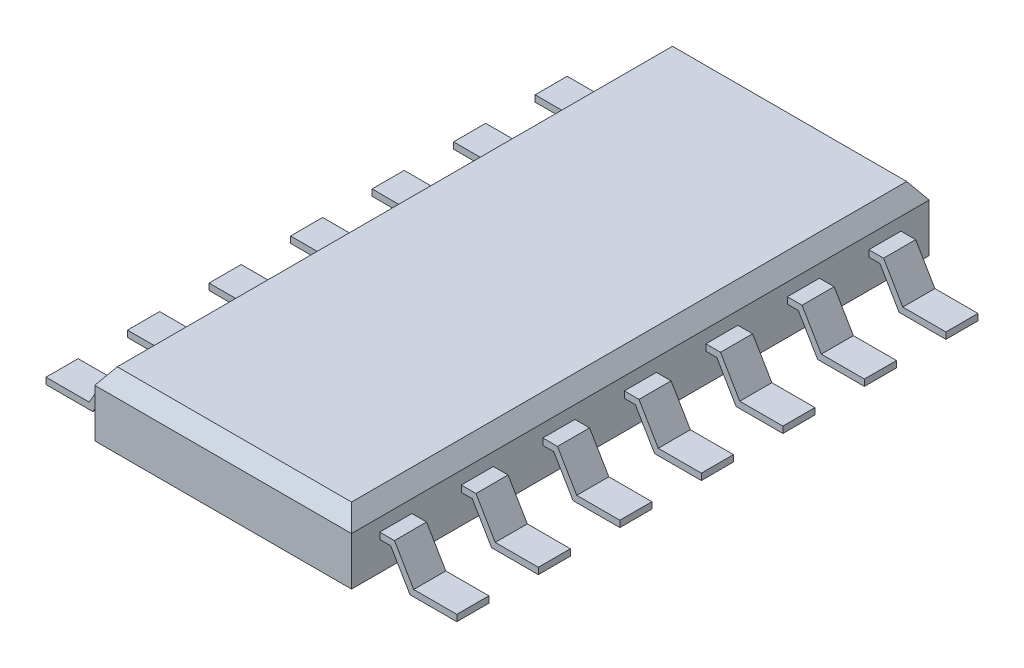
ISO-10303-21;
HEADER;
FILE_DESCRIPTION(('STEP AP214'),'2;1');
FILE_NAME('part.step','',(''),(''),'','','');
FILE_SCHEMA(('AUTOMOTIVE_DESIGN { 1 0 10303 214 1 1 1 1 }'));
ENDSEC;
DATA;
#1=APPLICATION_CONTEXT('core data for automotive mechanical design processes');
#2=APPLICATION_PROTOCOL_DEFINITION('international standard','automotive_design',2000,#1);
#3=PRODUCT_CONTEXT('',#1,'mechanical');
#4=PRODUCT('Part','Part','',(#3));
#5=PRODUCT_RELATED_PRODUCT_CATEGORY('part','',(#4));
#6=PRODUCT_DEFINITION_FORMATION('','',#4);
#7=PRODUCT_DEFINITION_CONTEXT('part definition',#1,'design');
#8=PRODUCT_DEFINITION('design','',#6,#7);
#9=PRODUCT_DEFINITION_SHAPE('','',#8);
#10=(LENGTH_UNIT() NAMED_UNIT(*) SI_UNIT(.MILLI.,.METRE.));
#11=(NAMED_UNIT(*) PLANE_ANGLE_UNIT() SI_UNIT($,.RADIAN.));
#12=(NAMED_UNIT(*) SI_UNIT($,.STERADIAN.) SOLID_ANGLE_UNIT());
#13=UNCERTAINTY_MEASURE_WITH_UNIT(LENGTH_MEASURE(1.E-05),#10,'distance_accuracy_value','');
#14=(GEOMETRIC_REPRESENTATION_CONTEXT(3) GLOBAL_UNCERTAINTY_ASSIGNED_CONTEXT((#13)) GLOBAL_UNIT_ASSIGNED_CONTEXT((#10,
#11,#12)) REPRESENTATION_CONTEXT('',''));
#15=CARTESIAN_POINT('',(0.,0.,0.));
#16=DIRECTION('',(0.,0.,1.));
#17=DIRECTION('',(1.,0.,0.));
#18=AXIS2_PLACEMENT_3D('',#15,#16,#17);
#19=CARTESIAN_POINT('',(2.,0.5,-4.49984359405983));
#20=DIRECTION('',(-1.,0.,0.));
#21=DIRECTION('',(0.,0.,1.));
#22=AXIS2_PLACEMENT_3D('',#19,#20,#21);
#23=PLANE('',#22);
#24=DIRECTION('',(0.,-1.,0.));
#25=VECTOR('',#24,1.);
#26=CARTESIAN_POINT('',(1.99999999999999,0.0499999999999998,-2.29));
#27=LINE('',#26,#25);
#28=CARTESIAN_POINT('',(1.99999999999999,0.0499999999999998,-2.29));
#29=VERTEX_POINT('',#28);
#30=CARTESIAN_POINT('',(1.99999999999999,-0.0500000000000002,-2.29));
#31=VERTEX_POINT('',#30);
#32=EDGE_CURVE('E843',#29,#31,#27,.T.);
#33=ORIENTED_EDGE('',*,*,#32,.F.);
#34=DIRECTION('',(0.,0.,-1.));
#35=VECTOR('',#34,1.);
#36=CARTESIAN_POINT('',(1.99999999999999,0.0499999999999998,-2.29));
#37=LINE('',#36,#35);
#38=CARTESIAN_POINT('',(1.99999999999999,0.0499999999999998,-2.79));
#39=VERTEX_POINT('',#38);
#40=EDGE_CURVE('E884',#29,#39,#37,.T.);
#41=ORIENTED_EDGE('',*,*,#40,.T.);
#42=DIRECTION('',(0.,-1.,0.));
#43=VECTOR('',#42,1.);
#44=CARTESIAN_POINT('',(1.99999999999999,0.0499999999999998,-2.79));
#45=LINE('',#44,#43);
#46=CARTESIAN_POINT('',(2.,-0.0500000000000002,-2.79));
#47=VERTEX_POINT('',#46);
#48=EDGE_CURVE('E862',#39,#47,#45,.T.);
#49=ORIENTED_EDGE('',*,*,#48,.T.);
#50=DIRECTION('',(0.,0.,-1.));
#51=VECTOR('',#50,1.);
#52=CARTESIAN_POINT('',(1.99999999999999,-0.0500000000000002,-2.29));
#53=LINE('',#52,#51);
#54=EDGE_CURVE('E882',#31,#47,#53,.T.);
#55=ORIENTED_EDGE('',*,*,#54,.F.);
#56=EDGE_LOOP('',(#33,#41,#49,#55));
#57=FACE_BOUND('',#56,.T.);
#58=DIRECTION('',(0.,-1.,0.));
#59=VECTOR('',#58,1.);
#60=CARTESIAN_POINT('',(1.99999999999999,0.0499999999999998,4.06));
#61=LINE('',#60,#59);
#62=CARTESIAN_POINT('',(1.99999999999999,0.0499999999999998,4.06));
#63=VERTEX_POINT('',#62);
#64=CARTESIAN_POINT('',(1.99999999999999,-0.0500000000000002,4.06));
#65=VERTEX_POINT('',#64);
#66=EDGE_CURVE('E963',#63,#65,#61,.T.);
#67=ORIENTED_EDGE('',*,*,#66,.F.);
#68=DIRECTION('',(0.,0.,-1.));
#69=VECTOR('',#68,1.);
#70=CARTESIAN_POINT('',(1.99999999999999,0.0499999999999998,4.06));
#71=LINE('',#70,#69);
#72=CARTESIAN_POINT('',(1.99999999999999,0.0499999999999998,3.56));
#73=VERTEX_POINT('',#72);
#74=EDGE_CURVE('E1006',#63,#73,#71,.T.);
#75=ORIENTED_EDGE('',*,*,#74,.T.);
#76=DIRECTION('',(0.,-1.,0.));
#77=VECTOR('',#76,1.);
#78=CARTESIAN_POINT('',(1.99999999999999,0.0499999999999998,3.56));
#79=LINE('',#78,#77);
#80=CARTESIAN_POINT('',(2.,-0.0500000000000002,3.56));
#81=VERTEX_POINT('',#80);
#82=EDGE_CURVE('E982',#73,#81,#79,.T.);
#83=ORIENTED_EDGE('',*,*,#82,.T.);
#84=DIRECTION('',(0.,0.,-1.));
#85=VECTOR('',#84,1.);
#86=CARTESIAN_POINT('',(1.99999999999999,-0.0500000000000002,4.06));
#87=LINE('',#86,#85);
#88=EDGE_CURVE('E1003',#65,#81,#87,.T.);
#89=ORIENTED_EDGE('',*,*,#88,.F.);
#90=EDGE_LOOP('',(#67,#75,#83,#89));
#91=FACE_BOUND('',#90,.T.);
#92=DIRECTION('',(0.,-1.,0.));
#93=VECTOR('',#92,1.);
#94=CARTESIAN_POINT('',(1.99999999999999,0.0499999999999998,1.52));
#95=LINE('',#94,#93);
#96=CARTESIAN_POINT('',(1.99999999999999,0.0499999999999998,1.52));
#97=VERTEX_POINT('',#96);
#98=CARTESIAN_POINT('',(1.99999999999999,-0.0500000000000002,1.52));
#99=VERTEX_POINT('',#98);
#100=EDGE_CURVE('E1085',#97,#99,#95,.T.);
#101=ORIENTED_EDGE('',*,*,#100,.F.);
#102=DIRECTION('',(0.,0.,-1.));
#103=VECTOR('',#102,1.);
#104=CARTESIAN_POINT('',(1.99999999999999,0.0499999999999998,1.52));
#105=LINE('',#104,#103);
#106=CARTESIAN_POINT('',(1.99999999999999,0.0499999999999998,1.02));
#107=VERTEX_POINT('',#106);
#108=EDGE_CURVE('E1128',#97,#107,#105,.T.);
#109=ORIENTED_EDGE('',*,*,#108,.T.);
#110=DIRECTION('',(0.,-1.,0.));
#111=VECTOR('',#110,1.);
#112=CARTESIAN_POINT('',(1.99999999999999,0.0499999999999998,1.02));
#113=LINE('',#112,#111);
#114=CARTESIAN_POINT('',(2.,-0.0500000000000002,1.02));
#115=VERTEX_POINT('',#114);
#116=EDGE_CURVE('E1104',#107,#115,#113,.T.);
#117=ORIENTED_EDGE('',*,*,#116,.T.);
#118=DIRECTION('',(0.,0.,-1.));
#119=VECTOR('',#118,1.);
#120=CARTESIAN_POINT('',(1.99999999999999,-0.0500000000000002,1.52));
#121=LINE('',#120,#119);
#122=EDGE_CURVE('E1125',#99,#115,#121,.T.);
#123=ORIENTED_EDGE('',*,*,#122,.F.);
#124=EDGE_LOOP('',(#101,#109,#117,#123));
#125=FACE_BOUND('',#124,.T.);
#126=DIRECTION('',(0.,-1.,0.));
#127=VECTOR('',#126,1.);
#128=CARTESIAN_POINT('',(2.,0.5,-4.49984359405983));
#129=LINE('',#128,#127);
#130=CARTESIAN_POINT('',(2.,0.249999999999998,-4.49984359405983));
#131=VERTEX_POINT('',#130);
#132=CARTESIAN_POINT('',(2.,-0.5,-4.49984359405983));
#133=VERTEX_POINT('',#132);
#134=EDGE_CURVE('E1652',#131,#133,#129,.T.);
#135=ORIENTED_EDGE('',*,*,#134,.F.);
#136=DIRECTION('',(0.,0.,1.));
#137=VECTOR('',#136,1.);
#138=CARTESIAN_POINT('',(2.,0.249999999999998,4.49984359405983));
#139=LINE('',#138,#137);
#140=CARTESIAN_POINT('',(2.,0.249999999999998,4.49984359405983));
#141=VERTEX_POINT('',#140);
#142=EDGE_CURVE('E1670',#131,#141,#139,.T.);
#143=ORIENTED_EDGE('',*,*,#142,.T.);
#144=DIRECTION('',(0.,-1.,0.));
#145=VECTOR('',#144,1.);
#146=CARTESIAN_POINT('',(2.,0.5,4.49984359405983));
#147=LINE('',#146,#145);
#148=CARTESIAN_POINT('',(2.,-0.5,4.49984359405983));
#149=VERTEX_POINT('',#148);
#150=EDGE_CURVE('E1654',#141,#149,#147,.T.);
#151=ORIENTED_EDGE('',*,*,#150,.T.);
#152=DIRECTION('',(0.,0.,-1.));
#153=VECTOR('',#152,1.);
#154=CARTESIAN_POINT('',(2.,-0.5,-4.49984359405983));
#155=LINE('',#154,#153);
#156=EDGE_CURVE('E1644',#149,#133,#155,.T.);
#157=ORIENTED_EDGE('',*,*,#156,.T.);
#158=EDGE_LOOP('',(#135,#143,#151,#157));
#159=FACE_BOUND('',#158,.T.);
#160=DIRECTION('',(0.,-1.,0.));
#161=VECTOR('',#160,1.);
#162=CARTESIAN_POINT('',(1.99999999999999,0.0499999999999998,0.25));
#163=LINE('',#162,#161);
#164=CARTESIAN_POINT('',(1.99999999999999,0.0499999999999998,0.25));
#165=VERTEX_POINT('',#164);
#166=CARTESIAN_POINT('',(1.99999999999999,-0.0500000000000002,0.25));
#167=VERTEX_POINT('',#166);
#168=EDGE_CURVE('E1146',#165,#167,#163,.T.);
#169=ORIENTED_EDGE('',*,*,#168,.F.);
#170=DIRECTION('',(0.,0.,-1.));
#171=VECTOR('',#170,1.);
#172=CARTESIAN_POINT('',(1.99999999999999,0.0499999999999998,0.25));
#173=LINE('',#172,#171);
#174=CARTESIAN_POINT('',(1.99999999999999,0.0499999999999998,-0.25));
#175=VERTEX_POINT('',#174);
#176=EDGE_CURVE('E1189',#165,#175,#173,.T.);
#177=ORIENTED_EDGE('',*,*,#176,.T.);
#178=DIRECTION('',(0.,-1.,0.));
#179=VECTOR('',#178,1.);
#180=CARTESIAN_POINT('',(1.99999999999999,0.0499999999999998,-0.25));
#181=LINE('',#180,#179);
#182=CARTESIAN_POINT('',(2.,-0.0500000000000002,-0.25));
#183=VERTEX_POINT('',#182);
#184=EDGE_CURVE('E1165',#175,#183,#181,.T.);
#185=ORIENTED_EDGE('',*,*,#184,.T.);
#186=DIRECTION('',(0.,0.,-1.));
#187=VECTOR('',#186,1.);
#188=CARTESIAN_POINT('',(1.99999999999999,-0.0500000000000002,0.25));
#189=LINE('',#188,#187);
#190=EDGE_CURVE('E1186',#167,#183,#189,.T.);
#191=ORIENTED_EDGE('',*,*,#190,.F.);
#192=EDGE_LOOP('',(#169,#177,#185,#191));
#193=FACE_BOUND('',#192,.T.);
#194=DIRECTION('',(0.,-1.,0.));
#195=VECTOR('',#194,1.);
#196=CARTESIAN_POINT('',(1.99999999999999,0.0499999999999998,2.79));
#197=LINE('',#196,#195);
#198=CARTESIAN_POINT('',(1.99999999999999,0.0499999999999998,2.79));
#199=VERTEX_POINT('',#198);
#200=CARTESIAN_POINT('',(1.99999999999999,-0.0500000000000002,2.79));
#201=VERTEX_POINT('',#200);
#202=EDGE_CURVE('E1024',#199,#201,#197,.T.);
#203=ORIENTED_EDGE('',*,*,#202,.F.);
#204=DIRECTION('',(0.,0.,-1.));
#205=VECTOR('',#204,1.);
#206=CARTESIAN_POINT('',(1.99999999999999,0.0499999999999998,2.79));
#207=LINE('',#206,#205);
#208=CARTESIAN_POINT('',(1.99999999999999,0.0499999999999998,2.29));
#209=VERTEX_POINT('',#208);
#210=EDGE_CURVE('E1067',#199,#209,#207,.T.);
#211=ORIENTED_EDGE('',*,*,#210,.T.);
#212=DIRECTION('',(0.,-1.,0.));
#213=VECTOR('',#212,1.);
#214=CARTESIAN_POINT('',(1.99999999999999,0.0499999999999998,2.29));
#215=LINE('',#214,#213);
#216=CARTESIAN_POINT('',(2.,-0.0500000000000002,2.29));
#217=VERTEX_POINT('',#216);
#218=EDGE_CURVE('E1043',#209,#217,#215,.T.);
#219=ORIENTED_EDGE('',*,*,#218,.T.);
#220=DIRECTION('',(0.,0.,-1.));
#221=VECTOR('',#220,1.);
#222=CARTESIAN_POINT('',(1.99999999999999,-0.0500000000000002,2.79));
#223=LINE('',#222,#221);
#224=EDGE_CURVE('E1064',#201,#217,#223,.T.);
#225=ORIENTED_EDGE('',*,*,#224,.F.);
#226=EDGE_LOOP('',(#203,#211,#219,#225));
#227=FACE_BOUND('',#226,.T.);
#228=DIRECTION('',(0.,-1.,0.));
#229=VECTOR('',#228,1.);
#230=CARTESIAN_POINT('',(1.99999999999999,0.0499999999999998,-1.02));
#231=LINE('',#230,#229);
#232=CARTESIAN_POINT('',(1.99999999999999,0.0499999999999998,-1.02));
#233=VERTEX_POINT('',#232);
#234=CARTESIAN_POINT('',(1.99999999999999,-0.0500000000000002,-1.02));
#235=VERTEX_POINT('',#234);
#236=EDGE_CURVE('E902',#233,#235,#231,.T.);
#237=ORIENTED_EDGE('',*,*,#236,.F.);
#238=DIRECTION('',(0.,0.,-1.));
#239=VECTOR('',#238,1.);
#240=CARTESIAN_POINT('',(1.99999999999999,0.0499999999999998,-1.02));
#241=LINE('',#240,#239);
#242=CARTESIAN_POINT('',(1.99999999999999,0.0499999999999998,-1.52));
#243=VERTEX_POINT('',#242);
#244=EDGE_CURVE('E945',#233,#243,#241,.T.);
#245=ORIENTED_EDGE('',*,*,#244,.T.);
#246=DIRECTION('',(0.,-1.,0.));
#247=VECTOR('',#246,1.);
#248=CARTESIAN_POINT('',(1.99999999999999,0.0499999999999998,-1.52));
#249=LINE('',#248,#247);
#250=CARTESIAN_POINT('',(2.,-0.0500000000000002,-1.52));
#251=VERTEX_POINT('',#250);
#252=EDGE_CURVE('E921',#243,#251,#249,.T.);
#253=ORIENTED_EDGE('',*,*,#252,.T.);
#254=DIRECTION('',(0.,0.,-1.));
#255=VECTOR('',#254,1.);
#256=CARTESIAN_POINT('',(1.99999999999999,-0.0500000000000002,-1.02));
#257=LINE('',#256,#255);
#258=EDGE_CURVE('E942',#235,#251,#257,.T.);
#259=ORIENTED_EDGE('',*,*,#258,.F.);
#260=EDGE_LOOP('',(#237,#245,#253,#259));
#261=FACE_BOUND('',#260,.T.);
#262=DIRECTION('',(0.,-1.,0.));
#263=VECTOR('',#262,1.);
#264=CARTESIAN_POINT('',(1.99999999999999,0.0499999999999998,-3.56));
#265=LINE('',#264,#263);
#266=CARTESIAN_POINT('',(1.99999999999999,0.0499999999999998,-3.56));
#267=VERTEX_POINT('',#266);
#268=CARTESIAN_POINT('',(1.99999999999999,-0.0500000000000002,-3.56));
#269=VERTEX_POINT('',#268);
#270=EDGE_CURVE('E789',#267,#269,#265,.T.);
#271=ORIENTED_EDGE('',*,*,#270,.F.);
#272=DIRECTION('',(0.,0.,-1.));
#273=VECTOR('',#272,1.);
#274=CARTESIAN_POINT('',(1.99999999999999,0.0499999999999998,-3.56));
#275=LINE('',#274,#273);
#276=CARTESIAN_POINT('',(1.99999999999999,0.0499999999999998,-4.06));
#277=VERTEX_POINT('',#276);
#278=EDGE_CURVE('E829',#267,#277,#275,.T.);
#279=ORIENTED_EDGE('',*,*,#278,.T.);
#280=DIRECTION('',(0.,-1.,0.));
#281=VECTOR('',#280,1.);
#282=CARTESIAN_POINT('',(1.99999999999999,0.0499999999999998,-4.06));
#283=LINE('',#282,#281);
#284=CARTESIAN_POINT('',(2.,-0.0500000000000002,-4.06));
#285=VERTEX_POINT('',#284);
#286=EDGE_CURVE('E807',#277,#285,#283,.T.);
#287=ORIENTED_EDGE('',*,*,#286,.T.);
#288=DIRECTION('',(0.,0.,-1.));
#289=VECTOR('',#288,1.);
#290=CARTESIAN_POINT('',(1.99999999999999,-0.0500000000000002,-3.56));
#291=LINE('',#290,#289);
#292=EDGE_CURVE('E827',#269,#285,#291,.T.);
#293=ORIENTED_EDGE('',*,*,#292,.F.);
#294=EDGE_LOOP('',(#271,#279,#287,#293));
#295=FACE_BOUND('',#294,.T.);
#296=ADVANCED_FACE('F36',(#57,#91,#125,#159,#193,#227,#261,#295),#23,.F.);
#297=CARTESIAN_POINT('',(-2.,0.5,-4.49984359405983));
#298=DIRECTION('',(1.,0.,0.));
#299=DIRECTION('',(0.,0.,-1.));
#300=AXIS2_PLACEMENT_3D('',#297,#298,#299);
#301=PLANE('',#300);
#302=DIRECTION('',(0.,-1.,0.));
#303=VECTOR('',#302,1.);
#304=CARTESIAN_POINT('',(-1.99999999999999,0.0499999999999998,-2.29));
#305=LINE('',#304,#303);
#306=CARTESIAN_POINT('',(-1.99999999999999,0.0499999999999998,-2.29));
#307=VERTEX_POINT('',#306);
#308=CARTESIAN_POINT('',(-1.99999999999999,-0.0500000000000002,-2.29));
#309=VERTEX_POINT('',#308);
#310=EDGE_CURVE('E1275',#307,#309,#305,.T.);
#311=ORIENTED_EDGE('',*,*,#310,.T.);
#312=DIRECTION('',(0.,0.,-1.));
#313=VECTOR('',#312,1.);
#314=CARTESIAN_POINT('',(-1.99999999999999,-0.0500000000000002,-2.29));
#315=LINE('',#314,#313);
#316=CARTESIAN_POINT('',(-1.99999999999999,-0.0500000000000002,-2.79));
#317=VERTEX_POINT('',#316);
#318=EDGE_CURVE('E1311',#309,#317,#315,.T.);
#319=ORIENTED_EDGE('',*,*,#318,.T.);
#320=DIRECTION('',(0.,-1.,0.));
#321=VECTOR('',#320,1.);
#322=CARTESIAN_POINT('',(-1.99999999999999,0.0499999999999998,-2.79));
#323=LINE('',#322,#321);
#324=CARTESIAN_POINT('',(-2.,0.0499999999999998,-2.79));
#325=VERTEX_POINT('',#324);
#326=EDGE_CURVE('E1297',#325,#317,#323,.T.);
#327=ORIENTED_EDGE('',*,*,#326,.F.);
#328=DIRECTION('',(0.,0.,-1.));
#329=VECTOR('',#328,1.);
#330=CARTESIAN_POINT('',(-1.99999999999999,0.0499999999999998,-2.29));
#331=LINE('',#330,#329);
#332=EDGE_CURVE('E1308',#307,#325,#331,.T.);
#333=ORIENTED_EDGE('',*,*,#332,.F.);
#334=EDGE_LOOP('',(#311,#319,#327,#333));
#335=FACE_BOUND('',#334,.T.);
#336=DIRECTION('',(0.,-1.,0.));
#337=VECTOR('',#336,1.);
#338=CARTESIAN_POINT('',(-1.99999999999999,0.0499999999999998,4.06));
#339=LINE('',#338,#337);
#340=CARTESIAN_POINT('',(-1.99999999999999,0.0499999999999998,4.06));
#341=VERTEX_POINT('',#340);
#342=CARTESIAN_POINT('',(-1.99999999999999,-0.0500000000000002,4.06));
#343=VERTEX_POINT('',#342);
#344=EDGE_CURVE('E1401',#341,#343,#339,.T.);
#345=ORIENTED_EDGE('',*,*,#344,.T.);
#346=DIRECTION('',(0.,0.,-1.));
#347=VECTOR('',#346,1.);
#348=CARTESIAN_POINT('',(-1.99999999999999,-0.0500000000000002,4.06));
#349=LINE('',#348,#347);
#350=CARTESIAN_POINT('',(-1.99999999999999,-0.0500000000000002,3.56));
#351=VERTEX_POINT('',#350);
#352=EDGE_CURVE('E1437',#343,#351,#349,.T.);
#353=ORIENTED_EDGE('',*,*,#352,.T.);
#354=DIRECTION('',(0.,-1.,0.));
#355=VECTOR('',#354,1.);
#356=CARTESIAN_POINT('',(-1.99999999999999,0.0499999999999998,3.56));
#357=LINE('',#356,#355);
#358=CARTESIAN_POINT('',(-2.,0.0499999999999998,3.56));
#359=VERTEX_POINT('',#358);
#360=EDGE_CURVE('E1423',#359,#351,#357,.T.);
#361=ORIENTED_EDGE('',*,*,#360,.F.);
#362=DIRECTION('',(0.,0.,-1.));
#363=VECTOR('',#362,1.);
#364=CARTESIAN_POINT('',(-1.99999999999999,0.0499999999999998,4.06));
#365=LINE('',#364,#363);
#366=EDGE_CURVE('E1434',#341,#359,#365,.T.);
#367=ORIENTED_EDGE('',*,*,#366,.F.);
#368=EDGE_LOOP('',(#345,#353,#361,#367));
#369=FACE_BOUND('',#368,.T.);
#370=DIRECTION('',(0.,-1.,0.));
#371=VECTOR('',#370,1.);
#372=CARTESIAN_POINT('',(-1.99999999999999,0.0499999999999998,1.52));
#373=LINE('',#372,#371);
#374=CARTESIAN_POINT('',(-1.99999999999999,0.0499999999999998,1.52));
#375=VERTEX_POINT('',#374);
#376=CARTESIAN_POINT('',(-1.99999999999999,-0.0500000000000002,1.52));
#377=VERTEX_POINT('',#376);
#378=EDGE_CURVE('E1527',#375,#377,#373,.T.);
#379=ORIENTED_EDGE('',*,*,#378,.T.);
#380=DIRECTION('',(0.,0.,-1.));
#381=VECTOR('',#380,1.);
#382=CARTESIAN_POINT('',(-1.99999999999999,-0.0500000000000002,1.52));
#383=LINE('',#382,#381);
#384=CARTESIAN_POINT('',(-1.99999999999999,-0.0500000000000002,1.02));
#385=VERTEX_POINT('',#384);
#386=EDGE_CURVE('E1563',#377,#385,#383,.T.);
#387=ORIENTED_EDGE('',*,*,#386,.T.);
#388=DIRECTION('',(0.,-1.,0.));
#389=VECTOR('',#388,1.);
#390=CARTESIAN_POINT('',(-1.99999999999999,0.0499999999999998,1.02));
#391=LINE('',#390,#389);
#392=CARTESIAN_POINT('',(-2.,0.0499999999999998,1.02));
#393=VERTEX_POINT('',#392);
#394=EDGE_CURVE('E1549',#393,#385,#391,.T.);
#395=ORIENTED_EDGE('',*,*,#394,.F.);
#396=DIRECTION('',(0.,0.,-1.));
#397=VECTOR('',#396,1.);
#398=CARTESIAN_POINT('',(-1.99999999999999,0.0499999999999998,1.52));
#399=LINE('',#398,#397);
#400=EDGE_CURVE('E1560',#375,#393,#399,.T.);
#401=ORIENTED_EDGE('',*,*,#400,.F.);
#402=EDGE_LOOP('',(#379,#387,#395,#401));
#403=FACE_BOUND('',#402,.T.);
#404=DIRECTION('',(0.,-1.,0.));
#405=VECTOR('',#404,1.);
#406=CARTESIAN_POINT('',(-2.,0.5,4.49984359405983));
#407=LINE('',#406,#405);
#408=CARTESIAN_POINT('',(-2.,0.249999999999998,4.49984359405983));
#409=VERTEX_POINT('',#408);
#410=CARTESIAN_POINT('',(-2.,-0.5,4.49984359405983));
#411=VERTEX_POINT('',#410);
#412=EDGE_CURVE('E1656',#409,#411,#407,.T.);
#413=ORIENTED_EDGE('',*,*,#412,.F.);
#414=DIRECTION('',(0.,0.,-1.));
#415=VECTOR('',#414,1.);
#416=CARTESIAN_POINT('',(-2.,0.249999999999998,-4.49984359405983));
#417=LINE('',#416,#415);
#418=CARTESIAN_POINT('',(-2.,0.249999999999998,-4.49984359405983));
#419=VERTEX_POINT('',#418);
#420=EDGE_CURVE('E11',#409,#419,#417,.T.);
#421=ORIENTED_EDGE('',*,*,#420,.T.);
#422=DIRECTION('',(0.,-1.,0.));
#423=VECTOR('',#422,1.);
#424=CARTESIAN_POINT('',(-2.,0.5,-4.49984359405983));
#425=LINE('',#424,#423);
#426=CARTESIAN_POINT('',(-2.,-0.5,-4.49984359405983));
#427=VERTEX_POINT('',#426);
#428=EDGE_CURVE('E1650',#419,#427,#425,.T.);
#429=ORIENTED_EDGE('',*,*,#428,.T.);
#430=DIRECTION('',(0.,0.,1.));
#431=VECTOR('',#430,1.);
#432=CARTESIAN_POINT('',(-2.,-0.5,-4.49984359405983));
#433=LINE('',#432,#431);
#434=EDGE_CURVE('E1638',#427,#411,#433,.T.);
#435=ORIENTED_EDGE('',*,*,#434,.T.);
#436=EDGE_LOOP('',(#413,#421,#429,#435));
#437=FACE_BOUND('',#436,.T.);
#438=DIRECTION('',(0.,-1.,0.));
#439=VECTOR('',#438,1.);
#440=CARTESIAN_POINT('',(-1.99999999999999,0.0499999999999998,0.25));
#441=LINE('',#440,#439);
#442=CARTESIAN_POINT('',(-1.99999999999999,0.0499999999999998,0.25));
#443=VERTEX_POINT('',#442);
#444=CARTESIAN_POINT('',(-1.99999999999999,-0.0500000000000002,0.25));
#445=VERTEX_POINT('',#444);
#446=EDGE_CURVE('E1590',#443,#445,#441,.T.);
#447=ORIENTED_EDGE('',*,*,#446,.T.);
#448=DIRECTION('',(0.,0.,-1.));
#449=VECTOR('',#448,1.);
#450=CARTESIAN_POINT('',(-1.99999999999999,-0.0500000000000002,0.25));
#451=LINE('',#450,#449);
#452=CARTESIAN_POINT('',(-1.99999999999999,-0.0500000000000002,-0.25));
#453=VERTEX_POINT('',#452);
#454=EDGE_CURVE('E1626',#445,#453,#451,.T.);
#455=ORIENTED_EDGE('',*,*,#454,.T.);
#456=DIRECTION('',(0.,-1.,0.));
#457=VECTOR('',#456,1.);
#458=CARTESIAN_POINT('',(-1.99999999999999,0.0499999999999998,-0.25));
#459=LINE('',#458,#457);
#460=CARTESIAN_POINT('',(-2.,0.0499999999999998,-0.25));
#461=VERTEX_POINT('',#460);
#462=EDGE_CURVE('E1612',#461,#453,#459,.T.);
#463=ORIENTED_EDGE('',*,*,#462,.F.);
#464=DIRECTION('',(0.,0.,-1.));
#465=VECTOR('',#464,1.);
#466=CARTESIAN_POINT('',(-1.99999999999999,0.0499999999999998,0.25));
#467=LINE('',#466,#465);
#468=EDGE_CURVE('E1623',#443,#461,#467,.T.);
#469=ORIENTED_EDGE('',*,*,#468,.F.);
#470=EDGE_LOOP('',(#447,#455,#463,#469));
#471=FACE_BOUND('',#470,.T.);
#472=DIRECTION('',(0.,-1.,0.));
#473=VECTOR('',#472,1.);
#474=CARTESIAN_POINT('',(-1.99999999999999,0.0499999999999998,2.79));
#475=LINE('',#474,#473);
#476=CARTESIAN_POINT('',(-1.99999999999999,0.0499999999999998,2.79));
#477=VERTEX_POINT('',#476);
#478=CARTESIAN_POINT('',(-1.99999999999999,-0.0500000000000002,2.79));
#479=VERTEX_POINT('',#478);
#480=EDGE_CURVE('E1464',#477,#479,#475,.T.);
#481=ORIENTED_EDGE('',*,*,#480,.T.);
#482=DIRECTION('',(0.,0.,-1.));
#483=VECTOR('',#482,1.);
#484=CARTESIAN_POINT('',(-1.99999999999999,-0.0500000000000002,2.79));
#485=LINE('',#484,#483);
#486=CARTESIAN_POINT('',(-1.99999999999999,-0.0500000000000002,2.29));
#487=VERTEX_POINT('',#486);
#488=EDGE_CURVE('E1500',#479,#487,#485,.T.);
#489=ORIENTED_EDGE('',*,*,#488,.T.);
#490=DIRECTION('',(0.,-1.,0.));
#491=VECTOR('',#490,1.);
#492=CARTESIAN_POINT('',(-1.99999999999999,0.0499999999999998,2.29));
#493=LINE('',#492,#491);
#494=CARTESIAN_POINT('',(-2.,0.0499999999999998,2.29));
#495=VERTEX_POINT('',#494);
#496=EDGE_CURVE('E1486',#495,#487,#493,.T.);
#497=ORIENTED_EDGE('',*,*,#496,.F.);
#498=DIRECTION('',(0.,0.,-1.));
#499=VECTOR('',#498,1.);
#500=CARTESIAN_POINT('',(-1.99999999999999,0.0499999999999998,2.79));
#501=LINE('',#500,#499);
#502=EDGE_CURVE('E1497',#477,#495,#501,.T.);
#503=ORIENTED_EDGE('',*,*,#502,.F.);
#504=EDGE_LOOP('',(#481,#489,#497,#503));
#505=FACE_BOUND('',#504,.T.);
#506=DIRECTION('',(0.,-1.,0.));
#507=VECTOR('',#506,1.);
#508=CARTESIAN_POINT('',(-1.99999999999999,0.0499999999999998,-1.02));
#509=LINE('',#508,#507);
#510=CARTESIAN_POINT('',(-1.99999999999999,0.0499999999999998,-1.02));
#511=VERTEX_POINT('',#510);
#512=CARTESIAN_POINT('',(-1.99999999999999,-0.0500000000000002,-1.02));
#513=VERTEX_POINT('',#512);
#514=EDGE_CURVE('E1338',#511,#513,#509,.T.);
#515=ORIENTED_EDGE('',*,*,#514,.T.);
#516=DIRECTION('',(0.,0.,-1.));
#517=VECTOR('',#516,1.);
#518=CARTESIAN_POINT('',(-1.99999999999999,-0.0500000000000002,-1.02));
#519=LINE('',#518,#517);
#520=CARTESIAN_POINT('',(-1.99999999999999,-0.0500000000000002,-1.52));
#521=VERTEX_POINT('',#520);
#522=EDGE_CURVE('E1374',#513,#521,#519,.T.);
#523=ORIENTED_EDGE('',*,*,#522,.T.);
#524=DIRECTION('',(0.,-1.,0.));
#525=VECTOR('',#524,1.);
#526=CARTESIAN_POINT('',(-1.99999999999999,0.0499999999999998,-1.52));
#527=LINE('',#526,#525);
#528=CARTESIAN_POINT('',(-2.,0.0499999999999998,-1.52));
#529=VERTEX_POINT('',#528);
#530=EDGE_CURVE('E1360',#529,#521,#527,.T.);
#531=ORIENTED_EDGE('',*,*,#530,.F.);
#532=DIRECTION('',(0.,0.,-1.));
#533=VECTOR('',#532,1.);
#534=CARTESIAN_POINT('',(-1.99999999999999,0.0499999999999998,-1.02));
#535=LINE('',#534,#533);
#536=EDGE_CURVE('E1371',#511,#529,#535,.T.);
#537=ORIENTED_EDGE('',*,*,#536,.F.);
#538=EDGE_LOOP('',(#515,#523,#531,#537));
#539=FACE_BOUND('',#538,.T.);
#540=DIRECTION('',(0.,-1.,0.));
#541=VECTOR('',#540,1.);
#542=CARTESIAN_POINT('',(-1.99999999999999,0.0499999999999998,-3.56));
#543=LINE('',#542,#541);
#544=CARTESIAN_POINT('',(-1.99999999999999,0.0499999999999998,-3.56));
#545=VERTEX_POINT('',#544);
#546=CARTESIAN_POINT('',(-1.99999999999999,-0.0500000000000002,-3.56));
#547=VERTEX_POINT('',#546);
#548=EDGE_CURVE('E1212',#545,#547,#543,.T.);
#549=ORIENTED_EDGE('',*,*,#548,.T.);
#550=DIRECTION('',(0.,0.,-1.));
#551=VECTOR('',#550,1.);
#552=CARTESIAN_POINT('',(-1.99999999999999,-0.0500000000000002,-3.56));
#553=LINE('',#552,#551);
#554=CARTESIAN_POINT('',(-1.99999999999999,-0.0500000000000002,-4.06));
#555=VERTEX_POINT('',#554);
#556=EDGE_CURVE('E1248',#547,#555,#553,.T.);
#557=ORIENTED_EDGE('',*,*,#556,.T.);
#558=DIRECTION('',(0.,-1.,0.));
#559=VECTOR('',#558,1.);
#560=CARTESIAN_POINT('',(-1.99999999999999,0.0499999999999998,-4.06));
#561=LINE('',#560,#559);
#562=CARTESIAN_POINT('',(-2.,0.0499999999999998,-4.06));
#563=VERTEX_POINT('',#562);
#564=EDGE_CURVE('E1234',#563,#555,#561,.T.);
#565=ORIENTED_EDGE('',*,*,#564,.F.);
#566=DIRECTION('',(0.,0.,-1.));
#567=VECTOR('',#566,1.);
#568=CARTESIAN_POINT('',(-1.99999999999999,0.0499999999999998,-3.56));
#569=LINE('',#568,#567);
#570=EDGE_CURVE('E1245',#545,#563,#569,.T.);
#571=ORIENTED_EDGE('',*,*,#570,.F.);
#572=EDGE_LOOP('',(#549,#557,#565,#571));
#573=FACE_BOUND('',#572,.T.);
#574=ADVANCED_FACE('F1697',(#335,#369,#403,#437,#471,#505,#539,#573),#301,.F.);
#575=CARTESIAN_POINT('',(-2.,0.5,4.49984359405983));
#576=DIRECTION('',(0.,0.,-1.));
#577=DIRECTION('',(-1.,0.,0.));
#578=AXIS2_PLACEMENT_3D('',#575,#576,#577);
#579=PLANE('',#578);
#580=ORIENTED_EDGE('',*,*,#150,.F.);
#581=DIRECTION('',(-1.,0.,0.));
#582=VECTOR('',#581,1.);
#583=CARTESIAN_POINT('',(-2.,0.249999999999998,4.49984359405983));
#584=LINE('',#583,#582);
#585=EDGE_CURVE('E45',#141,#409,#584,.T.);
#586=ORIENTED_EDGE('',*,*,#585,.T.);
#587=ORIENTED_EDGE('',*,*,#412,.T.);
#588=DIRECTION('',(1.,0.,0.));
#589=VECTOR('',#588,1.);
#590=CARTESIAN_POINT('',(-2.,-0.5,4.49984359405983));
#591=LINE('',#590,#589);
#592=EDGE_CURVE('E1641',#411,#149,#591,.T.);
#593=ORIENTED_EDGE('',*,*,#592,.T.);
#594=EDGE_LOOP('',(#580,#586,#587,#593));
#595=FACE_BOUND('',#594,.T.);
#596=ADVANCED_FACE('F1694',(#595),#579,.F.);
#597=CARTESIAN_POINT('',(-2.,0.5,-4.49984359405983));
#598=DIRECTION('',(0.,0.,1.));
#599=DIRECTION('',(1.,0.,0.));
#600=AXIS2_PLACEMENT_3D('',#597,#598,#599);
#601=PLANE('',#600);
#602=ORIENTED_EDGE('',*,*,#428,.F.);
#603=DIRECTION('',(1.,0.,0.));
#604=VECTOR('',#603,1.);
#605=CARTESIAN_POINT('',(2.,0.249999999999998,-4.49984359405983));
#606=LINE('',#605,#604);
#607=EDGE_CURVE('E1667',#419,#131,#606,.T.);
#608=ORIENTED_EDGE('',*,*,#607,.T.);
#609=ORIENTED_EDGE('',*,*,#134,.T.);
#610=DIRECTION('',(-1.,0.,0.));
#611=VECTOR('',#610,1.);
#612=CARTESIAN_POINT('',(-2.,-0.5,-4.49984359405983));
#613=LINE('',#612,#611);
#614=EDGE_CURVE('E1647',#133,#427,#613,.T.);
#615=ORIENTED_EDGE('',*,*,#614,.T.);
#616=EDGE_LOOP('',(#602,#608,#609,#615));
#617=FACE_BOUND('',#616,.T.);
#618=ADVANCED_FACE('F1709',(#617),#601,.F.);
#619=CARTESIAN_POINT('',(-2.,0.5,4.49984359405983));
#620=DIRECTION('',(0.,1.,0.));
#621=DIRECTION('',(0.,0.,1.));
#622=AXIS2_PLACEMENT_3D('',#619,#620,#621);
#623=PLANE('',#622);
#624=DIRECTION('',(0.,0.,-1.));
#625=VECTOR('',#624,1.);
#626=CARTESIAN_POINT('',(1.82494811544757,0.5,-4.49984359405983));
#627=LINE('',#626,#625);
#628=CARTESIAN_POINT('',(1.82494811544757,0.5,4.3247917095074));
#629=VERTEX_POINT('',#628);
#630=CARTESIAN_POINT('',(1.82494811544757,0.5,-4.3247917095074));
#631=VERTEX_POINT('',#630);
#632=EDGE_CURVE('E1662',#629,#631,#627,.T.);
#633=ORIENTED_EDGE('',*,*,#632,.T.);
#634=DIRECTION('',(-1.,0.,0.));
#635=VECTOR('',#634,1.);
#636=CARTESIAN_POINT('',(-2.,0.5,-4.3247917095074));
#637=LINE('',#636,#635);
#638=CARTESIAN_POINT('',(-1.82494811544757,0.5,-4.3247917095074));
#639=VERTEX_POINT('',#638);
#640=EDGE_CURVE('E1664',#631,#639,#637,.T.);
#641=ORIENTED_EDGE('',*,*,#640,.T.);
#642=DIRECTION('',(0.,0.,1.));
#643=VECTOR('',#642,1.);
#644=CARTESIAN_POINT('',(-1.82494811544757,0.5,4.49984359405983));
#645=LINE('',#644,#643);
#646=CARTESIAN_POINT('',(-1.82494811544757,0.5,4.3247917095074));
#647=VERTEX_POINT('',#646);
#648=EDGE_CURVE('E1658',#639,#647,#645,.T.);
#649=ORIENTED_EDGE('',*,*,#648,.T.);
#650=DIRECTION('',(1.,0.,0.));
#651=VECTOR('',#650,1.);
#652=CARTESIAN_POINT('',(2.,0.5,4.3247917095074));
#653=LINE('',#652,#651);
#654=EDGE_CURVE('E1660',#647,#629,#653,.T.);
#655=ORIENTED_EDGE('',*,*,#654,.T.);
#656=EDGE_LOOP('',(#633,#641,#649,#655));
#657=FACE_BOUND('',#656,.T.);
#658=ADVANCED_FACE('F1717',(#657),#623,.T.);
#659=CARTESIAN_POINT('',(-2.,-0.5,4.49984359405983));
#660=DIRECTION('',(0.,1.,0.));
#661=DIRECTION('',(0.,0.,1.));
#662=AXIS2_PLACEMENT_3D('',#659,#660,#661);
#663=PLANE('',#662);
#664=ORIENTED_EDGE('',*,*,#434,.F.);
#665=ORIENTED_EDGE('',*,*,#614,.F.);
#666=ORIENTED_EDGE('',*,*,#156,.F.);
#667=ORIENTED_EDGE('',*,*,#592,.F.);
#668=EDGE_LOOP('',(#664,#665,#666,#667));
#669=FACE_BOUND('',#668,.T.);
#670=ADVANCED_FACE('F1703',(#669),#663,.F.);
#671=CARTESIAN_POINT('',(-2.,0.5,4.3247917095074));
#672=DIRECTION('',(0.,0.573576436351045,0.819152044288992));
#673=DIRECTION('',(0.,-0.819152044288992,0.573576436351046));
#674=AXIS2_PLACEMENT_3D('',#671,#672,#673);
#675=PLANE('',#674);
#676=DIRECTION('',(0.497542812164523,0.71056477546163,-0.497542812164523));
#677=VECTOR('',#676,1.);
#678=CARTESIAN_POINT('',(-1.86828200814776,0.438112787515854,4.36812560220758));
#679=LINE('',#678,#677);
#680=EDGE_CURVE('E1675',#409,#647,#679,.T.);
#681=ORIENTED_EDGE('',*,*,#680,.F.);
#682=ORIENTED_EDGE('',*,*,#585,.F.);
#683=DIRECTION('',(-0.497542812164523,0.71056477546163,-0.497542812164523));
#684=VECTOR('',#683,1.);
#685=CARTESIAN_POINT('',(0.87808660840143,1.85225837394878,3.37793020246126));
#686=LINE('',#685,#684);
#687=EDGE_CURVE('E40',#629,#141,#686,.F.);
#688=ORIENTED_EDGE('',*,*,#687,.F.);
#689=ORIENTED_EDGE('',*,*,#654,.F.);
#690=EDGE_LOOP('',(#681,#682,#688,#689));
#691=FACE_BOUND('',#690,.T.);
#692=ADVANCED_FACE('F38',(#691),#675,.T.);
#693=CARTESIAN_POINT('',(1.82494811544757,0.5,4.49984359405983));
#694=DIRECTION('',(0.819152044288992,0.573576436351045,0.));
#695=DIRECTION('',(-0.573576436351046,0.819152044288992,0.));
#696=AXIS2_PLACEMENT_3D('',#693,#694,#695);
#697=PLANE('',#696);
#698=ORIENTED_EDGE('',*,*,#687,.T.);
#699=ORIENTED_EDGE('',*,*,#142,.F.);
#700=DIRECTION('',(-0.497542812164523,0.71056477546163,0.497542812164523));
#701=VECTOR('',#700,1.);
#702=CARTESIAN_POINT('',(-0.359580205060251,3.61982976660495,-2.14026338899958));
#703=LINE('',#702,#701);
#704=EDGE_CURVE('E1674',#631,#131,#703,.F.);
#705=ORIENTED_EDGE('',*,*,#704,.F.);
#706=ORIENTED_EDGE('',*,*,#632,.F.);
#707=EDGE_LOOP('',(#698,#699,#705,#706));
#708=FACE_BOUND('',#707,.T.);
#709=ADVANCED_FACE('F1686',(#708),#697,.T.);
#710=CARTESIAN_POINT('',(-1.82494811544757,0.5,4.49984359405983));
#711=DIRECTION('',(-0.819152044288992,0.573576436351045,0.));
#712=DIRECTION('',(-0.573576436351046,-0.819152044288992,0.));
#713=AXIS2_PLACEMENT_3D('',#710,#711,#712);
#714=PLANE('',#713);
#715=ORIENTED_EDGE('',*,*,#680,.T.);
#716=ORIENTED_EDGE('',*,*,#648,.F.);
#717=DIRECTION('',(-0.497542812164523,-0.71056477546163,-0.497542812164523));
#718=VECTOR('',#717,1.);
#719=CARTESIAN_POINT('',(0.359580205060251,3.61982976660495,-2.14026338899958));
#720=LINE('',#719,#718);
#721=EDGE_CURVE('E1637',#419,#639,#720,.F.);
#722=ORIENTED_EDGE('',*,*,#721,.F.);
#723=ORIENTED_EDGE('',*,*,#420,.F.);
#724=EDGE_LOOP('',(#715,#716,#722,#723));
#725=FACE_BOUND('',#724,.T.);
#726=ADVANCED_FACE('F1715',(#725),#714,.T.);
#727=CARTESIAN_POINT('',(-2.,0.5,-4.3247917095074));
#728=DIRECTION('',(0.,0.573576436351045,-0.819152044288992));
#729=DIRECTION('',(0.,0.819152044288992,0.573576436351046));
#730=AXIS2_PLACEMENT_3D('',#727,#728,#729);
#731=PLANE('',#730);
#732=ORIENTED_EDGE('',*,*,#704,.T.);
#733=ORIENTED_EDGE('',*,*,#607,.F.);
#734=ORIENTED_EDGE('',*,*,#721,.T.);
#735=ORIENTED_EDGE('',*,*,#640,.F.);
#736=EDGE_LOOP('',(#732,#733,#734,#735));
#737=FACE_BOUND('',#736,.T.);
#738=ADVANCED_FACE('F1713',(#737),#731,.T.);
#739=CARTESIAN_POINT('',(-2.49999999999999,-0.459999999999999,0.25));
#740=DIRECTION('',(0.,-1.,0.));
#741=DIRECTION('',(1.,0.,0.));
#742=AXIS2_PLACEMENT_3D('',#739,#740,#741);
#743=PLANE('',#742);
#744=DIRECTION('',(-1.,0.,0.));
#745=VECTOR('',#744,1.);
#746=CARTESIAN_POINT('',(-2.49999999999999,-0.459999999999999,-0.25));
#747=LINE('',#746,#745);
#748=CARTESIAN_POINT('',(-2.52859730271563,-0.459999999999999,-0.25));
#749=VERTEX_POINT('',#748);
#750=CARTESIAN_POINT('',(-3.19999999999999,-0.459999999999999,-0.25));
#751=VERTEX_POINT('',#750);
#752=EDGE_CURVE('E1574',#749,#751,#747,.T.);
#753=ORIENTED_EDGE('',*,*,#752,.T.);
#754=DIRECTION('',(0.,0.,-1.));
#755=VECTOR('',#754,1.);
#756=CARTESIAN_POINT('',(-3.19999999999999,-0.459999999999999,0.25));
#757=LINE('',#756,#755);
#758=CARTESIAN_POINT('',(-3.19999999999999,-0.459999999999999,0.25));
#759=VERTEX_POINT('',#758);
#760=EDGE_CURVE('E1635',#759,#751,#757,.T.);
#761=ORIENTED_EDGE('',*,*,#760,.F.);
#762=DIRECTION('',(-1.,0.,0.));
#763=VECTOR('',#762,1.);
#764=CARTESIAN_POINT('',(-2.49999999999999,-0.459999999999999,0.25));
#765=LINE('',#764,#763);
#766=CARTESIAN_POINT('',(-2.52859730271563,-0.459999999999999,0.25));
#767=VERTEX_POINT('',#766);
#768=EDGE_CURVE('E1575',#767,#759,#765,.T.);
#769=ORIENTED_EDGE('',*,*,#768,.F.);
#770=DIRECTION('',(0.,0.,-1.));
#771=VECTOR('',#770,1.);
#772=CARTESIAN_POINT('',(-2.52859730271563,-0.459999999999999,0.25));
#773=LINE('',#772,#771);
#774=EDGE_CURVE('E1597',#767,#749,#773,.T.);
#775=ORIENTED_EDGE('',*,*,#774,.T.);
#776=EDGE_LOOP('',(#753,#761,#769,#775));
#777=FACE_BOUND('',#776,.T.);
#778=ADVANCED_FACE('F1742',(#777),#743,.F.);
#779=CARTESIAN_POINT('',(-3.19999999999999,-0.559999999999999,0.25));
#780=DIRECTION('',(-1.,0.,0.));
#781=DIRECTION('',(0.,0.,1.));
#782=AXIS2_PLACEMENT_3D('',#779,#780,#781);
#783=PLANE('',#782);
#784=DIRECTION('',(0.,1.,0.));
#785=VECTOR('',#784,1.);
#786=CARTESIAN_POINT('',(-3.19999999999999,-0.559999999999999,-0.25));
#787=LINE('',#786,#785);
#788=CARTESIAN_POINT('',(-3.19999999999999,-0.559999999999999,-0.25));
#789=VERTEX_POINT('',#788);
#790=EDGE_CURVE('E1600',#789,#751,#787,.T.);
#791=ORIENTED_EDGE('',*,*,#790,.F.);
#792=DIRECTION('',(0.,0.,-1.));
#793=VECTOR('',#792,1.);
#794=CARTESIAN_POINT('',(-3.19999999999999,-0.559999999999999,0.25));
#795=LINE('',#794,#793);
#796=CARTESIAN_POINT('',(-3.19999999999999,-0.559999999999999,0.25));
#797=VERTEX_POINT('',#796);
#798=EDGE_CURVE('E1633',#797,#789,#795,.T.);
#799=ORIENTED_EDGE('',*,*,#798,.F.);
#800=DIRECTION('',(0.,1.,0.));
#801=VECTOR('',#800,1.);
#802=CARTESIAN_POINT('',(-3.19999999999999,-0.559999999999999,0.25));
#803=LINE('',#802,#801);
#804=EDGE_CURVE('E1577',#797,#759,#803,.T.);
#805=ORIENTED_EDGE('',*,*,#804,.T.);
#806=ORIENTED_EDGE('',*,*,#760,.T.);
#807=EDGE_LOOP('',(#791,#799,#805,#806));
#808=FACE_BOUND('',#807,.T.);
#809=ADVANCED_FACE('F3232',(#808),#783,.T.);
#810=CARTESIAN_POINT('',(-2.49999999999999,-0.559999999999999,0.25));
#811=DIRECTION('',(0.,-1.,0.));
#812=DIRECTION('',(1.,0.,0.));
#813=AXIS2_PLACEMENT_3D('',#810,#811,#812);
#814=PLANE('',#813);
#815=DIRECTION('',(-1.,0.,0.));
#816=VECTOR('',#815,1.);
#817=CARTESIAN_POINT('',(-2.49999999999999,-0.559999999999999,-0.25));
#818=LINE('',#817,#816);
#819=CARTESIAN_POINT('',(-2.47140269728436,-0.559999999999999,-0.25));
#820=VERTEX_POINT('',#819);
#821=EDGE_CURVE('E1603',#820,#789,#818,.T.);
#822=ORIENTED_EDGE('',*,*,#821,.F.);
#823=DIRECTION('',(0.,0.,-1.));
#824=VECTOR('',#823,1.);
#825=CARTESIAN_POINT('',(-2.47140269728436,-0.559999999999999,0.25));
#826=LINE('',#825,#824);
#827=CARTESIAN_POINT('',(-2.47140269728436,-0.559999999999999,0.25));
#828=VERTEX_POINT('',#827);
#829=EDGE_CURVE('E1631',#828,#820,#826,.T.);
#830=ORIENTED_EDGE('',*,*,#829,.F.);
#831=DIRECTION('',(-1.,0.,0.));
#832=VECTOR('',#831,1.);
#833=CARTESIAN_POINT('',(-2.49999999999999,-0.559999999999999,0.25));
#834=LINE('',#833,#832);
#835=EDGE_CURVE('E1581',#828,#797,#834,.T.);
#836=ORIENTED_EDGE('',*,*,#835,.T.);
#837=ORIENTED_EDGE('',*,*,#798,.T.);
#838=EDGE_LOOP('',(#822,#830,#836,#837));
#839=FACE_BOUND('',#838,.T.);
#840=ADVANCED_FACE('F3224',(#839),#814,.T.);
#841=CARTESIAN_POINT('',(-2.15690328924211,-0.02535100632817,0.25));
#842=DIRECTION('',(0.86193421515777,-0.507020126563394,0.));
#843=DIRECTION('',(0.507020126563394,0.86193421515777,0.));
#844=AXIS2_PLACEMENT_3D('',#841,#842,#843);
#845=PLANE('',#844);
#846=DIRECTION('',(-0.507020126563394,-0.86193421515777,0.));
#847=VECTOR('',#846,1.);
#848=CARTESIAN_POINT('',(-2.15690328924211,-0.02535100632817,-0.25));
#849=LINE('',#848,#847);
#850=CARTESIAN_POINT('',(-2.17140269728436,-0.0500000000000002,-0.25));
#851=VERTEX_POINT('',#850);
#852=EDGE_CURVE('E1606',#851,#820,#849,.T.);
#853=ORIENTED_EDGE('',*,*,#852,.F.);
#854=DIRECTION('',(0.,0.,-1.));
#855=VECTOR('',#854,1.);
#856=CARTESIAN_POINT('',(-2.17140269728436,-0.0500000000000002,0.25));
#857=LINE('',#856,#855);
#858=CARTESIAN_POINT('',(-2.17140269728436,-0.0500000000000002,0.25));
#859=VERTEX_POINT('',#858);
#860=EDGE_CURVE('E1629',#859,#851,#857,.T.);
#861=ORIENTED_EDGE('',*,*,#860,.F.);
#862=DIRECTION('',(-0.507020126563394,-0.86193421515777,0.));
#863=VECTOR('',#862,1.);
#864=CARTESIAN_POINT('',(-2.15690328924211,-0.02535100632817,0.25));
#865=LINE('',#864,#863);
#866=EDGE_CURVE('E1584',#859,#828,#865,.T.);
#867=ORIENTED_EDGE('',*,*,#866,.T.);
#868=ORIENTED_EDGE('',*,*,#829,.T.);
#869=EDGE_LOOP('',(#853,#861,#867,#868));
#870=FACE_BOUND('',#869,.T.);
#871=ADVANCED_FACE('F3216',(#870),#845,.T.);
#872=CARTESIAN_POINT('',(-1.99999999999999,-0.0500000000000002,0.25));
#873=DIRECTION('',(0.,-1.,0.));
#874=DIRECTION('',(1.,0.,0.));
#875=AXIS2_PLACEMENT_3D('',#872,#873,#874);
#876=PLANE('',#875);
#877=DIRECTION('',(-1.,0.,0.));
#878=VECTOR('',#877,1.);
#879=CARTESIAN_POINT('',(-1.99999999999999,-0.0500000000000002,-0.25));
#880=LINE('',#879,#878);
#881=EDGE_CURVE('E1609',#453,#851,#880,.T.);
#882=ORIENTED_EDGE('',*,*,#881,.F.);
#883=ORIENTED_EDGE('',*,*,#454,.F.);
#884=DIRECTION('',(-1.,0.,0.));
#885=VECTOR('',#884,1.);
#886=CARTESIAN_POINT('',(-1.99999999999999,-0.0500000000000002,0.25));
#887=LINE('',#886,#885);
#888=EDGE_CURVE('E1587',#445,#859,#887,.T.);
#889=ORIENTED_EDGE('',*,*,#888,.T.);
#890=ORIENTED_EDGE('',*,*,#860,.T.);
#891=EDGE_LOOP('',(#882,#883,#889,#890));
#892=FACE_BOUND('',#891,.T.);
#893=ADVANCED_FACE('F3208',(#892),#876,.T.);
#894=CARTESIAN_POINT('',(-1.99999999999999,0.0499999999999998,0.25));
#895=DIRECTION('',(0.,-1.,0.));
#896=DIRECTION('',(1.,0.,0.));
#897=AXIS2_PLACEMENT_3D('',#894,#895,#896);
#898=PLANE('',#897);
#899=DIRECTION('',(-1.,0.,0.));
#900=VECTOR('',#899,1.);
#901=CARTESIAN_POINT('',(-1.99999999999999,0.0499999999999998,-0.25));
#902=LINE('',#901,#900);
#903=CARTESIAN_POINT('',(-2.22859730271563,0.0499999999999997,-0.25));
#904=VERTEX_POINT('',#903);
#905=EDGE_CURVE('E1615',#461,#904,#902,.T.);
#906=ORIENTED_EDGE('',*,*,#905,.T.);
#907=DIRECTION('',(0.,0.,-1.));
#908=VECTOR('',#907,1.);
#909=CARTESIAN_POINT('',(-2.22859730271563,0.0499999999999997,0.25));
#910=LINE('',#909,#908);
#911=CARTESIAN_POINT('',(-2.22859730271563,0.0499999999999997,0.25));
#912=VERTEX_POINT('',#911);
#913=EDGE_CURVE('E1620',#912,#904,#910,.T.);
#914=ORIENTED_EDGE('',*,*,#913,.F.);
#915=DIRECTION('',(-1.,0.,0.));
#916=VECTOR('',#915,1.);
#917=CARTESIAN_POINT('',(-1.99999999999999,0.0499999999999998,0.25));
#918=LINE('',#917,#916);
#919=EDGE_CURVE('E1593',#443,#912,#918,.T.);
#920=ORIENTED_EDGE('',*,*,#919,.F.);
#921=ORIENTED_EDGE('',*,*,#468,.T.);
#922=EDGE_LOOP('',(#906,#914,#920,#921));
#923=FACE_BOUND('',#922,.T.);
#924=ADVANCED_FACE('F3200',(#923),#898,.F.);
#925=CARTESIAN_POINT('',(-2.24309671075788,0.0253510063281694,0.25));
#926=DIRECTION('',(0.86193421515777,-0.507020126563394,0.));
#927=DIRECTION('',(0.507020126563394,0.86193421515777,0.));
#928=AXIS2_PLACEMENT_3D('',#925,#926,#927);
#929=PLANE('',#928);
#930=DIRECTION('',(-0.507020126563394,-0.86193421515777,0.));
#931=VECTOR('',#930,1.);
#932=CARTESIAN_POINT('',(-2.24309671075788,0.0253510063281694,-0.25));
#933=LINE('',#932,#931);
#934=EDGE_CURVE('E1578',#904,#749,#933,.T.);
#935=ORIENTED_EDGE('',*,*,#934,.T.);
#936=ORIENTED_EDGE('',*,*,#774,.F.);
#937=DIRECTION('',(-0.507020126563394,-0.86193421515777,0.));
#938=VECTOR('',#937,1.);
#939=CARTESIAN_POINT('',(-2.24309671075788,0.0253510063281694,0.25));
#940=LINE('',#939,#938);
#941=EDGE_CURVE('E1595',#912,#767,#940,.T.);
#942=ORIENTED_EDGE('',*,*,#941,.F.);
#943=ORIENTED_EDGE('',*,*,#913,.T.);
#944=EDGE_LOOP('',(#935,#936,#942,#943));
#945=FACE_BOUND('',#944,.T.);
#946=ADVANCED_FACE('F3192',(#945),#929,.F.);
#947=CARTESIAN_POINT('',(-3.19999999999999,-0.459999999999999,0.25));
#948=DIRECTION('',(0.,0.,-1.));
#949=DIRECTION('',(-1.,0.,0.));
#950=AXIS2_PLACEMENT_3D('',#947,#948,#949);
#951=PLANE('',#950);
#952=ORIENTED_EDGE('',*,*,#768,.T.);
#953=ORIENTED_EDGE('',*,*,#804,.F.);
#954=ORIENTED_EDGE('',*,*,#835,.F.);
#955=ORIENTED_EDGE('',*,*,#866,.F.);
#956=ORIENTED_EDGE('',*,*,#888,.F.);
#957=ORIENTED_EDGE('',*,*,#446,.F.);
#958=ORIENTED_EDGE('',*,*,#919,.T.);
#959=ORIENTED_EDGE('',*,*,#941,.T.);
#960=EDGE_LOOP('',(#952,#953,#954,#955,#956,#957,#958,#959));
#961=FACE_BOUND('',#960,.T.);
#962=ADVANCED_FACE('F3187',(#961),#951,.F.);
#963=CARTESIAN_POINT('',(-3.19999999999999,-0.459999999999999,-0.25));
#964=DIRECTION('',(0.,0.,-1.));
#965=DIRECTION('',(-1.,0.,0.));
#966=AXIS2_PLACEMENT_3D('',#963,#964,#965);
#967=PLANE('',#966);
#968=ORIENTED_EDGE('',*,*,#752,.F.);
#969=ORIENTED_EDGE('',*,*,#934,.F.);
#970=ORIENTED_EDGE('',*,*,#905,.F.);
#971=ORIENTED_EDGE('',*,*,#462,.T.);
#972=ORIENTED_EDGE('',*,*,#881,.T.);
#973=ORIENTED_EDGE('',*,*,#852,.T.);
#974=ORIENTED_EDGE('',*,*,#821,.T.);
#975=ORIENTED_EDGE('',*,*,#790,.T.);
#976=EDGE_LOOP('',(#968,#969,#970,#971,#972,#973,#974,#975));
#977=FACE_BOUND('',#976,.T.);
#978=ADVANCED_FACE('F1784',(#977),#967,.T.);
#979=CARTESIAN_POINT('',(-2.49999999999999,-0.459999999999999,1.52));
#980=DIRECTION('',(0.,-1.,0.));
#981=DIRECTION('',(1.,0.,0.));
#982=AXIS2_PLACEMENT_3D('',#979,#980,#981);
#983=PLANE('',#982);
#984=DIRECTION('',(-1.,0.,0.));
#985=VECTOR('',#984,1.);
#986=CARTESIAN_POINT('',(-2.49999999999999,-0.459999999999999,1.02));
#987=LINE('',#986,#985);
#988=CARTESIAN_POINT('',(-2.52859730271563,-0.459999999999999,1.02));
#989=VERTEX_POINT('',#988);
#990=CARTESIAN_POINT('',(-3.19999999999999,-0.459999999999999,1.02));
#991=VERTEX_POINT('',#990);
#992=EDGE_CURVE('E1511',#989,#991,#987,.T.);
#993=ORIENTED_EDGE('',*,*,#992,.T.);
#994=DIRECTION('',(0.,0.,-1.));
#995=VECTOR('',#994,1.);
#996=CARTESIAN_POINT('',(-3.19999999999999,-0.459999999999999,1.52));
#997=LINE('',#996,#995);
#998=CARTESIAN_POINT('',(-3.19999999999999,-0.459999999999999,1.52));
#999=VERTEX_POINT('',#998);
#1000=EDGE_CURVE('E1572',#999,#991,#997,.T.);
#1001=ORIENTED_EDGE('',*,*,#1000,.F.);
#1002=DIRECTION('',(-1.,0.,0.));
#1003=VECTOR('',#1002,1.);
#1004=CARTESIAN_POINT('',(-2.49999999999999,-0.459999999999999,1.52));
#1005=LINE('',#1004,#1003);
#1006=CARTESIAN_POINT('',(-2.52859730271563,-0.459999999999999,1.52));
#1007=VERTEX_POINT('',#1006);
#1008=EDGE_CURVE('E1512',#1007,#999,#1005,.T.);
#1009=ORIENTED_EDGE('',*,*,#1008,.F.);
#1010=DIRECTION('',(0.,0.,-1.));
#1011=VECTOR('',#1010,1.);
#1012=CARTESIAN_POINT('',(-2.52859730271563,-0.459999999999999,1.52));
#1013=LINE('',#1012,#1011);
#1014=EDGE_CURVE('E1534',#1007,#989,#1013,.T.);
#1015=ORIENTED_EDGE('',*,*,#1014,.T.);
#1016=EDGE_LOOP('',(#993,#1001,#1009,#1015));
#1017=FACE_BOUND('',#1016,.T.);
#1018=ADVANCED_FACE('F1788',(#1017),#983,.F.);
#1019=CARTESIAN_POINT('',(-3.19999999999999,-0.559999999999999,1.52));
#1020=DIRECTION('',(-1.,0.,0.));
#1021=DIRECTION('',(0.,0.,1.));
#1022=AXIS2_PLACEMENT_3D('',#1019,#1020,#1021);
#1023=PLANE('',#1022);
#1024=DIRECTION('',(0.,1.,0.));
#1025=VECTOR('',#1024,1.);
#1026=CARTESIAN_POINT('',(-3.19999999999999,-0.559999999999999,1.02));
#1027=LINE('',#1026,#1025);
#1028=CARTESIAN_POINT('',(-3.19999999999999,-0.559999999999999,1.02));
#1029=VERTEX_POINT('',#1028);
#1030=EDGE_CURVE('E1537',#1029,#991,#1027,.T.);
#1031=ORIENTED_EDGE('',*,*,#1030,.F.);
#1032=DIRECTION('',(0.,0.,-1.));
#1033=VECTOR('',#1032,1.);
#1034=CARTESIAN_POINT('',(-3.19999999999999,-0.559999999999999,1.52));
#1035=LINE('',#1034,#1033);
#1036=CARTESIAN_POINT('',(-3.19999999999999,-0.559999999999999,1.52));
#1037=VERTEX_POINT('',#1036);
#1038=EDGE_CURVE('E1570',#1037,#1029,#1035,.T.);
#1039=ORIENTED_EDGE('',*,*,#1038,.F.);
#1040=DIRECTION('',(0.,1.,0.));
#1041=VECTOR('',#1040,1.);
#1042=CARTESIAN_POINT('',(-3.19999999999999,-0.559999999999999,1.52));
#1043=LINE('',#1042,#1041);
#1044=EDGE_CURVE('E1514',#1037,#999,#1043,.T.);
#1045=ORIENTED_EDGE('',*,*,#1044,.T.);
#1046=ORIENTED_EDGE('',*,*,#1000,.T.);
#1047=EDGE_LOOP('',(#1031,#1039,#1045,#1046));
#1048=FACE_BOUND('',#1047,.T.);
#1049=ADVANCED_FACE('F1793',(#1048),#1023,.T.);
#1050=CARTESIAN_POINT('',(-2.49999999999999,-0.559999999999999,1.52));
#1051=DIRECTION('',(0.,-1.,0.));
#1052=DIRECTION('',(1.,0.,0.));
#1053=AXIS2_PLACEMENT_3D('',#1050,#1051,#1052);
#1054=PLANE('',#1053);
#1055=DIRECTION('',(-1.,0.,0.));
#1056=VECTOR('',#1055,1.);
#1057=CARTESIAN_POINT('',(-2.49999999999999,-0.559999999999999,1.02));
#1058=LINE('',#1057,#1056);
#1059=CARTESIAN_POINT('',(-2.47140269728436,-0.559999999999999,1.02));
#1060=VERTEX_POINT('',#1059);
#1061=EDGE_CURVE('E1540',#1060,#1029,#1058,.T.);
#1062=ORIENTED_EDGE('',*,*,#1061,.F.);
#1063=DIRECTION('',(0.,0.,-1.));
#1064=VECTOR('',#1063,1.);
#1065=CARTESIAN_POINT('',(-2.47140269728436,-0.559999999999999,1.52));
#1066=LINE('',#1065,#1064);
#1067=CARTESIAN_POINT('',(-2.47140269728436,-0.559999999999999,1.52));
#1068=VERTEX_POINT('',#1067);
#1069=EDGE_CURVE('E1568',#1068,#1060,#1066,.T.);
#1070=ORIENTED_EDGE('',*,*,#1069,.F.);
#1071=DIRECTION('',(-1.,0.,0.));
#1072=VECTOR('',#1071,1.);
#1073=CARTESIAN_POINT('',(-2.49999999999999,-0.559999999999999,1.52));
#1074=LINE('',#1073,#1072);
#1075=EDGE_CURVE('E1518',#1068,#1037,#1074,.T.);
#1076=ORIENTED_EDGE('',*,*,#1075,.T.);
#1077=ORIENTED_EDGE('',*,*,#1038,.T.);
#1078=EDGE_LOOP('',(#1062,#1070,#1076,#1077));
#1079=FACE_BOUND('',#1078,.T.);
#1080=ADVANCED_FACE('F1806',(#1079),#1054,.T.);
#1081=CARTESIAN_POINT('',(-2.15690328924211,-0.02535100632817,1.52));
#1082=DIRECTION('',(0.86193421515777,-0.507020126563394,0.));
#1083=DIRECTION('',(0.507020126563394,0.86193421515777,0.));
#1084=AXIS2_PLACEMENT_3D('',#1081,#1082,#1083);
#1085=PLANE('',#1084);
#1086=DIRECTION('',(-0.507020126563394,-0.86193421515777,0.));
#1087=VECTOR('',#1086,1.);
#1088=CARTESIAN_POINT('',(-2.15690328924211,-0.02535100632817,1.02));
#1089=LINE('',#1088,#1087);
#1090=CARTESIAN_POINT('',(-2.17140269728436,-0.0500000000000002,1.02));
#1091=VERTEX_POINT('',#1090);
#1092=EDGE_CURVE('E1543',#1091,#1060,#1089,.T.);
#1093=ORIENTED_EDGE('',*,*,#1092,.F.);
#1094=DIRECTION('',(0.,0.,-1.));
#1095=VECTOR('',#1094,1.);
#1096=CARTESIAN_POINT('',(-2.17140269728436,-0.0500000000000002,1.52));
#1097=LINE('',#1096,#1095);
#1098=CARTESIAN_POINT('',(-2.17140269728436,-0.0500000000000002,1.52));
#1099=VERTEX_POINT('',#1098);
#1100=EDGE_CURVE('E1566',#1099,#1091,#1097,.T.);
#1101=ORIENTED_EDGE('',*,*,#1100,.F.);
#1102=DIRECTION('',(-0.507020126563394,-0.86193421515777,0.));
#1103=VECTOR('',#1102,1.);
#1104=CARTESIAN_POINT('',(-2.15690328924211,-0.02535100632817,1.52));
#1105=LINE('',#1104,#1103);
#1106=EDGE_CURVE('E1521',#1099,#1068,#1105,.T.);
#1107=ORIENTED_EDGE('',*,*,#1106,.T.);
#1108=ORIENTED_EDGE('',*,*,#1069,.T.);
#1109=EDGE_LOOP('',(#1093,#1101,#1107,#1108));
#1110=FACE_BOUND('',#1109,.T.);
#1111=ADVANCED_FACE('F1819',(#1110),#1085,.T.);
#1112=CARTESIAN_POINT('',(-1.99999999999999,-0.0500000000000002,1.52));
#1113=DIRECTION('',(0.,-1.,0.));
#1114=DIRECTION('',(1.,0.,0.));
#1115=AXIS2_PLACEMENT_3D('',#1112,#1113,#1114);
#1116=PLANE('',#1115);
#1117=DIRECTION('',(-1.,0.,0.));
#1118=VECTOR('',#1117,1.);
#1119=CARTESIAN_POINT('',(-1.99999999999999,-0.0500000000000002,1.02));
#1120=LINE('',#1119,#1118);
#1121=EDGE_CURVE('E1546',#385,#1091,#1120,.T.);
#1122=ORIENTED_EDGE('',*,*,#1121,.F.);
#1123=ORIENTED_EDGE('',*,*,#386,.F.);
#1124=DIRECTION('',(-1.,0.,0.));
#1125=VECTOR('',#1124,1.);
#1126=CARTESIAN_POINT('',(-1.99999999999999,-0.0500000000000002,1.52));
#1127=LINE('',#1126,#1125);
#1128=EDGE_CURVE('E1524',#377,#1099,#1127,.T.);
#1129=ORIENTED_EDGE('',*,*,#1128,.T.);
#1130=ORIENTED_EDGE('',*,*,#1100,.T.);
#1131=EDGE_LOOP('',(#1122,#1123,#1129,#1130));
#1132=FACE_BOUND('',#1131,.T.);
#1133=ADVANCED_FACE('F1831',(#1132),#1116,.T.);
#1134=CARTESIAN_POINT('',(-1.99999999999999,0.0499999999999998,1.52));
#1135=DIRECTION('',(0.,-1.,0.));
#1136=DIRECTION('',(1.,0.,0.));
#1137=AXIS2_PLACEMENT_3D('',#1134,#1135,#1136);
#1138=PLANE('',#1137);
#1139=DIRECTION('',(-1.,0.,0.));
#1140=VECTOR('',#1139,1.);
#1141=CARTESIAN_POINT('',(-1.99999999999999,0.0499999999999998,1.02));
#1142=LINE('',#1141,#1140);
#1143=CARTESIAN_POINT('',(-2.22859730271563,0.0499999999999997,1.02));
#1144=VERTEX_POINT('',#1143);
#1145=EDGE_CURVE('E1552',#393,#1144,#1142,.T.);
#1146=ORIENTED_EDGE('',*,*,#1145,.T.);
#1147=DIRECTION('',(0.,0.,-1.));
#1148=VECTOR('',#1147,1.);
#1149=CARTESIAN_POINT('',(-2.22859730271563,0.0499999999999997,1.52));
#1150=LINE('',#1149,#1148);
#1151=CARTESIAN_POINT('',(-2.22859730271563,0.0499999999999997,1.52));
#1152=VERTEX_POINT('',#1151);
#1153=EDGE_CURVE('E1557',#1152,#1144,#1150,.T.);
#1154=ORIENTED_EDGE('',*,*,#1153,.F.);
#1155=DIRECTION('',(-1.,0.,0.));
#1156=VECTOR('',#1155,1.);
#1157=CARTESIAN_POINT('',(-1.99999999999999,0.0499999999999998,1.52));
#1158=LINE('',#1157,#1156);
#1159=EDGE_CURVE('E1530',#375,#1152,#1158,.T.);
#1160=ORIENTED_EDGE('',*,*,#1159,.F.);
#1161=ORIENTED_EDGE('',*,*,#400,.T.);
#1162=EDGE_LOOP('',(#1146,#1154,#1160,#1161));
#1163=FACE_BOUND('',#1162,.T.);
#1164=ADVANCED_FACE('F1841',(#1163),#1138,.F.);
#1165=CARTESIAN_POINT('',(-2.24309671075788,0.0253510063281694,1.52));
#1166=DIRECTION('',(0.86193421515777,-0.507020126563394,0.));
#1167=DIRECTION('',(0.507020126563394,0.86193421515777,0.));
#1168=AXIS2_PLACEMENT_3D('',#1165,#1166,#1167);
#1169=PLANE('',#1168);
#1170=DIRECTION('',(-0.507020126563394,-0.86193421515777,0.));
#1171=VECTOR('',#1170,1.);
#1172=CARTESIAN_POINT('',(-2.24309671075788,0.0253510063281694,1.02));
#1173=LINE('',#1172,#1171);
#1174=EDGE_CURVE('E1515',#1144,#989,#1173,.T.);
#1175=ORIENTED_EDGE('',*,*,#1174,.T.);
#1176=ORIENTED_EDGE('',*,*,#1014,.F.);
#1177=DIRECTION('',(-0.507020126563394,-0.86193421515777,0.));
#1178=VECTOR('',#1177,1.);
#1179=CARTESIAN_POINT('',(-2.24309671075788,0.0253510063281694,1.52));
#1180=LINE('',#1179,#1178);
#1181=EDGE_CURVE('E1532',#1152,#1007,#1180,.T.);
#1182=ORIENTED_EDGE('',*,*,#1181,.F.);
#1183=ORIENTED_EDGE('',*,*,#1153,.T.);
#1184=EDGE_LOOP('',(#1175,#1176,#1182,#1183));
#1185=FACE_BOUND('',#1184,.T.);
#1186=ADVANCED_FACE('F1851',(#1185),#1169,.F.);
#1187=CARTESIAN_POINT('',(-3.19999999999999,-0.459999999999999,1.52));
#1188=DIRECTION('',(0.,0.,-1.));
#1189=DIRECTION('',(-1.,0.,0.));
#1190=AXIS2_PLACEMENT_3D('',#1187,#1188,#1189);
#1191=PLANE('',#1190);
#1192=ORIENTED_EDGE('',*,*,#1008,.T.);
#1193=ORIENTED_EDGE('',*,*,#1044,.F.);
#1194=ORIENTED_EDGE('',*,*,#1075,.F.);
#1195=ORIENTED_EDGE('',*,*,#1106,.F.);
#1196=ORIENTED_EDGE('',*,*,#1128,.F.);
#1197=ORIENTED_EDGE('',*,*,#378,.F.);
#1198=ORIENTED_EDGE('',*,*,#1159,.T.);
#1199=ORIENTED_EDGE('',*,*,#1181,.T.);
#1200=EDGE_LOOP('',(#1192,#1193,#1194,#1195,#1196,#1197,#1198,#1199));
#1201=FACE_BOUND('',#1200,.T.);
#1202=ADVANCED_FACE('F1861',(#1201),#1191,.F.);
#1203=CARTESIAN_POINT('',(-3.19999999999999,-0.459999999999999,1.02));
#1204=DIRECTION('',(0.,0.,-1.));
#1205=DIRECTION('',(-1.,0.,0.));
#1206=AXIS2_PLACEMENT_3D('',#1203,#1204,#1205);
#1207=PLANE('',#1206);
#1208=ORIENTED_EDGE('',*,*,#992,.F.);
#1209=ORIENTED_EDGE('',*,*,#1174,.F.);
#1210=ORIENTED_EDGE('',*,*,#1145,.F.);
#1211=ORIENTED_EDGE('',*,*,#394,.T.);
#1212=ORIENTED_EDGE('',*,*,#1121,.T.);
#1213=ORIENTED_EDGE('',*,*,#1092,.T.);
#1214=ORIENTED_EDGE('',*,*,#1061,.T.);
#1215=ORIENTED_EDGE('',*,*,#1030,.T.);
#1216=EDGE_LOOP('',(#1208,#1209,#1210,#1211,#1212,#1213,#1214,#1215));
#1217=FACE_BOUND('',#1216,.T.);
#1218=ADVANCED_FACE('F1872',(#1217),#1207,.T.);
#1219=CARTESIAN_POINT('',(-2.49999999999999,-0.459999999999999,2.79));
#1220=DIRECTION('',(0.,-1.,0.));
#1221=DIRECTION('',(1.,0.,0.));
#1222=AXIS2_PLACEMENT_3D('',#1219,#1220,#1221);
#1223=PLANE('',#1222);
#1224=DIRECTION('',(-1.,0.,0.));
#1225=VECTOR('',#1224,1.);
#1226=CARTESIAN_POINT('',(-2.49999999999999,-0.459999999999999,2.29));
#1227=LINE('',#1226,#1225);
#1228=CARTESIAN_POINT('',(-2.52859730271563,-0.459999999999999,2.29));
#1229=VERTEX_POINT('',#1228);
#1230=CARTESIAN_POINT('',(-3.19999999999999,-0.459999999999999,2.29));
#1231=VERTEX_POINT('',#1230);
#1232=EDGE_CURVE('E1448',#1229,#1231,#1227,.T.);
#1233=ORIENTED_EDGE('',*,*,#1232,.T.);
#1234=DIRECTION('',(0.,0.,-1.));
#1235=VECTOR('',#1234,1.);
#1236=CARTESIAN_POINT('',(-3.19999999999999,-0.459999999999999,2.79));
#1237=LINE('',#1236,#1235);
#1238=CARTESIAN_POINT('',(-3.19999999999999,-0.459999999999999,2.79));
#1239=VERTEX_POINT('',#1238);
#1240=EDGE_CURVE('E1509',#1239,#1231,#1237,.T.);
#1241=ORIENTED_EDGE('',*,*,#1240,.F.);
#1242=DIRECTION('',(-1.,0.,0.));
#1243=VECTOR('',#1242,1.);
#1244=CARTESIAN_POINT('',(-2.49999999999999,-0.459999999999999,2.79));
#1245=LINE('',#1244,#1243);
#1246=CARTESIAN_POINT('',(-2.52859730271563,-0.459999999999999,2.79));
#1247=VERTEX_POINT('',#1246);
#1248=EDGE_CURVE('E1449',#1247,#1239,#1245,.T.);
#1249=ORIENTED_EDGE('',*,*,#1248,.F.);
#1250=DIRECTION('',(0.,0.,-1.));
#1251=VECTOR('',#1250,1.);
#1252=CARTESIAN_POINT('',(-2.52859730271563,-0.459999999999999,2.79));
#1253=LINE('',#1252,#1251);
#1254=EDGE_CURVE('E1471',#1247,#1229,#1253,.T.);
#1255=ORIENTED_EDGE('',*,*,#1254,.T.);
#1256=EDGE_LOOP('',(#1233,#1241,#1249,#1255));
#1257=FACE_BOUND('',#1256,.T.);
#1258=ADVANCED_FACE('F1884',(#1257),#1223,.F.);
#1259=CARTESIAN_POINT('',(-3.19999999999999,-0.559999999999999,2.79));
#1260=DIRECTION('',(-1.,0.,0.));
#1261=DIRECTION('',(0.,0.,1.));
#1262=AXIS2_PLACEMENT_3D('',#1259,#1260,#1261);
#1263=PLANE('',#1262);
#1264=DIRECTION('',(0.,1.,0.));
#1265=VECTOR('',#1264,1.);
#1266=CARTESIAN_POINT('',(-3.19999999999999,-0.559999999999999,2.29));
#1267=LINE('',#1266,#1265);
#1268=CARTESIAN_POINT('',(-3.19999999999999,-0.559999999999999,2.29));
#1269=VERTEX_POINT('',#1268);
#1270=EDGE_CURVE('E1474',#1269,#1231,#1267,.T.);
#1271=ORIENTED_EDGE('',*,*,#1270,.F.);
#1272=DIRECTION('',(0.,0.,-1.));
#1273=VECTOR('',#1272,1.);
#1274=CARTESIAN_POINT('',(-3.19999999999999,-0.559999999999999,2.79));
#1275=LINE('',#1274,#1273);
#1276=CARTESIAN_POINT('',(-3.19999999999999,-0.559999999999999,2.79));
#1277=VERTEX_POINT('',#1276);
#1278=EDGE_CURVE('E1507',#1277,#1269,#1275,.T.);
#1279=ORIENTED_EDGE('',*,*,#1278,.F.);
#1280=DIRECTION('',(0.,1.,0.));
#1281=VECTOR('',#1280,1.);
#1282=CARTESIAN_POINT('',(-3.19999999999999,-0.559999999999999,2.79));
#1283=LINE('',#1282,#1281);
#1284=EDGE_CURVE('E1451',#1277,#1239,#1283,.T.);
#1285=ORIENTED_EDGE('',*,*,#1284,.T.);
#1286=ORIENTED_EDGE('',*,*,#1240,.T.);
#1287=EDGE_LOOP('',(#1271,#1279,#1285,#1286));
#1288=FACE_BOUND('',#1287,.T.);
#1289=ADVANCED_FACE('F1896',(#1288),#1263,.T.);
#1290=CARTESIAN_POINT('',(-2.49999999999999,-0.559999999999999,2.79));
#1291=DIRECTION('',(0.,-1.,0.));
#1292=DIRECTION('',(1.,0.,0.));
#1293=AXIS2_PLACEMENT_3D('',#1290,#1291,#1292);
#1294=PLANE('',#1293);
#1295=DIRECTION('',(-1.,0.,0.));
#1296=VECTOR('',#1295,1.);
#1297=CARTESIAN_POINT('',(-2.49999999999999,-0.559999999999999,2.29));
#1298=LINE('',#1297,#1296);
#1299=CARTESIAN_POINT('',(-2.47140269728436,-0.559999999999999,2.29));
#1300=VERTEX_POINT('',#1299);
#1301=EDGE_CURVE('E1477',#1300,#1269,#1298,.T.);
#1302=ORIENTED_EDGE('',*,*,#1301,.F.);
#1303=DIRECTION('',(0.,0.,-1.));
#1304=VECTOR('',#1303,1.);
#1305=CARTESIAN_POINT('',(-2.47140269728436,-0.559999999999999,2.79));
#1306=LINE('',#1305,#1304);
#1307=CARTESIAN_POINT('',(-2.47140269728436,-0.559999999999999,2.79));
#1308=VERTEX_POINT('',#1307);
#1309=EDGE_CURVE('E1505',#1308,#1300,#1306,.T.);
#1310=ORIENTED_EDGE('',*,*,#1309,.F.);
#1311=DIRECTION('',(-1.,0.,0.));
#1312=VECTOR('',#1311,1.);
#1313=CARTESIAN_POINT('',(-2.49999999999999,-0.559999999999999,2.79));
#1314=LINE('',#1313,#1312);
#1315=EDGE_CURVE('E1455',#1308,#1277,#1314,.T.);
#1316=ORIENTED_EDGE('',*,*,#1315,.T.);
#1317=ORIENTED_EDGE('',*,*,#1278,.T.);
#1318=EDGE_LOOP('',(#1302,#1310,#1316,#1317));
#1319=FACE_BOUND('',#1318,.T.);
#1320=ADVANCED_FACE('F1909',(#1319),#1294,.T.);
#1321=CARTESIAN_POINT('',(-2.15690328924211,-0.02535100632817,2.79));
#1322=DIRECTION('',(0.86193421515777,-0.507020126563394,0.));
#1323=DIRECTION('',(0.507020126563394,0.86193421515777,0.));
#1324=AXIS2_PLACEMENT_3D('',#1321,#1322,#1323);
#1325=PLANE('',#1324);
#1326=DIRECTION('',(-0.507020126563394,-0.86193421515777,0.));
#1327=VECTOR('',#1326,1.);
#1328=CARTESIAN_POINT('',(-2.15690328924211,-0.02535100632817,2.29));
#1329=LINE('',#1328,#1327);
#1330=CARTESIAN_POINT('',(-2.17140269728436,-0.0500000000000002,2.29));
#1331=VERTEX_POINT('',#1330);
#1332=EDGE_CURVE('E1480',#1331,#1300,#1329,.T.);
#1333=ORIENTED_EDGE('',*,*,#1332,.F.);
#1334=DIRECTION('',(0.,0.,-1.));
#1335=VECTOR('',#1334,1.);
#1336=CARTESIAN_POINT('',(-2.17140269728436,-0.0500000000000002,2.79));
#1337=LINE('',#1336,#1335);
#1338=CARTESIAN_POINT('',(-2.17140269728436,-0.0500000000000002,2.79));
#1339=VERTEX_POINT('',#1338);
#1340=EDGE_CURVE('E1503',#1339,#1331,#1337,.T.);
#1341=ORIENTED_EDGE('',*,*,#1340,.F.);
#1342=DIRECTION('',(-0.507020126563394,-0.86193421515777,0.));
#1343=VECTOR('',#1342,1.);
#1344=CARTESIAN_POINT('',(-2.15690328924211,-0.02535100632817,2.79));
#1345=LINE('',#1344,#1343);
#1346=EDGE_CURVE('E1458',#1339,#1308,#1345,.T.);
#1347=ORIENTED_EDGE('',*,*,#1346,.T.);
#1348=ORIENTED_EDGE('',*,*,#1309,.T.);
#1349=EDGE_LOOP('',(#1333,#1341,#1347,#1348));
#1350=FACE_BOUND('',#1349,.T.);
#1351=ADVANCED_FACE('F1921',(#1350),#1325,.T.);
#1352=CARTESIAN_POINT('',(-1.99999999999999,-0.0500000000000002,2.79));
#1353=DIRECTION('',(0.,-1.,0.));
#1354=DIRECTION('',(1.,0.,0.));
#1355=AXIS2_PLACEMENT_3D('',#1352,#1353,#1354);
#1356=PLANE('',#1355);
#1357=DIRECTION('',(-1.,0.,0.));
#1358=VECTOR('',#1357,1.);
#1359=CARTESIAN_POINT('',(-1.99999999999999,-0.0500000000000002,2.29));
#1360=LINE('',#1359,#1358);
#1361=EDGE_CURVE('E1483',#487,#1331,#1360,.T.);
#1362=ORIENTED_EDGE('',*,*,#1361,.F.);
#1363=ORIENTED_EDGE('',*,*,#488,.F.);
#1364=DIRECTION('',(-1.,0.,0.));
#1365=VECTOR('',#1364,1.);
#1366=CARTESIAN_POINT('',(-1.99999999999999,-0.0500000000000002,2.79));
#1367=LINE('',#1366,#1365);
#1368=EDGE_CURVE('E1461',#479,#1339,#1367,.T.);
#1369=ORIENTED_EDGE('',*,*,#1368,.T.);
#1370=ORIENTED_EDGE('',*,*,#1340,.T.);
#1371=EDGE_LOOP('',(#1362,#1363,#1369,#1370));
#1372=FACE_BOUND('',#1371,.T.);
#1373=ADVANCED_FACE('F1932',(#1372),#1356,.T.);
#1374=CARTESIAN_POINT('',(-1.99999999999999,0.0499999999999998,2.79));
#1375=DIRECTION('',(0.,-1.,0.));
#1376=DIRECTION('',(1.,0.,0.));
#1377=AXIS2_PLACEMENT_3D('',#1374,#1375,#1376);
#1378=PLANE('',#1377);
#1379=DIRECTION('',(-1.,0.,0.));
#1380=VECTOR('',#1379,1.);
#1381=CARTESIAN_POINT('',(-1.99999999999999,0.0499999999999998,2.29));
#1382=LINE('',#1381,#1380);
#1383=CARTESIAN_POINT('',(-2.22859730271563,0.0499999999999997,2.29));
#1384=VERTEX_POINT('',#1383);
#1385=EDGE_CURVE('E1489',#495,#1384,#1382,.T.);
#1386=ORIENTED_EDGE('',*,*,#1385,.T.);
#1387=DIRECTION('',(0.,0.,-1.));
#1388=VECTOR('',#1387,1.);
#1389=CARTESIAN_POINT('',(-2.22859730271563,0.0499999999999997,2.79));
#1390=LINE('',#1389,#1388);
#1391=CARTESIAN_POINT('',(-2.22859730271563,0.0499999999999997,2.79));
#1392=VERTEX_POINT('',#1391);
#1393=EDGE_CURVE('E1494',#1392,#1384,#1390,.T.);
#1394=ORIENTED_EDGE('',*,*,#1393,.F.);
#1395=DIRECTION('',(-1.,0.,0.));
#1396=VECTOR('',#1395,1.);
#1397=CARTESIAN_POINT('',(-1.99999999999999,0.0499999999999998,2.79));
#1398=LINE('',#1397,#1396);
#1399=EDGE_CURVE('E1467',#477,#1392,#1398,.T.);
#1400=ORIENTED_EDGE('',*,*,#1399,.F.);
#1401=ORIENTED_EDGE('',*,*,#502,.T.);
#1402=EDGE_LOOP('',(#1386,#1394,#1400,#1401));
#1403=FACE_BOUND('',#1402,.T.);
#1404=ADVANCED_FACE('F1942',(#1403),#1378,.F.);
#1405=CARTESIAN_POINT('',(-2.24309671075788,0.0253510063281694,2.79));
#1406=DIRECTION('',(0.86193421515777,-0.507020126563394,0.));
#1407=DIRECTION('',(0.507020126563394,0.86193421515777,0.));
#1408=AXIS2_PLACEMENT_3D('',#1405,#1406,#1407);
#1409=PLANE('',#1408);
#1410=DIRECTION('',(-0.507020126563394,-0.86193421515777,0.));
#1411=VECTOR('',#1410,1.);
#1412=CARTESIAN_POINT('',(-2.24309671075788,0.0253510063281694,2.29));
#1413=LINE('',#1412,#1411);
#1414=EDGE_CURVE('E1452',#1384,#1229,#1413,.T.);
#1415=ORIENTED_EDGE('',*,*,#1414,.T.);
#1416=ORIENTED_EDGE('',*,*,#1254,.F.);
#1417=DIRECTION('',(-0.507020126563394,-0.86193421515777,0.));
#1418=VECTOR('',#1417,1.);
#1419=CARTESIAN_POINT('',(-2.24309671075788,0.0253510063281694,2.79));
#1420=LINE('',#1419,#1418);
#1421=EDGE_CURVE('E1469',#1392,#1247,#1420,.T.);
#1422=ORIENTED_EDGE('',*,*,#1421,.F.);
#1423=ORIENTED_EDGE('',*,*,#1393,.T.);
#1424=EDGE_LOOP('',(#1415,#1416,#1422,#1423));
#1425=FACE_BOUND('',#1424,.T.);
#1426=ADVANCED_FACE('F1952',(#1425),#1409,.F.);
#1427=CARTESIAN_POINT('',(-3.19999999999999,-0.459999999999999,2.79));
#1428=DIRECTION('',(0.,0.,-1.));
#1429=DIRECTION('',(-1.,0.,0.));
#1430=AXIS2_PLACEMENT_3D('',#1427,#1428,#1429);
#1431=PLANE('',#1430);
#1432=ORIENTED_EDGE('',*,*,#1248,.T.);
#1433=ORIENTED_EDGE('',*,*,#1284,.F.);
#1434=ORIENTED_EDGE('',*,*,#1315,.F.);
#1435=ORIENTED_EDGE('',*,*,#1346,.F.);
#1436=ORIENTED_EDGE('',*,*,#1368,.F.);
#1437=ORIENTED_EDGE('',*,*,#480,.F.);
#1438=ORIENTED_EDGE('',*,*,#1399,.T.);
#1439=ORIENTED_EDGE('',*,*,#1421,.T.);
#1440=EDGE_LOOP('',(#1432,#1433,#1434,#1435,#1436,#1437,#1438,#1439));
#1441=FACE_BOUND('',#1440,.T.);
#1442=ADVANCED_FACE('F1962',(#1441),#1431,.F.);
#1443=CARTESIAN_POINT('',(-3.19999999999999,-0.459999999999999,2.29));
#1444=DIRECTION('',(0.,0.,-1.));
#1445=DIRECTION('',(-1.,0.,0.));
#1446=AXIS2_PLACEMENT_3D('',#1443,#1444,#1445);
#1447=PLANE('',#1446);
#1448=ORIENTED_EDGE('',*,*,#1232,.F.);
#1449=ORIENTED_EDGE('',*,*,#1414,.F.);
#1450=ORIENTED_EDGE('',*,*,#1385,.F.);
#1451=ORIENTED_EDGE('',*,*,#496,.T.);
#1452=ORIENTED_EDGE('',*,*,#1361,.T.);
#1453=ORIENTED_EDGE('',*,*,#1332,.T.);
#1454=ORIENTED_EDGE('',*,*,#1301,.T.);
#1455=ORIENTED_EDGE('',*,*,#1270,.T.);
#1456=EDGE_LOOP('',(#1448,#1449,#1450,#1451,#1452,#1453,#1454,#1455));
#1457=FACE_BOUND('',#1456,.T.);
#1458=ADVANCED_FACE('F1973',(#1457),#1447,.T.);
#1459=CARTESIAN_POINT('',(-2.49999999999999,-0.459999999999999,4.06));
#1460=DIRECTION('',(0.,-1.,0.));
#1461=DIRECTION('',(1.,0.,0.));
#1462=AXIS2_PLACEMENT_3D('',#1459,#1460,#1461);
#1463=PLANE('',#1462);
#1464=DIRECTION('',(-1.,0.,0.));
#1465=VECTOR('',#1464,1.);
#1466=CARTESIAN_POINT('',(-2.49999999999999,-0.459999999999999,3.56));
#1467=LINE('',#1466,#1465);
#1468=CARTESIAN_POINT('',(-2.52859730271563,-0.459999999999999,3.56));
#1469=VERTEX_POINT('',#1468);
#1470=CARTESIAN_POINT('',(-3.19999999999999,-0.459999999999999,3.56));
#1471=VERTEX_POINT('',#1470);
#1472=EDGE_CURVE('E1385',#1469,#1471,#1467,.T.);
#1473=ORIENTED_EDGE('',*,*,#1472,.T.);
#1474=DIRECTION('',(0.,0.,-1.));
#1475=VECTOR('',#1474,1.);
#1476=CARTESIAN_POINT('',(-3.19999999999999,-0.459999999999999,4.06));
#1477=LINE('',#1476,#1475);
#1478=CARTESIAN_POINT('',(-3.19999999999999,-0.459999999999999,4.06));
#1479=VERTEX_POINT('',#1478);
#1480=EDGE_CURVE('E1446',#1479,#1471,#1477,.T.);
#1481=ORIENTED_EDGE('',*,*,#1480,.F.);
#1482=DIRECTION('',(-1.,0.,0.));
#1483=VECTOR('',#1482,1.);
#1484=CARTESIAN_POINT('',(-2.49999999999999,-0.459999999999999,4.06));
#1485=LINE('',#1484,#1483);
#1486=CARTESIAN_POINT('',(-2.52859730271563,-0.459999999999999,4.06));
#1487=VERTEX_POINT('',#1486);
#1488=EDGE_CURVE('E1386',#1487,#1479,#1485,.T.);
#1489=ORIENTED_EDGE('',*,*,#1488,.F.);
#1490=DIRECTION('',(0.,0.,-1.));
#1491=VECTOR('',#1490,1.);
#1492=CARTESIAN_POINT('',(-2.52859730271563,-0.459999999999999,4.06));
#1493=LINE('',#1492,#1491);
#1494=EDGE_CURVE('E1408',#1487,#1469,#1493,.T.);
#1495=ORIENTED_EDGE('',*,*,#1494,.T.);
#1496=EDGE_LOOP('',(#1473,#1481,#1489,#1495));
#1497=FACE_BOUND('',#1496,.T.);
#1498=ADVANCED_FACE('F1984',(#1497),#1463,.F.);
#1499=CARTESIAN_POINT('',(-3.19999999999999,-0.559999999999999,4.06));
#1500=DIRECTION('',(-1.,0.,0.));
#1501=DIRECTION('',(0.,0.,1.));
#1502=AXIS2_PLACEMENT_3D('',#1499,#1500,#1501);
#1503=PLANE('',#1502);
#1504=DIRECTION('',(0.,1.,0.));
#1505=VECTOR('',#1504,1.);
#1506=CARTESIAN_POINT('',(-3.19999999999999,-0.559999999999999,3.56));
#1507=LINE('',#1506,#1505);
#1508=CARTESIAN_POINT('',(-3.19999999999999,-0.559999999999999,3.56));
#1509=VERTEX_POINT('',#1508);
#1510=EDGE_CURVE('E1411',#1509,#1471,#1507,.T.);
#1511=ORIENTED_EDGE('',*,*,#1510,.F.);
#1512=DIRECTION('',(0.,0.,-1.));
#1513=VECTOR('',#1512,1.);
#1514=CARTESIAN_POINT('',(-3.19999999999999,-0.559999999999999,4.06));
#1515=LINE('',#1514,#1513);
#1516=CARTESIAN_POINT('',(-3.19999999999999,-0.559999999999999,4.06));
#1517=VERTEX_POINT('',#1516);
#1518=EDGE_CURVE('E1444',#1517,#1509,#1515,.T.);
#1519=ORIENTED_EDGE('',*,*,#1518,.F.);
#1520=DIRECTION('',(0.,1.,0.));
#1521=VECTOR('',#1520,1.);
#1522=CARTESIAN_POINT('',(-3.19999999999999,-0.559999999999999,4.06));
#1523=LINE('',#1522,#1521);
#1524=EDGE_CURVE('E1388',#1517,#1479,#1523,.T.);
#1525=ORIENTED_EDGE('',*,*,#1524,.T.);
#1526=ORIENTED_EDGE('',*,*,#1480,.T.);
#1527=EDGE_LOOP('',(#1511,#1519,#1525,#1526));
#1528=FACE_BOUND('',#1527,.T.);
#1529=ADVANCED_FACE('F1995',(#1528),#1503,.T.);
#1530=CARTESIAN_POINT('',(-2.49999999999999,-0.559999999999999,4.06));
#1531=DIRECTION('',(0.,-1.,0.));
#1532=DIRECTION('',(1.,0.,0.));
#1533=AXIS2_PLACEMENT_3D('',#1530,#1531,#1532);
#1534=PLANE('',#1533);
#1535=DIRECTION('',(-1.,0.,0.));
#1536=VECTOR('',#1535,1.);
#1537=CARTESIAN_POINT('',(-2.49999999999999,-0.559999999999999,3.56));
#1538=LINE('',#1537,#1536);
#1539=CARTESIAN_POINT('',(-2.47140269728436,-0.559999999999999,3.56));
#1540=VERTEX_POINT('',#1539);
#1541=EDGE_CURVE('E1414',#1540,#1509,#1538,.T.);
#1542=ORIENTED_EDGE('',*,*,#1541,.F.);
#1543=DIRECTION('',(0.,0.,-1.));
#1544=VECTOR('',#1543,1.);
#1545=CARTESIAN_POINT('',(-2.47140269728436,-0.559999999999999,4.06));
#1546=LINE('',#1545,#1544);
#1547=CARTESIAN_POINT('',(-2.47140269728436,-0.559999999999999,4.06));
#1548=VERTEX_POINT('',#1547);
#1549=EDGE_CURVE('E1442',#1548,#1540,#1546,.T.);
#1550=ORIENTED_EDGE('',*,*,#1549,.F.);
#1551=DIRECTION('',(-1.,0.,0.));
#1552=VECTOR('',#1551,1.);
#1553=CARTESIAN_POINT('',(-2.49999999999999,-0.559999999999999,4.06));
#1554=LINE('',#1553,#1552);
#1555=EDGE_CURVE('E1392',#1548,#1517,#1554,.T.);
#1556=ORIENTED_EDGE('',*,*,#1555,.T.);
#1557=ORIENTED_EDGE('',*,*,#1518,.T.);
#1558=EDGE_LOOP('',(#1542,#1550,#1556,#1557));
#1559=FACE_BOUND('',#1558,.T.);
#1560=ADVANCED_FACE('F2008',(#1559),#1534,.T.);
#1561=CARTESIAN_POINT('',(-2.15690328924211,-0.02535100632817,4.06));
#1562=DIRECTION('',(0.86193421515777,-0.507020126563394,0.));
#1563=DIRECTION('',(0.507020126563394,0.86193421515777,0.));
#1564=AXIS2_PLACEMENT_3D('',#1561,#1562,#1563);
#1565=PLANE('',#1564);
#1566=DIRECTION('',(-0.507020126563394,-0.86193421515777,0.));
#1567=VECTOR('',#1566,1.);
#1568=CARTESIAN_POINT('',(-2.15690328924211,-0.02535100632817,3.56));
#1569=LINE('',#1568,#1567);
#1570=CARTESIAN_POINT('',(-2.17140269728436,-0.0500000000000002,3.56));
#1571=VERTEX_POINT('',#1570);
#1572=EDGE_CURVE('E1417',#1571,#1540,#1569,.T.);
#1573=ORIENTED_EDGE('',*,*,#1572,.F.);
#1574=DIRECTION('',(0.,0.,-1.));
#1575=VECTOR('',#1574,1.);
#1576=CARTESIAN_POINT('',(-2.17140269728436,-0.0500000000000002,4.06));
#1577=LINE('',#1576,#1575);
#1578=CARTESIAN_POINT('',(-2.17140269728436,-0.0500000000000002,4.06));
#1579=VERTEX_POINT('',#1578);
#1580=EDGE_CURVE('E1440',#1579,#1571,#1577,.T.);
#1581=ORIENTED_EDGE('',*,*,#1580,.F.);
#1582=DIRECTION('',(-0.507020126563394,-0.86193421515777,0.));
#1583=VECTOR('',#1582,1.);
#1584=CARTESIAN_POINT('',(-2.15690328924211,-0.02535100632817,4.06));
#1585=LINE('',#1584,#1583);
#1586=EDGE_CURVE('E1395',#1579,#1548,#1585,.T.);
#1587=ORIENTED_EDGE('',*,*,#1586,.T.);
#1588=ORIENTED_EDGE('',*,*,#1549,.T.);
#1589=EDGE_LOOP('',(#1573,#1581,#1587,#1588));
#1590=FACE_BOUND('',#1589,.T.);
#1591=ADVANCED_FACE('F2020',(#1590),#1565,.T.);
#1592=CARTESIAN_POINT('',(-1.99999999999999,-0.0500000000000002,4.06));
#1593=DIRECTION('',(0.,-1.,0.));
#1594=DIRECTION('',(1.,0.,0.));
#1595=AXIS2_PLACEMENT_3D('',#1592,#1593,#1594);
#1596=PLANE('',#1595);
#1597=DIRECTION('',(-1.,0.,0.));
#1598=VECTOR('',#1597,1.);
#1599=CARTESIAN_POINT('',(-1.99999999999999,-0.0500000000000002,3.56));
#1600=LINE('',#1599,#1598);
#1601=EDGE_CURVE('E1420',#351,#1571,#1600,.T.);
#1602=ORIENTED_EDGE('',*,*,#1601,.F.);
#1603=ORIENTED_EDGE('',*,*,#352,.F.);
#1604=DIRECTION('',(-1.,0.,0.));
#1605=VECTOR('',#1604,1.);
#1606=CARTESIAN_POINT('',(-1.99999999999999,-0.0500000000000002,4.06));
#1607=LINE('',#1606,#1605);
#1608=EDGE_CURVE('E1398',#343,#1579,#1607,.T.);
#1609=ORIENTED_EDGE('',*,*,#1608,.T.);
#1610=ORIENTED_EDGE('',*,*,#1580,.T.);
#1611=EDGE_LOOP('',(#1602,#1603,#1609,#1610));
#1612=FACE_BOUND('',#1611,.T.);
#1613=ADVANCED_FACE('F2031',(#1612),#1596,.T.);
#1614=CARTESIAN_POINT('',(-1.99999999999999,0.0499999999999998,4.06));
#1615=DIRECTION('',(0.,-1.,0.));
#1616=DIRECTION('',(1.,0.,0.));
#1617=AXIS2_PLACEMENT_3D('',#1614,#1615,#1616);
#1618=PLANE('',#1617);
#1619=DIRECTION('',(-1.,0.,0.));
#1620=VECTOR('',#1619,1.);
#1621=CARTESIAN_POINT('',(-1.99999999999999,0.0499999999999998,3.56));
#1622=LINE('',#1621,#1620);
#1623=CARTESIAN_POINT('',(-2.22859730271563,0.0499999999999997,3.56));
#1624=VERTEX_POINT('',#1623);
#1625=EDGE_CURVE('E1426',#359,#1624,#1622,.T.);
#1626=ORIENTED_EDGE('',*,*,#1625,.T.);
#1627=DIRECTION('',(0.,0.,-1.));
#1628=VECTOR('',#1627,1.);
#1629=CARTESIAN_POINT('',(-2.22859730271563,0.0499999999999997,4.06));
#1630=LINE('',#1629,#1628);
#1631=CARTESIAN_POINT('',(-2.22859730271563,0.0499999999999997,4.06));
#1632=VERTEX_POINT('',#1631);
#1633=EDGE_CURVE('E1431',#1632,#1624,#1630,.T.);
#1634=ORIENTED_EDGE('',*,*,#1633,.F.);
#1635=DIRECTION('',(-1.,0.,0.));
#1636=VECTOR('',#1635,1.);
#1637=CARTESIAN_POINT('',(-1.99999999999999,0.0499999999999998,4.06));
#1638=LINE('',#1637,#1636);
#1639=EDGE_CURVE('E1404',#341,#1632,#1638,.T.);
#1640=ORIENTED_EDGE('',*,*,#1639,.F.);
#1641=ORIENTED_EDGE('',*,*,#366,.T.);
#1642=EDGE_LOOP('',(#1626,#1634,#1640,#1641));
#1643=FACE_BOUND('',#1642,.T.);
#1644=ADVANCED_FACE('F2041',(#1643),#1618,.F.);
#1645=CARTESIAN_POINT('',(-2.24309671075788,0.0253510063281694,4.06));
#1646=DIRECTION('',(0.86193421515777,-0.507020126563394,0.));
#1647=DIRECTION('',(0.507020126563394,0.86193421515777,0.));
#1648=AXIS2_PLACEMENT_3D('',#1645,#1646,#1647);
#1649=PLANE('',#1648);
#1650=DIRECTION('',(-0.507020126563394,-0.86193421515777,0.));
#1651=VECTOR('',#1650,1.);
#1652=CARTESIAN_POINT('',(-2.24309671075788,0.0253510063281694,3.56));
#1653=LINE('',#1652,#1651);
#1654=EDGE_CURVE('E1389',#1624,#1469,#1653,.T.);
#1655=ORIENTED_EDGE('',*,*,#1654,.T.);
#1656=ORIENTED_EDGE('',*,*,#1494,.F.);
#1657=DIRECTION('',(-0.507020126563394,-0.86193421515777,0.));
#1658=VECTOR('',#1657,1.);
#1659=CARTESIAN_POINT('',(-2.24309671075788,0.0253510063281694,4.06));
#1660=LINE('',#1659,#1658);
#1661=EDGE_CURVE('E1406',#1632,#1487,#1660,.T.);
#1662=ORIENTED_EDGE('',*,*,#1661,.F.);
#1663=ORIENTED_EDGE('',*,*,#1633,.T.);
#1664=EDGE_LOOP('',(#1655,#1656,#1662,#1663));
#1665=FACE_BOUND('',#1664,.T.);
#1666=ADVANCED_FACE('F2051',(#1665),#1649,.F.);
#1667=CARTESIAN_POINT('',(-3.19999999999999,-0.459999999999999,4.06));
#1668=DIRECTION('',(0.,0.,-1.));
#1669=DIRECTION('',(-1.,0.,0.));
#1670=AXIS2_PLACEMENT_3D('',#1667,#1668,#1669);
#1671=PLANE('',#1670);
#1672=ORIENTED_EDGE('',*,*,#1488,.T.);
#1673=ORIENTED_EDGE('',*,*,#1524,.F.);
#1674=ORIENTED_EDGE('',*,*,#1555,.F.);
#1675=ORIENTED_EDGE('',*,*,#1586,.F.);
#1676=ORIENTED_EDGE('',*,*,#1608,.F.);
#1677=ORIENTED_EDGE('',*,*,#344,.F.);
#1678=ORIENTED_EDGE('',*,*,#1639,.T.);
#1679=ORIENTED_EDGE('',*,*,#1661,.T.);
#1680=EDGE_LOOP('',(#1672,#1673,#1674,#1675,#1676,#1677,#1678,#1679));
#1681=FACE_BOUND('',#1680,.T.);
#1682=ADVANCED_FACE('F2061',(#1681),#1671,.F.);
#1683=CARTESIAN_POINT('',(-3.19999999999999,-0.459999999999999,3.56));
#1684=DIRECTION('',(0.,0.,-1.));
#1685=DIRECTION('',(-1.,0.,0.));
#1686=AXIS2_PLACEMENT_3D('',#1683,#1684,#1685);
#1687=PLANE('',#1686);
#1688=ORIENTED_EDGE('',*,*,#1472,.F.);
#1689=ORIENTED_EDGE('',*,*,#1654,.F.);
#1690=ORIENTED_EDGE('',*,*,#1625,.F.);
#1691=ORIENTED_EDGE('',*,*,#360,.T.);
#1692=ORIENTED_EDGE('',*,*,#1601,.T.);
#1693=ORIENTED_EDGE('',*,*,#1572,.T.);
#1694=ORIENTED_EDGE('',*,*,#1541,.T.);
#1695=ORIENTED_EDGE('',*,*,#1510,.T.);
#1696=EDGE_LOOP('',(#1688,#1689,#1690,#1691,#1692,#1693,#1694,#1695));
#1697=FACE_BOUND('',#1696,.T.);
#1698=ADVANCED_FACE('F2072',(#1697),#1687,.T.);
#1699=CARTESIAN_POINT('',(-2.49999999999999,-0.459999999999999,-1.02));
#1700=DIRECTION('',(0.,-1.,0.));
#1701=DIRECTION('',(1.,0.,0.));
#1702=AXIS2_PLACEMENT_3D('',#1699,#1700,#1701);
#1703=PLANE('',#1702);
#1704=DIRECTION('',(-1.,0.,0.));
#1705=VECTOR('',#1704,1.);
#1706=CARTESIAN_POINT('',(-2.49999999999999,-0.459999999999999,-1.52));
#1707=LINE('',#1706,#1705);
#1708=CARTESIAN_POINT('',(-2.52859730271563,-0.459999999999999,-1.52));
#1709=VERTEX_POINT('',#1708);
#1710=CARTESIAN_POINT('',(-3.19999999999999,-0.459999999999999,-1.52));
#1711=VERTEX_POINT('',#1710);
#1712=EDGE_CURVE('E1322',#1709,#1711,#1707,.T.);
#1713=ORIENTED_EDGE('',*,*,#1712,.T.);
#1714=DIRECTION('',(0.,0.,-1.));
#1715=VECTOR('',#1714,1.);
#1716=CARTESIAN_POINT('',(-3.19999999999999,-0.459999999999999,-1.02));
#1717=LINE('',#1716,#1715);
#1718=CARTESIAN_POINT('',(-3.19999999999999,-0.459999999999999,-1.02));
#1719=VERTEX_POINT('',#1718);
#1720=EDGE_CURVE('E1383',#1719,#1711,#1717,.T.);
#1721=ORIENTED_EDGE('',*,*,#1720,.F.);
#1722=DIRECTION('',(-1.,0.,0.));
#1723=VECTOR('',#1722,1.);
#1724=CARTESIAN_POINT('',(-2.49999999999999,-0.459999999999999,-1.02));
#1725=LINE('',#1724,#1723);
#1726=CARTESIAN_POINT('',(-2.52859730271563,-0.459999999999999,-1.02));
#1727=VERTEX_POINT('',#1726);
#1728=EDGE_CURVE('E1323',#1727,#1719,#1725,.T.);
#1729=ORIENTED_EDGE('',*,*,#1728,.F.);
#1730=DIRECTION('',(0.,0.,-1.));
#1731=VECTOR('',#1730,1.);
#1732=CARTESIAN_POINT('',(-2.52859730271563,-0.459999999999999,-1.02));
#1733=LINE('',#1732,#1731);
#1734=EDGE_CURVE('E1345',#1727,#1709,#1733,.T.);
#1735=ORIENTED_EDGE('',*,*,#1734,.T.);
#1736=EDGE_LOOP('',(#1713,#1721,#1729,#1735));
#1737=FACE_BOUND('',#1736,.T.);
#1738=ADVANCED_FACE('F2083',(#1737),#1703,.F.);
#1739=CARTESIAN_POINT('',(-3.19999999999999,-0.559999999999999,-1.02));
#1740=DIRECTION('',(-1.,0.,0.));
#1741=DIRECTION('',(0.,0.,1.));
#1742=AXIS2_PLACEMENT_3D('',#1739,#1740,#1741);
#1743=PLANE('',#1742);
#1744=DIRECTION('',(0.,1.,0.));
#1745=VECTOR('',#1744,1.);
#1746=CARTESIAN_POINT('',(-3.19999999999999,-0.559999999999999,-1.52));
#1747=LINE('',#1746,#1745);
#1748=CARTESIAN_POINT('',(-3.19999999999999,-0.559999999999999,-1.52));
#1749=VERTEX_POINT('',#1748);
#1750=EDGE_CURVE('E1348',#1749,#1711,#1747,.T.);
#1751=ORIENTED_EDGE('',*,*,#1750,.F.);
#1752=DIRECTION('',(0.,0.,-1.));
#1753=VECTOR('',#1752,1.);
#1754=CARTESIAN_POINT('',(-3.19999999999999,-0.559999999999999,-1.02));
#1755=LINE('',#1754,#1753);
#1756=CARTESIAN_POINT('',(-3.19999999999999,-0.559999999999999,-1.02));
#1757=VERTEX_POINT('',#1756);
#1758=EDGE_CURVE('E1381',#1757,#1749,#1755,.T.);
#1759=ORIENTED_EDGE('',*,*,#1758,.F.);
#1760=DIRECTION('',(0.,1.,0.));
#1761=VECTOR('',#1760,1.);
#1762=CARTESIAN_POINT('',(-3.19999999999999,-0.559999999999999,-1.02));
#1763=LINE('',#1762,#1761);
#1764=EDGE_CURVE('E1325',#1757,#1719,#1763,.T.);
#1765=ORIENTED_EDGE('',*,*,#1764,.T.);
#1766=ORIENTED_EDGE('',*,*,#1720,.T.);
#1767=EDGE_LOOP('',(#1751,#1759,#1765,#1766));
#1768=FACE_BOUND('',#1767,.T.);
#1769=ADVANCED_FACE('F2094',(#1768),#1743,.T.);
#1770=CARTESIAN_POINT('',(-2.49999999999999,-0.559999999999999,-1.02));
#1771=DIRECTION('',(0.,-1.,0.));
#1772=DIRECTION('',(1.,0.,0.));
#1773=AXIS2_PLACEMENT_3D('',#1770,#1771,#1772);
#1774=PLANE('',#1773);
#1775=DIRECTION('',(-1.,0.,0.));
#1776=VECTOR('',#1775,1.);
#1777=CARTESIAN_POINT('',(-2.49999999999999,-0.559999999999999,-1.52));
#1778=LINE('',#1777,#1776);
#1779=CARTESIAN_POINT('',(-2.47140269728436,-0.559999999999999,-1.52));
#1780=VERTEX_POINT('',#1779);
#1781=EDGE_CURVE('E1351',#1780,#1749,#1778,.T.);
#1782=ORIENTED_EDGE('',*,*,#1781,.F.);
#1783=DIRECTION('',(0.,0.,-1.));
#1784=VECTOR('',#1783,1.);
#1785=CARTESIAN_POINT('',(-2.47140269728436,-0.559999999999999,-1.02));
#1786=LINE('',#1785,#1784);
#1787=CARTESIAN_POINT('',(-2.47140269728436,-0.559999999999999,-1.02));
#1788=VERTEX_POINT('',#1787);
#1789=EDGE_CURVE('E1379',#1788,#1780,#1786,.T.);
#1790=ORIENTED_EDGE('',*,*,#1789,.F.);
#1791=DIRECTION('',(-1.,0.,0.));
#1792=VECTOR('',#1791,1.);
#1793=CARTESIAN_POINT('',(-2.49999999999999,-0.559999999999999,-1.02));
#1794=LINE('',#1793,#1792);
#1795=EDGE_CURVE('E1329',#1788,#1757,#1794,.T.);
#1796=ORIENTED_EDGE('',*,*,#1795,.T.);
#1797=ORIENTED_EDGE('',*,*,#1758,.T.);
#1798=EDGE_LOOP('',(#1782,#1790,#1796,#1797));
#1799=FACE_BOUND('',#1798,.T.);
#1800=ADVANCED_FACE('F2107',(#1799),#1774,.T.);
#1801=CARTESIAN_POINT('',(-2.15690328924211,-0.02535100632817,-1.02));
#1802=DIRECTION('',(0.86193421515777,-0.507020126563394,0.));
#1803=DIRECTION('',(0.507020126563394,0.86193421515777,0.));
#1804=AXIS2_PLACEMENT_3D('',#1801,#1802,#1803);
#1805=PLANE('',#1804);
#1806=DIRECTION('',(-0.507020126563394,-0.86193421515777,0.));
#1807=VECTOR('',#1806,1.);
#1808=CARTESIAN_POINT('',(-2.15690328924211,-0.02535100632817,-1.52));
#1809=LINE('',#1808,#1807);
#1810=CARTESIAN_POINT('',(-2.17140269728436,-0.0500000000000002,-1.52));
#1811=VERTEX_POINT('',#1810);
#1812=EDGE_CURVE('E1354',#1811,#1780,#1809,.T.);
#1813=ORIENTED_EDGE('',*,*,#1812,.F.);
#1814=DIRECTION('',(0.,0.,-1.));
#1815=VECTOR('',#1814,1.);
#1816=CARTESIAN_POINT('',(-2.17140269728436,-0.0500000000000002,-1.02));
#1817=LINE('',#1816,#1815);
#1818=CARTESIAN_POINT('',(-2.17140269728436,-0.0500000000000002,-1.02));
#1819=VERTEX_POINT('',#1818);
#1820=EDGE_CURVE('E1377',#1819,#1811,#1817,.T.);
#1821=ORIENTED_EDGE('',*,*,#1820,.F.);
#1822=DIRECTION('',(-0.507020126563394,-0.86193421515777,0.));
#1823=VECTOR('',#1822,1.);
#1824=CARTESIAN_POINT('',(-2.15690328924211,-0.02535100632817,-1.02));
#1825=LINE('',#1824,#1823);
#1826=EDGE_CURVE('E1332',#1819,#1788,#1825,.T.);
#1827=ORIENTED_EDGE('',*,*,#1826,.T.);
#1828=ORIENTED_EDGE('',*,*,#1789,.T.);
#1829=EDGE_LOOP('',(#1813,#1821,#1827,#1828));
#1830=FACE_BOUND('',#1829,.T.);
#1831=ADVANCED_FACE('F2119',(#1830),#1805,.T.);
#1832=CARTESIAN_POINT('',(-1.99999999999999,-0.0500000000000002,-1.02));
#1833=DIRECTION('',(0.,-1.,0.));
#1834=DIRECTION('',(1.,0.,0.));
#1835=AXIS2_PLACEMENT_3D('',#1832,#1833,#1834);
#1836=PLANE('',#1835);
#1837=DIRECTION('',(-1.,0.,0.));
#1838=VECTOR('',#1837,1.);
#1839=CARTESIAN_POINT('',(-1.99999999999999,-0.0500000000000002,-1.52));
#1840=LINE('',#1839,#1838);
#1841=EDGE_CURVE('E1357',#521,#1811,#1840,.T.);
#1842=ORIENTED_EDGE('',*,*,#1841,.F.);
#1843=ORIENTED_EDGE('',*,*,#522,.F.);
#1844=DIRECTION('',(-1.,0.,0.));
#1845=VECTOR('',#1844,1.);
#1846=CARTESIAN_POINT('',(-1.99999999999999,-0.0500000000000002,-1.02));
#1847=LINE('',#1846,#1845);
#1848=EDGE_CURVE('E1335',#513,#1819,#1847,.T.);
#1849=ORIENTED_EDGE('',*,*,#1848,.T.);
#1850=ORIENTED_EDGE('',*,*,#1820,.T.);
#1851=EDGE_LOOP('',(#1842,#1843,#1849,#1850));
#1852=FACE_BOUND('',#1851,.T.);
#1853=ADVANCED_FACE('F2130',(#1852),#1836,.T.);
#1854=CARTESIAN_POINT('',(-1.99999999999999,0.0499999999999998,-1.02));
#1855=DIRECTION('',(0.,-1.,0.));
#1856=DIRECTION('',(1.,0.,0.));
#1857=AXIS2_PLACEMENT_3D('',#1854,#1855,#1856);
#1858=PLANE('',#1857);
#1859=DIRECTION('',(-1.,0.,0.));
#1860=VECTOR('',#1859,1.);
#1861=CARTESIAN_POINT('',(-1.99999999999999,0.0499999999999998,-1.52));
#1862=LINE('',#1861,#1860);
#1863=CARTESIAN_POINT('',(-2.22859730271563,0.0499999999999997,-1.52));
#1864=VERTEX_POINT('',#1863);
#1865=EDGE_CURVE('E1363',#529,#1864,#1862,.T.);
#1866=ORIENTED_EDGE('',*,*,#1865,.T.);
#1867=DIRECTION('',(0.,0.,-1.));
#1868=VECTOR('',#1867,1.);
#1869=CARTESIAN_POINT('',(-2.22859730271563,0.0499999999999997,-1.02));
#1870=LINE('',#1869,#1868);
#1871=CARTESIAN_POINT('',(-2.22859730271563,0.0499999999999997,-1.02));
#1872=VERTEX_POINT('',#1871);
#1873=EDGE_CURVE('E1368',#1872,#1864,#1870,.T.);
#1874=ORIENTED_EDGE('',*,*,#1873,.F.);
#1875=DIRECTION('',(-1.,0.,0.));
#1876=VECTOR('',#1875,1.);
#1877=CARTESIAN_POINT('',(-1.99999999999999,0.0499999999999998,-1.02));
#1878=LINE('',#1877,#1876);
#1879=EDGE_CURVE('E1341',#511,#1872,#1878,.T.);
#1880=ORIENTED_EDGE('',*,*,#1879,.F.);
#1881=ORIENTED_EDGE('',*,*,#536,.T.);
#1882=EDGE_LOOP('',(#1866,#1874,#1880,#1881));
#1883=FACE_BOUND('',#1882,.T.);
#1884=ADVANCED_FACE('F2140',(#1883),#1858,.F.);
#1885=CARTESIAN_POINT('',(-2.24309671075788,0.0253510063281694,-1.02));
#1886=DIRECTION('',(0.86193421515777,-0.507020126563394,0.));
#1887=DIRECTION('',(0.507020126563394,0.86193421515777,0.));
#1888=AXIS2_PLACEMENT_3D('',#1885,#1886,#1887);
#1889=PLANE('',#1888);
#1890=DIRECTION('',(-0.507020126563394,-0.86193421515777,0.));
#1891=VECTOR('',#1890,1.);
#1892=CARTESIAN_POINT('',(-2.24309671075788,0.0253510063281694,-1.52));
#1893=LINE('',#1892,#1891);
#1894=EDGE_CURVE('E1326',#1864,#1709,#1893,.T.);
#1895=ORIENTED_EDGE('',*,*,#1894,.T.);
#1896=ORIENTED_EDGE('',*,*,#1734,.F.);
#1897=DIRECTION('',(-0.507020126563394,-0.86193421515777,0.));
#1898=VECTOR('',#1897,1.);
#1899=CARTESIAN_POINT('',(-2.24309671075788,0.0253510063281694,-1.02));
#1900=LINE('',#1899,#1898);
#1901=EDGE_CURVE('E1343',#1872,#1727,#1900,.T.);
#1902=ORIENTED_EDGE('',*,*,#1901,.F.);
#1903=ORIENTED_EDGE('',*,*,#1873,.T.);
#1904=EDGE_LOOP('',(#1895,#1896,#1902,#1903));
#1905=FACE_BOUND('',#1904,.T.);
#1906=ADVANCED_FACE('F2150',(#1905),#1889,.F.);
#1907=CARTESIAN_POINT('',(-3.19999999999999,-0.459999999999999,-1.02));
#1908=DIRECTION('',(0.,0.,-1.));
#1909=DIRECTION('',(-1.,0.,0.));
#1910=AXIS2_PLACEMENT_3D('',#1907,#1908,#1909);
#1911=PLANE('',#1910);
#1912=ORIENTED_EDGE('',*,*,#1728,.T.);
#1913=ORIENTED_EDGE('',*,*,#1764,.F.);
#1914=ORIENTED_EDGE('',*,*,#1795,.F.);
#1915=ORIENTED_EDGE('',*,*,#1826,.F.);
#1916=ORIENTED_EDGE('',*,*,#1848,.F.);
#1917=ORIENTED_EDGE('',*,*,#514,.F.);
#1918=ORIENTED_EDGE('',*,*,#1879,.T.);
#1919=ORIENTED_EDGE('',*,*,#1901,.T.);
#1920=EDGE_LOOP('',(#1912,#1913,#1914,#1915,#1916,#1917,#1918,#1919));
#1921=FACE_BOUND('',#1920,.T.);
#1922=ADVANCED_FACE('F2160',(#1921),#1911,.F.);
#1923=CARTESIAN_POINT('',(-3.19999999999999,-0.459999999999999,-1.52));
#1924=DIRECTION('',(0.,0.,-1.));
#1925=DIRECTION('',(-1.,0.,0.));
#1926=AXIS2_PLACEMENT_3D('',#1923,#1924,#1925);
#1927=PLANE('',#1926);
#1928=ORIENTED_EDGE('',*,*,#1712,.F.);
#1929=ORIENTED_EDGE('',*,*,#1894,.F.);
#1930=ORIENTED_EDGE('',*,*,#1865,.F.);
#1931=ORIENTED_EDGE('',*,*,#530,.T.);
#1932=ORIENTED_EDGE('',*,*,#1841,.T.);
#1933=ORIENTED_EDGE('',*,*,#1812,.T.);
#1934=ORIENTED_EDGE('',*,*,#1781,.T.);
#1935=ORIENTED_EDGE('',*,*,#1750,.T.);
#1936=EDGE_LOOP('',(#1928,#1929,#1930,#1931,#1932,#1933,#1934,#1935));
#1937=FACE_BOUND('',#1936,.T.);
#1938=ADVANCED_FACE('F2171',(#1937),#1927,.T.);
#1939=CARTESIAN_POINT('',(-2.49999999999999,-0.459999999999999,-2.29));
#1940=DIRECTION('',(0.,-1.,0.));
#1941=DIRECTION('',(1.,0.,0.));
#1942=AXIS2_PLACEMENT_3D('',#1939,#1940,#1941);
#1943=PLANE('',#1942);
#1944=DIRECTION('',(-1.,0.,0.));
#1945=VECTOR('',#1944,1.);
#1946=CARTESIAN_POINT('',(-2.49999999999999,-0.459999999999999,-2.79));
#1947=LINE('',#1946,#1945);
#1948=CARTESIAN_POINT('',(-2.52859730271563,-0.459999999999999,-2.79));
#1949=VERTEX_POINT('',#1948);
#1950=CARTESIAN_POINT('',(-3.19999999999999,-0.459999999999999,-2.79));
#1951=VERTEX_POINT('',#1950);
#1952=EDGE_CURVE('E1259',#1949,#1951,#1947,.T.);
#1953=ORIENTED_EDGE('',*,*,#1952,.T.);
#1954=DIRECTION('',(0.,0.,-1.));
#1955=VECTOR('',#1954,1.);
#1956=CARTESIAN_POINT('',(-3.19999999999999,-0.459999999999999,-2.29));
#1957=LINE('',#1956,#1955);
#1958=CARTESIAN_POINT('',(-3.19999999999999,-0.459999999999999,-2.29));
#1959=VERTEX_POINT('',#1958);
#1960=EDGE_CURVE('E1320',#1959,#1951,#1957,.T.);
#1961=ORIENTED_EDGE('',*,*,#1960,.F.);
#1962=DIRECTION('',(-1.,0.,0.));
#1963=VECTOR('',#1962,1.);
#1964=CARTESIAN_POINT('',(-2.49999999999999,-0.459999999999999,-2.29));
#1965=LINE('',#1964,#1963);
#1966=CARTESIAN_POINT('',(-2.52859730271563,-0.459999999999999,-2.29));
#1967=VERTEX_POINT('',#1966);
#1968=EDGE_CURVE('E1260',#1967,#1959,#1965,.T.);
#1969=ORIENTED_EDGE('',*,*,#1968,.F.);
#1970=DIRECTION('',(0.,0.,-1.));
#1971=VECTOR('',#1970,1.);
#1972=CARTESIAN_POINT('',(-2.52859730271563,-0.459999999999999,-2.29));
#1973=LINE('',#1972,#1971);
#1974=EDGE_CURVE('E1282',#1967,#1949,#1973,.T.);
#1975=ORIENTED_EDGE('',*,*,#1974,.T.);
#1976=EDGE_LOOP('',(#1953,#1961,#1969,#1975));
#1977=FACE_BOUND('',#1976,.T.);
#1978=ADVANCED_FACE('F2182',(#1977),#1943,.F.);
#1979=CARTESIAN_POINT('',(-3.19999999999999,-0.559999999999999,-2.29));
#1980=DIRECTION('',(-1.,0.,0.));
#1981=DIRECTION('',(0.,0.,1.));
#1982=AXIS2_PLACEMENT_3D('',#1979,#1980,#1981);
#1983=PLANE('',#1982);
#1984=DIRECTION('',(0.,1.,0.));
#1985=VECTOR('',#1984,1.);
#1986=CARTESIAN_POINT('',(-3.19999999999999,-0.559999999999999,-2.79));
#1987=LINE('',#1986,#1985);
#1988=CARTESIAN_POINT('',(-3.19999999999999,-0.559999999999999,-2.79));
#1989=VERTEX_POINT('',#1988);
#1990=EDGE_CURVE('E1285',#1989,#1951,#1987,.T.);
#1991=ORIENTED_EDGE('',*,*,#1990,.F.);
#1992=DIRECTION('',(0.,0.,-1.));
#1993=VECTOR('',#1992,1.);
#1994=CARTESIAN_POINT('',(-3.19999999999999,-0.559999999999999,-2.29));
#1995=LINE('',#1994,#1993);
#1996=CARTESIAN_POINT('',(-3.19999999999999,-0.559999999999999,-2.29));
#1997=VERTEX_POINT('',#1996);
#1998=EDGE_CURVE('E1318',#1997,#1989,#1995,.T.);
#1999=ORIENTED_EDGE('',*,*,#1998,.F.);
#2000=DIRECTION('',(0.,1.,0.));
#2001=VECTOR('',#2000,1.);
#2002=CARTESIAN_POINT('',(-3.19999999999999,-0.559999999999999,-2.29));
#2003=LINE('',#2002,#2001);
#2004=EDGE_CURVE('E1262',#1997,#1959,#2003,.T.);
#2005=ORIENTED_EDGE('',*,*,#2004,.T.);
#2006=ORIENTED_EDGE('',*,*,#1960,.T.);
#2007=EDGE_LOOP('',(#1991,#1999,#2005,#2006));
#2008=FACE_BOUND('',#2007,.T.);
#2009=ADVANCED_FACE('F2193',(#2008),#1983,.T.);
#2010=CARTESIAN_POINT('',(-2.49999999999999,-0.559999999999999,-2.29));
#2011=DIRECTION('',(0.,-1.,0.));
#2012=DIRECTION('',(1.,0.,0.));
#2013=AXIS2_PLACEMENT_3D('',#2010,#2011,#2012);
#2014=PLANE('',#2013);
#2015=DIRECTION('',(-1.,0.,0.));
#2016=VECTOR('',#2015,1.);
#2017=CARTESIAN_POINT('',(-2.49999999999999,-0.559999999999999,-2.79));
#2018=LINE('',#2017,#2016);
#2019=CARTESIAN_POINT('',(-2.47140269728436,-0.559999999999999,-2.79));
#2020=VERTEX_POINT('',#2019);
#2021=EDGE_CURVE('E1288',#2020,#1989,#2018,.T.);
#2022=ORIENTED_EDGE('',*,*,#2021,.F.);
#2023=DIRECTION('',(0.,0.,-1.));
#2024=VECTOR('',#2023,1.);
#2025=CARTESIAN_POINT('',(-2.47140269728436,-0.559999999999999,-2.29));
#2026=LINE('',#2025,#2024);
#2027=CARTESIAN_POINT('',(-2.47140269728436,-0.559999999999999,-2.29));
#2028=VERTEX_POINT('',#2027);
#2029=EDGE_CURVE('E1316',#2028,#2020,#2026,.T.);
#2030=ORIENTED_EDGE('',*,*,#2029,.F.);
#2031=DIRECTION('',(-1.,0.,0.));
#2032=VECTOR('',#2031,1.);
#2033=CARTESIAN_POINT('',(-2.49999999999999,-0.559999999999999,-2.29));
#2034=LINE('',#2033,#2032);
#2035=EDGE_CURVE('E1266',#2028,#1997,#2034,.T.);
#2036=ORIENTED_EDGE('',*,*,#2035,.T.);
#2037=ORIENTED_EDGE('',*,*,#1998,.T.);
#2038=EDGE_LOOP('',(#2022,#2030,#2036,#2037));
#2039=FACE_BOUND('',#2038,.T.);
#2040=ADVANCED_FACE('F2206',(#2039),#2014,.T.);
#2041=CARTESIAN_POINT('',(-2.15690328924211,-0.02535100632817,-2.29));
#2042=DIRECTION('',(0.86193421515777,-0.507020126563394,0.));
#2043=DIRECTION('',(0.507020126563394,0.86193421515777,0.));
#2044=AXIS2_PLACEMENT_3D('',#2041,#2042,#2043);
#2045=PLANE('',#2044);
#2046=DIRECTION('',(-0.507020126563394,-0.86193421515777,0.));
#2047=VECTOR('',#2046,1.);
#2048=CARTESIAN_POINT('',(-2.15690328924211,-0.02535100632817,-2.79));
#2049=LINE('',#2048,#2047);
#2050=CARTESIAN_POINT('',(-2.17140269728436,-0.0500000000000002,-2.79));
#2051=VERTEX_POINT('',#2050);
#2052=EDGE_CURVE('E1291',#2051,#2020,#2049,.T.);
#2053=ORIENTED_EDGE('',*,*,#2052,.F.);
#2054=DIRECTION('',(0.,0.,-1.));
#2055=VECTOR('',#2054,1.);
#2056=CARTESIAN_POINT('',(-2.17140269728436,-0.0500000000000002,-2.29));
#2057=LINE('',#2056,#2055);
#2058=CARTESIAN_POINT('',(-2.17140269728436,-0.0500000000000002,-2.29));
#2059=VERTEX_POINT('',#2058);
#2060=EDGE_CURVE('E1314',#2059,#2051,#2057,.T.);
#2061=ORIENTED_EDGE('',*,*,#2060,.F.);
#2062=DIRECTION('',(-0.507020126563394,-0.86193421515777,0.));
#2063=VECTOR('',#2062,1.);
#2064=CARTESIAN_POINT('',(-2.15690328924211,-0.02535100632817,-2.29));
#2065=LINE('',#2064,#2063);
#2066=EDGE_CURVE('E1269',#2059,#2028,#2065,.T.);
#2067=ORIENTED_EDGE('',*,*,#2066,.T.);
#2068=ORIENTED_EDGE('',*,*,#2029,.T.);
#2069=EDGE_LOOP('',(#2053,#2061,#2067,#2068));
#2070=FACE_BOUND('',#2069,.T.);
#2071=ADVANCED_FACE('F2218',(#2070),#2045,.T.);
#2072=CARTESIAN_POINT('',(-1.99999999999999,-0.0500000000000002,-2.29));
#2073=DIRECTION('',(0.,-1.,0.));
#2074=DIRECTION('',(1.,0.,0.));
#2075=AXIS2_PLACEMENT_3D('',#2072,#2073,#2074);
#2076=PLANE('',#2075);
#2077=DIRECTION('',(-1.,0.,0.));
#2078=VECTOR('',#2077,1.);
#2079=CARTESIAN_POINT('',(-1.99999999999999,-0.0500000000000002,-2.79));
#2080=LINE('',#2079,#2078);
#2081=EDGE_CURVE('E1294',#317,#2051,#2080,.T.);
#2082=ORIENTED_EDGE('',*,*,#2081,.F.);
#2083=ORIENTED_EDGE('',*,*,#318,.F.);
#2084=DIRECTION('',(-1.,0.,0.));
#2085=VECTOR('',#2084,1.);
#2086=CARTESIAN_POINT('',(-1.99999999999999,-0.0500000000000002,-2.29));
#2087=LINE('',#2086,#2085);
#2088=EDGE_CURVE('E1272',#309,#2059,#2087,.T.);
#2089=ORIENTED_EDGE('',*,*,#2088,.T.);
#2090=ORIENTED_EDGE('',*,*,#2060,.T.);
#2091=EDGE_LOOP('',(#2082,#2083,#2089,#2090));
#2092=FACE_BOUND('',#2091,.T.);
#2093=ADVANCED_FACE('F2229',(#2092),#2076,.T.);
#2094=CARTESIAN_POINT('',(-1.99999999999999,0.0499999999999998,-2.29));
#2095=DIRECTION('',(0.,-1.,0.));
#2096=DIRECTION('',(1.,0.,0.));
#2097=AXIS2_PLACEMENT_3D('',#2094,#2095,#2096);
#2098=PLANE('',#2097);
#2099=DIRECTION('',(-1.,0.,0.));
#2100=VECTOR('',#2099,1.);
#2101=CARTESIAN_POINT('',(-1.99999999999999,0.0499999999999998,-2.79));
#2102=LINE('',#2101,#2100);
#2103=CARTESIAN_POINT('',(-2.22859730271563,0.0499999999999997,-2.79));
#2104=VERTEX_POINT('',#2103);
#2105=EDGE_CURVE('E1300',#325,#2104,#2102,.T.);
#2106=ORIENTED_EDGE('',*,*,#2105,.T.);
#2107=DIRECTION('',(0.,0.,-1.));
#2108=VECTOR('',#2107,1.);
#2109=CARTESIAN_POINT('',(-2.22859730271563,0.0499999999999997,-2.29));
#2110=LINE('',#2109,#2108);
#2111=CARTESIAN_POINT('',(-2.22859730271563,0.0499999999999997,-2.29));
#2112=VERTEX_POINT('',#2111);
#2113=EDGE_CURVE('E1305',#2112,#2104,#2110,.T.);
#2114=ORIENTED_EDGE('',*,*,#2113,.F.);
#2115=DIRECTION('',(-1.,0.,0.));
#2116=VECTOR('',#2115,1.);
#2117=CARTESIAN_POINT('',(-1.99999999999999,0.0499999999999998,-2.29));
#2118=LINE('',#2117,#2116);
#2119=EDGE_CURVE('E1278',#307,#2112,#2118,.T.);
#2120=ORIENTED_EDGE('',*,*,#2119,.F.);
#2121=ORIENTED_EDGE('',*,*,#332,.T.);
#2122=EDGE_LOOP('',(#2106,#2114,#2120,#2121));
#2123=FACE_BOUND('',#2122,.T.);
#2124=ADVANCED_FACE('F2239',(#2123),#2098,.F.);
#2125=CARTESIAN_POINT('',(-2.24309671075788,0.0253510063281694,-2.29));
#2126=DIRECTION('',(0.86193421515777,-0.507020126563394,0.));
#2127=DIRECTION('',(0.507020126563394,0.86193421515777,0.));
#2128=AXIS2_PLACEMENT_3D('',#2125,#2126,#2127);
#2129=PLANE('',#2128);
#2130=DIRECTION('',(-0.507020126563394,-0.86193421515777,0.));
#2131=VECTOR('',#2130,1.);
#2132=CARTESIAN_POINT('',(-2.24309671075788,0.0253510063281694,-2.79));
#2133=LINE('',#2132,#2131);
#2134=EDGE_CURVE('E1263',#2104,#1949,#2133,.T.);
#2135=ORIENTED_EDGE('',*,*,#2134,.T.);
#2136=ORIENTED_EDGE('',*,*,#1974,.F.);
#2137=DIRECTION('',(-0.507020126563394,-0.86193421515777,0.));
#2138=VECTOR('',#2137,1.);
#2139=CARTESIAN_POINT('',(-2.24309671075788,0.0253510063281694,-2.29));
#2140=LINE('',#2139,#2138);
#2141=EDGE_CURVE('E1280',#2112,#1967,#2140,.T.);
#2142=ORIENTED_EDGE('',*,*,#2141,.F.);
#2143=ORIENTED_EDGE('',*,*,#2113,.T.);
#2144=EDGE_LOOP('',(#2135,#2136,#2142,#2143));
#2145=FACE_BOUND('',#2144,.T.);
#2146=ADVANCED_FACE('F2249',(#2145),#2129,.F.);
#2147=CARTESIAN_POINT('',(-3.19999999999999,-0.459999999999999,-2.29));
#2148=DIRECTION('',(0.,0.,-1.));
#2149=DIRECTION('',(-1.,0.,0.));
#2150=AXIS2_PLACEMENT_3D('',#2147,#2148,#2149);
#2151=PLANE('',#2150);
#2152=ORIENTED_EDGE('',*,*,#1968,.T.);
#2153=ORIENTED_EDGE('',*,*,#2004,.F.);
#2154=ORIENTED_EDGE('',*,*,#2035,.F.);
#2155=ORIENTED_EDGE('',*,*,#2066,.F.);
#2156=ORIENTED_EDGE('',*,*,#2088,.F.);
#2157=ORIENTED_EDGE('',*,*,#310,.F.);
#2158=ORIENTED_EDGE('',*,*,#2119,.T.);
#2159=ORIENTED_EDGE('',*,*,#2141,.T.);
#2160=EDGE_LOOP('',(#2152,#2153,#2154,#2155,#2156,#2157,#2158,#2159));
#2161=FACE_BOUND('',#2160,.T.);
#2162=ADVANCED_FACE('F2259',(#2161),#2151,.F.);
#2163=CARTESIAN_POINT('',(-3.19999999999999,-0.459999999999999,-2.79));
#2164=DIRECTION('',(0.,0.,-1.));
#2165=DIRECTION('',(-1.,0.,0.));
#2166=AXIS2_PLACEMENT_3D('',#2163,#2164,#2165);
#2167=PLANE('',#2166);
#2168=ORIENTED_EDGE('',*,*,#1952,.F.);
#2169=ORIENTED_EDGE('',*,*,#2134,.F.);
#2170=ORIENTED_EDGE('',*,*,#2105,.F.);
#2171=ORIENTED_EDGE('',*,*,#326,.T.);
#2172=ORIENTED_EDGE('',*,*,#2081,.T.);
#2173=ORIENTED_EDGE('',*,*,#2052,.T.);
#2174=ORIENTED_EDGE('',*,*,#2021,.T.);
#2175=ORIENTED_EDGE('',*,*,#1990,.T.);
#2176=EDGE_LOOP('',(#2168,#2169,#2170,#2171,#2172,#2173,#2174,#2175));
#2177=FACE_BOUND('',#2176,.T.);
#2178=ADVANCED_FACE('F2270',(#2177),#2167,.T.);
#2179=CARTESIAN_POINT('',(-2.49999999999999,-0.459999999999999,-3.56));
#2180=DIRECTION('',(0.,-1.,0.));
#2181=DIRECTION('',(1.,0.,0.));
#2182=AXIS2_PLACEMENT_3D('',#2179,#2180,#2181);
#2183=PLANE('',#2182);
#2184=DIRECTION('',(-1.,0.,0.));
#2185=VECTOR('',#2184,1.);
#2186=CARTESIAN_POINT('',(-2.49999999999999,-0.459999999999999,-4.06));
#2187=LINE('',#2186,#2185);
#2188=CARTESIAN_POINT('',(-2.52859730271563,-0.459999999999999,-4.06));
#2189=VERTEX_POINT('',#2188);
#2190=CARTESIAN_POINT('',(-3.19999999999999,-0.459999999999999,-4.06));
#2191=VERTEX_POINT('',#2190);
#2192=EDGE_CURVE('E1196',#2189,#2191,#2187,.T.);
#2193=ORIENTED_EDGE('',*,*,#2192,.T.);
#2194=DIRECTION('',(0.,0.,-1.));
#2195=VECTOR('',#2194,1.);
#2196=CARTESIAN_POINT('',(-3.19999999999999,-0.459999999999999,-3.56));
#2197=LINE('',#2196,#2195);
#2198=CARTESIAN_POINT('',(-3.19999999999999,-0.459999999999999,-3.56));
#2199=VERTEX_POINT('',#2198);
#2200=EDGE_CURVE('E1257',#2199,#2191,#2197,.T.);
#2201=ORIENTED_EDGE('',*,*,#2200,.F.);
#2202=DIRECTION('',(-1.,0.,0.));
#2203=VECTOR('',#2202,1.);
#2204=CARTESIAN_POINT('',(-2.49999999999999,-0.459999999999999,-3.56));
#2205=LINE('',#2204,#2203);
#2206=CARTESIAN_POINT('',(-2.52859730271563,-0.459999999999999,-3.56));
#2207=VERTEX_POINT('',#2206);
#2208=EDGE_CURVE('E1197',#2207,#2199,#2205,.T.);
#2209=ORIENTED_EDGE('',*,*,#2208,.F.);
#2210=DIRECTION('',(0.,0.,-1.));
#2211=VECTOR('',#2210,1.);
#2212=CARTESIAN_POINT('',(-2.52859730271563,-0.459999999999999,-3.56));
#2213=LINE('',#2212,#2211);
#2214=EDGE_CURVE('E1219',#2207,#2189,#2213,.T.);
#2215=ORIENTED_EDGE('',*,*,#2214,.T.);
#2216=EDGE_LOOP('',(#2193,#2201,#2209,#2215));
#2217=FACE_BOUND('',#2216,.T.);
#2218=ADVANCED_FACE('F2281',(#2217),#2183,.F.);
#2219=CARTESIAN_POINT('',(-3.19999999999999,-0.559999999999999,-3.56));
#2220=DIRECTION('',(-1.,0.,0.));
#2221=DIRECTION('',(0.,0.,1.));
#2222=AXIS2_PLACEMENT_3D('',#2219,#2220,#2221);
#2223=PLANE('',#2222);
#2224=DIRECTION('',(0.,1.,0.));
#2225=VECTOR('',#2224,1.);
#2226=CARTESIAN_POINT('',(-3.19999999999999,-0.559999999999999,-4.06));
#2227=LINE('',#2226,#2225);
#2228=CARTESIAN_POINT('',(-3.19999999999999,-0.559999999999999,-4.06));
#2229=VERTEX_POINT('',#2228);
#2230=EDGE_CURVE('E1222',#2229,#2191,#2227,.T.);
#2231=ORIENTED_EDGE('',*,*,#2230,.F.);
#2232=DIRECTION('',(0.,0.,-1.));
#2233=VECTOR('',#2232,1.);
#2234=CARTESIAN_POINT('',(-3.19999999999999,-0.559999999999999,-3.56));
#2235=LINE('',#2234,#2233);
#2236=CARTESIAN_POINT('',(-3.19999999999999,-0.559999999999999,-3.56));
#2237=VERTEX_POINT('',#2236);
#2238=EDGE_CURVE('E1255',#2237,#2229,#2235,.T.);
#2239=ORIENTED_EDGE('',*,*,#2238,.F.);
#2240=DIRECTION('',(0.,1.,0.));
#2241=VECTOR('',#2240,1.);
#2242=CARTESIAN_POINT('',(-3.19999999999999,-0.559999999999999,-3.56));
#2243=LINE('',#2242,#2241);
#2244=EDGE_CURVE('E1199',#2237,#2199,#2243,.T.);
#2245=ORIENTED_EDGE('',*,*,#2244,.T.);
#2246=ORIENTED_EDGE('',*,*,#2200,.T.);
#2247=EDGE_LOOP('',(#2231,#2239,#2245,#2246));
#2248=FACE_BOUND('',#2247,.T.);
#2249=ADVANCED_FACE('F2292',(#2248),#2223,.T.);
#2250=CARTESIAN_POINT('',(-2.49999999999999,-0.559999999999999,-3.56));
#2251=DIRECTION('',(0.,-1.,0.));
#2252=DIRECTION('',(1.,0.,0.));
#2253=AXIS2_PLACEMENT_3D('',#2250,#2251,#2252);
#2254=PLANE('',#2253);
#2255=DIRECTION('',(-1.,0.,0.));
#2256=VECTOR('',#2255,1.);
#2257=CARTESIAN_POINT('',(-2.49999999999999,-0.559999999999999,-4.06));
#2258=LINE('',#2257,#2256);
#2259=CARTESIAN_POINT('',(-2.47140269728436,-0.559999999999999,-4.06));
#2260=VERTEX_POINT('',#2259);
#2261=EDGE_CURVE('E1225',#2260,#2229,#2258,.T.);
#2262=ORIENTED_EDGE('',*,*,#2261,.F.);
#2263=DIRECTION('',(0.,0.,-1.));
#2264=VECTOR('',#2263,1.);
#2265=CARTESIAN_POINT('',(-2.47140269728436,-0.559999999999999,-3.56));
#2266=LINE('',#2265,#2264);
#2267=CARTESIAN_POINT('',(-2.47140269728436,-0.559999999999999,-3.56));
#2268=VERTEX_POINT('',#2267);
#2269=EDGE_CURVE('E1253',#2268,#2260,#2266,.T.);
#2270=ORIENTED_EDGE('',*,*,#2269,.F.);
#2271=DIRECTION('',(-1.,0.,0.));
#2272=VECTOR('',#2271,1.);
#2273=CARTESIAN_POINT('',(-2.49999999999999,-0.559999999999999,-3.56));
#2274=LINE('',#2273,#2272);
#2275=EDGE_CURVE('E1203',#2268,#2237,#2274,.T.);
#2276=ORIENTED_EDGE('',*,*,#2275,.T.);
#2277=ORIENTED_EDGE('',*,*,#2238,.T.);
#2278=EDGE_LOOP('',(#2262,#2270,#2276,#2277));
#2279=FACE_BOUND('',#2278,.T.);
#2280=ADVANCED_FACE('F2305',(#2279),#2254,.T.);
#2281=CARTESIAN_POINT('',(-2.15690328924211,-0.02535100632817,-3.56));
#2282=DIRECTION('',(0.86193421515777,-0.507020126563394,0.));
#2283=DIRECTION('',(0.507020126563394,0.86193421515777,0.));
#2284=AXIS2_PLACEMENT_3D('',#2281,#2282,#2283);
#2285=PLANE('',#2284);
#2286=DIRECTION('',(-0.507020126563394,-0.86193421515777,0.));
#2287=VECTOR('',#2286,1.);
#2288=CARTESIAN_POINT('',(-2.15690328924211,-0.02535100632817,-4.06));
#2289=LINE('',#2288,#2287);
#2290=CARTESIAN_POINT('',(-2.17140269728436,-0.0500000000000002,-4.06));
#2291=VERTEX_POINT('',#2290);
#2292=EDGE_CURVE('E1228',#2291,#2260,#2289,.T.);
#2293=ORIENTED_EDGE('',*,*,#2292,.F.);
#2294=DIRECTION('',(0.,0.,-1.));
#2295=VECTOR('',#2294,1.);
#2296=CARTESIAN_POINT('',(-2.17140269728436,-0.0500000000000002,-3.56));
#2297=LINE('',#2296,#2295);
#2298=CARTESIAN_POINT('',(-2.17140269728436,-0.0500000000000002,-3.56));
#2299=VERTEX_POINT('',#2298);
#2300=EDGE_CURVE('E1251',#2299,#2291,#2297,.T.);
#2301=ORIENTED_EDGE('',*,*,#2300,.F.);
#2302=DIRECTION('',(-0.507020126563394,-0.86193421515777,0.));
#2303=VECTOR('',#2302,1.);
#2304=CARTESIAN_POINT('',(-2.15690328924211,-0.02535100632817,-3.56));
#2305=LINE('',#2304,#2303);
#2306=EDGE_CURVE('E1206',#2299,#2268,#2305,.T.);
#2307=ORIENTED_EDGE('',*,*,#2306,.T.);
#2308=ORIENTED_EDGE('',*,*,#2269,.T.);
#2309=EDGE_LOOP('',(#2293,#2301,#2307,#2308));
#2310=FACE_BOUND('',#2309,.T.);
#2311=ADVANCED_FACE('F2317',(#2310),#2285,.T.);
#2312=CARTESIAN_POINT('',(-1.99999999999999,-0.0500000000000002,-3.56));
#2313=DIRECTION('',(0.,-1.,0.));
#2314=DIRECTION('',(1.,0.,0.));
#2315=AXIS2_PLACEMENT_3D('',#2312,#2313,#2314);
#2316=PLANE('',#2315);
#2317=DIRECTION('',(-1.,0.,0.));
#2318=VECTOR('',#2317,1.);
#2319=CARTESIAN_POINT('',(-1.99999999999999,-0.0500000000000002,-4.06));
#2320=LINE('',#2319,#2318);
#2321=EDGE_CURVE('E1231',#555,#2291,#2320,.T.);
#2322=ORIENTED_EDGE('',*,*,#2321,.F.);
#2323=ORIENTED_EDGE('',*,*,#556,.F.);
#2324=DIRECTION('',(-1.,0.,0.));
#2325=VECTOR('',#2324,1.);
#2326=CARTESIAN_POINT('',(-1.99999999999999,-0.0500000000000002,-3.56));
#2327=LINE('',#2326,#2325);
#2328=EDGE_CURVE('E1209',#547,#2299,#2327,.T.);
#2329=ORIENTED_EDGE('',*,*,#2328,.T.);
#2330=ORIENTED_EDGE('',*,*,#2300,.T.);
#2331=EDGE_LOOP('',(#2322,#2323,#2329,#2330));
#2332=FACE_BOUND('',#2331,.T.);
#2333=ADVANCED_FACE('F2328',(#2332),#2316,.T.);
#2334=CARTESIAN_POINT('',(-1.99999999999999,0.0499999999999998,-3.56));
#2335=DIRECTION('',(0.,-1.,0.));
#2336=DIRECTION('',(1.,0.,0.));
#2337=AXIS2_PLACEMENT_3D('',#2334,#2335,#2336);
#2338=PLANE('',#2337);
#2339=DIRECTION('',(-1.,0.,0.));
#2340=VECTOR('',#2339,1.);
#2341=CARTESIAN_POINT('',(-1.99999999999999,0.0499999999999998,-4.06));
#2342=LINE('',#2341,#2340);
#2343=CARTESIAN_POINT('',(-2.22859730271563,0.0499999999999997,-4.06));
#2344=VERTEX_POINT('',#2343);
#2345=EDGE_CURVE('E1237',#563,#2344,#2342,.T.);
#2346=ORIENTED_EDGE('',*,*,#2345,.T.);
#2347=DIRECTION('',(0.,0.,-1.));
#2348=VECTOR('',#2347,1.);
#2349=CARTESIAN_POINT('',(-2.22859730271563,0.0499999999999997,-3.56));
#2350=LINE('',#2349,#2348);
#2351=CARTESIAN_POINT('',(-2.22859730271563,0.0499999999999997,-3.56));
#2352=VERTEX_POINT('',#2351);
#2353=EDGE_CURVE('E1242',#2352,#2344,#2350,.T.);
#2354=ORIENTED_EDGE('',*,*,#2353,.F.);
#2355=DIRECTION('',(-1.,0.,0.));
#2356=VECTOR('',#2355,1.);
#2357=CARTESIAN_POINT('',(-1.99999999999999,0.0499999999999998,-3.56));
#2358=LINE('',#2357,#2356);
#2359=EDGE_CURVE('E1215',#545,#2352,#2358,.T.);
#2360=ORIENTED_EDGE('',*,*,#2359,.F.);
#2361=ORIENTED_EDGE('',*,*,#570,.T.);
#2362=EDGE_LOOP('',(#2346,#2354,#2360,#2361));
#2363=FACE_BOUND('',#2362,.T.);
#2364=ADVANCED_FACE('F2338',(#2363),#2338,.F.);
#2365=CARTESIAN_POINT('',(-2.24309671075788,0.0253510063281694,-3.56));
#2366=DIRECTION('',(0.86193421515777,-0.507020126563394,0.));
#2367=DIRECTION('',(0.507020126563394,0.86193421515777,0.));
#2368=AXIS2_PLACEMENT_3D('',#2365,#2366,#2367);
#2369=PLANE('',#2368);
#2370=DIRECTION('',(-0.507020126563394,-0.86193421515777,0.));
#2371=VECTOR('',#2370,1.);
#2372=CARTESIAN_POINT('',(-2.24309671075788,0.0253510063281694,-4.06));
#2373=LINE('',#2372,#2371);
#2374=EDGE_CURVE('E1200',#2344,#2189,#2373,.T.);
#2375=ORIENTED_EDGE('',*,*,#2374,.T.);
#2376=ORIENTED_EDGE('',*,*,#2214,.F.);
#2377=DIRECTION('',(-0.507020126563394,-0.86193421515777,0.));
#2378=VECTOR('',#2377,1.);
#2379=CARTESIAN_POINT('',(-2.24309671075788,0.0253510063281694,-3.56));
#2380=LINE('',#2379,#2378);
#2381=EDGE_CURVE('E1217',#2352,#2207,#2380,.T.);
#2382=ORIENTED_EDGE('',*,*,#2381,.F.);
#2383=ORIENTED_EDGE('',*,*,#2353,.T.);
#2384=EDGE_LOOP('',(#2375,#2376,#2382,#2383));
#2385=FACE_BOUND('',#2384,.T.);
#2386=ADVANCED_FACE('F2348',(#2385),#2369,.F.);
#2387=CARTESIAN_POINT('',(-3.19999999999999,-0.459999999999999,-3.56));
#2388=DIRECTION('',(0.,0.,-1.));
#2389=DIRECTION('',(-1.,0.,0.));
#2390=AXIS2_PLACEMENT_3D('',#2387,#2388,#2389);
#2391=PLANE('',#2390);
#2392=ORIENTED_EDGE('',*,*,#2208,.T.);
#2393=ORIENTED_EDGE('',*,*,#2244,.F.);
#2394=ORIENTED_EDGE('',*,*,#2275,.F.);
#2395=ORIENTED_EDGE('',*,*,#2306,.F.);
#2396=ORIENTED_EDGE('',*,*,#2328,.F.);
#2397=ORIENTED_EDGE('',*,*,#548,.F.);
#2398=ORIENTED_EDGE('',*,*,#2359,.T.);
#2399=ORIENTED_EDGE('',*,*,#2381,.T.);
#2400=EDGE_LOOP('',(#2392,#2393,#2394,#2395,#2396,#2397,#2398,#2399));
#2401=FACE_BOUND('',#2400,.T.);
#2402=ADVANCED_FACE('F2358',(#2401),#2391,.F.);
#2403=CARTESIAN_POINT('',(-3.19999999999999,-0.459999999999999,-4.06));
#2404=DIRECTION('',(0.,0.,-1.));
#2405=DIRECTION('',(-1.,0.,0.));
#2406=AXIS2_PLACEMENT_3D('',#2403,#2404,#2405);
#2407=PLANE('',#2406);
#2408=ORIENTED_EDGE('',*,*,#2192,.F.);
#2409=ORIENTED_EDGE('',*,*,#2374,.F.);
#2410=ORIENTED_EDGE('',*,*,#2345,.F.);
#2411=ORIENTED_EDGE('',*,*,#564,.T.);
#2412=ORIENTED_EDGE('',*,*,#2321,.T.);
#2413=ORIENTED_EDGE('',*,*,#2292,.T.);
#2414=ORIENTED_EDGE('',*,*,#2261,.T.);
#2415=ORIENTED_EDGE('',*,*,#2230,.T.);
#2416=EDGE_LOOP('',(#2408,#2409,#2410,#2411,#2412,#2413,#2414,#2415));
#2417=FACE_BOUND('',#2416,.T.);
#2418=ADVANCED_FACE('F2369',(#2417),#2407,.T.);
#2419=CARTESIAN_POINT('',(2.49999999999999,-0.459999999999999,0.25));
#2420=DIRECTION('',(0.,1.,0.));
#2421=DIRECTION('',(-1.,0.,0.));
#2422=AXIS2_PLACEMENT_3D('',#2419,#2420,#2421);
#2423=PLANE('',#2422);
#2424=DIRECTION('',(1.,0.,0.));
#2425=VECTOR('',#2424,1.);
#2426=CARTESIAN_POINT('',(2.49999999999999,-0.459999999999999,-0.25));
#2427=LINE('',#2426,#2425);
#2428=CARTESIAN_POINT('',(2.52859730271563,-0.459999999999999,-0.25));
#2429=VERTEX_POINT('',#2428);
#2430=CARTESIAN_POINT('',(3.19999999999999,-0.459999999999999,-0.25));
#2431=VERTEX_POINT('',#2430);
#2432=EDGE_CURVE('E1135',#2429,#2431,#2427,.T.);
#2433=ORIENTED_EDGE('',*,*,#2432,.F.);
#2434=DIRECTION('',(0.,0.,-1.));
#2435=VECTOR('',#2434,1.);
#2436=CARTESIAN_POINT('',(2.52859730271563,-0.459999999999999,0.25));
#2437=LINE('',#2436,#2435);
#2438=CARTESIAN_POINT('',(2.52859730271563,-0.459999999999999,0.25));
#2439=VERTEX_POINT('',#2438);
#2440=EDGE_CURVE('E1194',#2439,#2429,#2437,.T.);
#2441=ORIENTED_EDGE('',*,*,#2440,.F.);
#2442=DIRECTION('',(1.,0.,0.));
#2443=VECTOR('',#2442,1.);
#2444=CARTESIAN_POINT('',(2.49999999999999,-0.459999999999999,0.25));
#2445=LINE('',#2444,#2443);
#2446=CARTESIAN_POINT('',(3.19999999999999,-0.459999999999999,0.25));
#2447=VERTEX_POINT('',#2446);
#2448=EDGE_CURVE('E1136',#2439,#2447,#2445,.T.);
#2449=ORIENTED_EDGE('',*,*,#2448,.T.);
#2450=DIRECTION('',(0.,0.,-1.));
#2451=VECTOR('',#2450,1.);
#2452=CARTESIAN_POINT('',(3.19999999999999,-0.459999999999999,0.25));
#2453=LINE('',#2452,#2451);
#2454=EDGE_CURVE('E1156',#2447,#2431,#2453,.T.);
#2455=ORIENTED_EDGE('',*,*,#2454,.T.);
#2456=EDGE_LOOP('',(#2433,#2441,#2449,#2455));
#2457=FACE_BOUND('',#2456,.T.);
#2458=ADVANCED_FACE('F2378',(#2457),#2423,.T.);
#2459=CARTESIAN_POINT('',(2.24309671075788,0.0253510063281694,0.25));
#2460=DIRECTION('',(0.86193421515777,0.507020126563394,0.));
#2461=DIRECTION('',(-0.507020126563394,0.86193421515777,0.));
#2462=AXIS2_PLACEMENT_3D('',#2459,#2460,#2461);
#2463=PLANE('',#2462);
#2464=DIRECTION('',(0.507020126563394,-0.86193421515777,0.));
#2465=VECTOR('',#2464,1.);
#2466=CARTESIAN_POINT('',(2.24309671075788,0.0253510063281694,-0.25));
#2467=LINE('',#2466,#2465);
#2468=CARTESIAN_POINT('',(2.22859730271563,0.0499999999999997,-0.25));
#2469=VERTEX_POINT('',#2468);
#2470=EDGE_CURVE('E1159',#2469,#2429,#2467,.T.);
#2471=ORIENTED_EDGE('',*,*,#2470,.F.);
#2472=DIRECTION('',(0.,0.,-1.));
#2473=VECTOR('',#2472,1.);
#2474=CARTESIAN_POINT('',(2.22859730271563,0.0499999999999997,0.25));
#2475=LINE('',#2474,#2473);
#2476=CARTESIAN_POINT('',(2.22859730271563,0.0499999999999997,0.25));
#2477=VERTEX_POINT('',#2476);
#2478=EDGE_CURVE('E1192',#2477,#2469,#2475,.T.);
#2479=ORIENTED_EDGE('',*,*,#2478,.F.);
#2480=DIRECTION('',(0.507020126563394,-0.86193421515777,0.));
#2481=VECTOR('',#2480,1.);
#2482=CARTESIAN_POINT('',(2.24309671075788,0.0253510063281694,0.25));
#2483=LINE('',#2482,#2481);
#2484=EDGE_CURVE('E1139',#2477,#2439,#2483,.T.);
#2485=ORIENTED_EDGE('',*,*,#2484,.T.);
#2486=ORIENTED_EDGE('',*,*,#2440,.T.);
#2487=EDGE_LOOP('',(#2471,#2479,#2485,#2486));
#2488=FACE_BOUND('',#2487,.T.);
#2489=ADVANCED_FACE('F2396',(#2488),#2463,.T.);
#2490=CARTESIAN_POINT('',(1.99999999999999,0.0499999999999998,0.25));
#2491=DIRECTION('',(0.,1.,0.));
#2492=DIRECTION('',(-1.,0.,0.));
#2493=AXIS2_PLACEMENT_3D('',#2490,#2491,#2492);
#2494=PLANE('',#2493);
#2495=DIRECTION('',(1.,0.,0.));
#2496=VECTOR('',#2495,1.);
#2497=CARTESIAN_POINT('',(1.99999999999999,0.0499999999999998,-0.25));
#2498=LINE('',#2497,#2496);
#2499=EDGE_CURVE('E1162',#175,#2469,#2498,.T.);
#2500=ORIENTED_EDGE('',*,*,#2499,.F.);
#2501=ORIENTED_EDGE('',*,*,#176,.F.);
#2502=DIRECTION('',(1.,0.,0.));
#2503=VECTOR('',#2502,1.);
#2504=CARTESIAN_POINT('',(1.99999999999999,0.0499999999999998,0.25));
#2505=LINE('',#2504,#2503);
#2506=EDGE_CURVE('E1143',#165,#2477,#2505,.T.);
#2507=ORIENTED_EDGE('',*,*,#2506,.T.);
#2508=ORIENTED_EDGE('',*,*,#2478,.T.);
#2509=EDGE_LOOP('',(#2500,#2501,#2507,#2508));
#2510=FACE_BOUND('',#2509,.T.);
#2511=ADVANCED_FACE('F2408',(#2510),#2494,.T.);
#2512=CARTESIAN_POINT('',(1.99999999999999,-0.0500000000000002,0.25));
#2513=DIRECTION('',(0.,1.,0.));
#2514=DIRECTION('',(-1.,0.,0.));
#2515=AXIS2_PLACEMENT_3D('',#2512,#2513,#2514);
#2516=PLANE('',#2515);
#2517=DIRECTION('',(1.,0.,0.));
#2518=VECTOR('',#2517,1.);
#2519=CARTESIAN_POINT('',(1.99999999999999,-0.0500000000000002,-0.25));
#2520=LINE('',#2519,#2518);
#2521=CARTESIAN_POINT('',(2.17140269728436,-0.0500000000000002,-0.25));
#2522=VERTEX_POINT('',#2521);
#2523=EDGE_CURVE('E1168',#183,#2522,#2520,.T.);
#2524=ORIENTED_EDGE('',*,*,#2523,.T.);
#2525=DIRECTION('',(0.,0.,-1.));
#2526=VECTOR('',#2525,1.);
#2527=CARTESIAN_POINT('',(2.17140269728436,-0.0500000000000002,0.25));
#2528=LINE('',#2527,#2526);
#2529=CARTESIAN_POINT('',(2.17140269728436,-0.0500000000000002,0.25));
#2530=VERTEX_POINT('',#2529);
#2531=EDGE_CURVE('E1183',#2530,#2522,#2528,.T.);
#2532=ORIENTED_EDGE('',*,*,#2531,.F.);
#2533=DIRECTION('',(1.,0.,0.));
#2534=VECTOR('',#2533,1.);
#2535=CARTESIAN_POINT('',(1.99999999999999,-0.0500000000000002,0.25));
#2536=LINE('',#2535,#2534);
#2537=EDGE_CURVE('E1148',#167,#2530,#2536,.T.);
#2538=ORIENTED_EDGE('',*,*,#2537,.F.);
#2539=ORIENTED_EDGE('',*,*,#190,.T.);
#2540=EDGE_LOOP('',(#2524,#2532,#2538,#2539));
#2541=FACE_BOUND('',#2540,.T.);
#2542=ADVANCED_FACE('F2419',(#2541),#2516,.F.);
#2543=CARTESIAN_POINT('',(2.15690328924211,-0.02535100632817,0.25));
#2544=DIRECTION('',(0.86193421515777,0.507020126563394,0.));
#2545=DIRECTION('',(-0.507020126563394,0.86193421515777,0.));
#2546=AXIS2_PLACEMENT_3D('',#2543,#2544,#2545);
#2547=PLANE('',#2546);
#2548=DIRECTION('',(0.507020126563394,-0.86193421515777,0.));
#2549=VECTOR('',#2548,1.);
#2550=CARTESIAN_POINT('',(2.15690328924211,-0.02535100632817,-0.25));
#2551=LINE('',#2550,#2549);
#2552=CARTESIAN_POINT('',(2.47140269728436,-0.559999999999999,-0.25));
#2553=VERTEX_POINT('',#2552);
#2554=EDGE_CURVE('E1170',#2522,#2553,#2551,.T.);
#2555=ORIENTED_EDGE('',*,*,#2554,.T.);
#2556=DIRECTION('',(0.,0.,-1.));
#2557=VECTOR('',#2556,1.);
#2558=CARTESIAN_POINT('',(2.47140269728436,-0.559999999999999,0.25));
#2559=LINE('',#2558,#2557);
#2560=CARTESIAN_POINT('',(2.47140269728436,-0.559999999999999,0.25));
#2561=VERTEX_POINT('',#2560);
#2562=EDGE_CURVE('E1180',#2561,#2553,#2559,.T.);
#2563=ORIENTED_EDGE('',*,*,#2562,.F.);
#2564=DIRECTION('',(0.507020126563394,-0.86193421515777,0.));
#2565=VECTOR('',#2564,1.);
#2566=CARTESIAN_POINT('',(2.15690328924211,-0.02535100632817,0.25));
#2567=LINE('',#2566,#2565);
#2568=EDGE_CURVE('E1150',#2530,#2561,#2567,.T.);
#2569=ORIENTED_EDGE('',*,*,#2568,.F.);
#2570=ORIENTED_EDGE('',*,*,#2531,.T.);
#2571=EDGE_LOOP('',(#2555,#2563,#2569,#2570));
#2572=FACE_BOUND('',#2571,.T.);
#2573=ADVANCED_FACE('F2430',(#2572),#2547,.F.);
#2574=CARTESIAN_POINT('',(2.49999999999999,-0.559999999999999,0.25));
#2575=DIRECTION('',(0.,1.,0.));
#2576=DIRECTION('',(-1.,0.,0.));
#2577=AXIS2_PLACEMENT_3D('',#2574,#2575,#2576);
#2578=PLANE('',#2577);
#2579=DIRECTION('',(1.,0.,0.));
#2580=VECTOR('',#2579,1.);
#2581=CARTESIAN_POINT('',(2.49999999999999,-0.559999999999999,-0.25));
#2582=LINE('',#2581,#2580);
#2583=CARTESIAN_POINT('',(3.19999999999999,-0.559999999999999,-0.25));
#2584=VERTEX_POINT('',#2583);
#2585=EDGE_CURVE('E1172',#2553,#2584,#2582,.T.);
#2586=ORIENTED_EDGE('',*,*,#2585,.T.);
#2587=DIRECTION('',(0.,0.,-1.));
#2588=VECTOR('',#2587,1.);
#2589=CARTESIAN_POINT('',(3.19999999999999,-0.559999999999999,0.25));
#2590=LINE('',#2589,#2588);
#2591=CARTESIAN_POINT('',(3.19999999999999,-0.559999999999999,0.25));
#2592=VERTEX_POINT('',#2591);
#2593=EDGE_CURVE('E1177',#2592,#2584,#2590,.T.);
#2594=ORIENTED_EDGE('',*,*,#2593,.F.);
#2595=DIRECTION('',(1.,0.,0.));
#2596=VECTOR('',#2595,1.);
#2597=CARTESIAN_POINT('',(2.49999999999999,-0.559999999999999,0.25));
#2598=LINE('',#2597,#2596);
#2599=EDGE_CURVE('E1152',#2561,#2592,#2598,.T.);
#2600=ORIENTED_EDGE('',*,*,#2599,.F.);
#2601=ORIENTED_EDGE('',*,*,#2562,.T.);
#2602=EDGE_LOOP('',(#2586,#2594,#2600,#2601));
#2603=FACE_BOUND('',#2602,.T.);
#2604=ADVANCED_FACE('F2441',(#2603),#2578,.F.);
#2605=CARTESIAN_POINT('',(3.19999999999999,-0.559999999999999,0.25));
#2606=DIRECTION('',(-1.,0.,0.));
#2607=DIRECTION('',(0.,0.,1.));
#2608=AXIS2_PLACEMENT_3D('',#2605,#2606,#2607);
#2609=PLANE('',#2608);
#2610=DIRECTION('',(0.,1.,0.));
#2611=VECTOR('',#2610,1.);
#2612=CARTESIAN_POINT('',(3.19999999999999,-0.559999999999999,-0.25));
#2613=LINE('',#2612,#2611);
#2614=EDGE_CURVE('E1140',#2584,#2431,#2613,.T.);
#2615=ORIENTED_EDGE('',*,*,#2614,.T.);
#2616=ORIENTED_EDGE('',*,*,#2454,.F.);
#2617=DIRECTION('',(0.,1.,0.));
#2618=VECTOR('',#2617,1.);
#2619=CARTESIAN_POINT('',(3.19999999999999,-0.559999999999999,0.25));
#2620=LINE('',#2619,#2618);
#2621=EDGE_CURVE('E1154',#2592,#2447,#2620,.T.);
#2622=ORIENTED_EDGE('',*,*,#2621,.F.);
#2623=ORIENTED_EDGE('',*,*,#2593,.T.);
#2624=EDGE_LOOP('',(#2615,#2616,#2622,#2623));
#2625=FACE_BOUND('',#2624,.T.);
#2626=ADVANCED_FACE('F2451',(#2625),#2609,.F.);
#2627=CARTESIAN_POINT('',(1.99999999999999,-0.459999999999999,0.25));
#2628=DIRECTION('',(0.,0.,-1.));
#2629=DIRECTION('',(-1.,0.,0.));
#2630=AXIS2_PLACEMENT_3D('',#2627,#2628,#2629);
#2631=PLANE('',#2630);
#2632=ORIENTED_EDGE('',*,*,#2448,.F.);
#2633=ORIENTED_EDGE('',*,*,#2484,.F.);
#2634=ORIENTED_EDGE('',*,*,#2506,.F.);
#2635=ORIENTED_EDGE('',*,*,#168,.T.);
#2636=ORIENTED_EDGE('',*,*,#2537,.T.);
#2637=ORIENTED_EDGE('',*,*,#2568,.T.);
#2638=ORIENTED_EDGE('',*,*,#2599,.T.);
#2639=ORIENTED_EDGE('',*,*,#2621,.T.);
#2640=EDGE_LOOP('',(#2632,#2633,#2634,#2635,#2636,#2637,#2638,#2639));
#2641=FACE_BOUND('',#2640,.T.);
#2642=ADVANCED_FACE('F2461',(#2641),#2631,.F.);
#2643=CARTESIAN_POINT('',(1.99999999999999,-0.459999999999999,-0.25));
#2644=DIRECTION('',(0.,0.,-1.));
#2645=DIRECTION('',(-1.,0.,0.));
#2646=AXIS2_PLACEMENT_3D('',#2643,#2644,#2645);
#2647=PLANE('',#2646);
#2648=ORIENTED_EDGE('',*,*,#2432,.T.);
#2649=ORIENTED_EDGE('',*,*,#2614,.F.);
#2650=ORIENTED_EDGE('',*,*,#2585,.F.);
#2651=ORIENTED_EDGE('',*,*,#2554,.F.);
#2652=ORIENTED_EDGE('',*,*,#2523,.F.);
#2653=ORIENTED_EDGE('',*,*,#184,.F.);
#2654=ORIENTED_EDGE('',*,*,#2499,.T.);
#2655=ORIENTED_EDGE('',*,*,#2470,.T.);
#2656=EDGE_LOOP('',(#2648,#2649,#2650,#2651,#2652,#2653,#2654,#2655));
#2657=FACE_BOUND('',#2656,.T.);
#2658=ADVANCED_FACE('F2473',(#2657),#2647,.T.);
#2659=CARTESIAN_POINT('',(2.49999999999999,-0.459999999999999,1.52));
#2660=DIRECTION('',(0.,1.,0.));
#2661=DIRECTION('',(-1.,0.,0.));
#2662=AXIS2_PLACEMENT_3D('',#2659,#2660,#2661);
#2663=PLANE('',#2662);
#2664=DIRECTION('',(1.,0.,0.));
#2665=VECTOR('',#2664,1.);
#2666=CARTESIAN_POINT('',(2.49999999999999,-0.459999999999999,1.02));
#2667=LINE('',#2666,#2665);
#2668=CARTESIAN_POINT('',(2.52859730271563,-0.459999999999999,1.02));
#2669=VERTEX_POINT('',#2668);
#2670=CARTESIAN_POINT('',(3.19999999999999,-0.459999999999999,1.02));
#2671=VERTEX_POINT('',#2670);
#2672=EDGE_CURVE('E1074',#2669,#2671,#2667,.T.);
#2673=ORIENTED_EDGE('',*,*,#2672,.F.);
#2674=DIRECTION('',(0.,0.,-1.));
#2675=VECTOR('',#2674,1.);
#2676=CARTESIAN_POINT('',(2.52859730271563,-0.459999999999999,1.52));
#2677=LINE('',#2676,#2675);
#2678=CARTESIAN_POINT('',(2.52859730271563,-0.459999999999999,1.52));
#2679=VERTEX_POINT('',#2678);
#2680=EDGE_CURVE('E1133',#2679,#2669,#2677,.T.);
#2681=ORIENTED_EDGE('',*,*,#2680,.F.);
#2682=DIRECTION('',(1.,0.,0.));
#2683=VECTOR('',#2682,1.);
#2684=CARTESIAN_POINT('',(2.49999999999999,-0.459999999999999,1.52));
#2685=LINE('',#2684,#2683);
#2686=CARTESIAN_POINT('',(3.19999999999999,-0.459999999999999,1.52));
#2687=VERTEX_POINT('',#2686);
#2688=EDGE_CURVE('E1075',#2679,#2687,#2685,.T.);
#2689=ORIENTED_EDGE('',*,*,#2688,.T.);
#2690=DIRECTION('',(0.,0.,-1.));
#2691=VECTOR('',#2690,1.);
#2692=CARTESIAN_POINT('',(3.19999999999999,-0.459999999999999,1.52));
#2693=LINE('',#2692,#2691);
#2694=EDGE_CURVE('E1095',#2687,#2671,#2693,.T.);
#2695=ORIENTED_EDGE('',*,*,#2694,.T.);
#2696=EDGE_LOOP('',(#2673,#2681,#2689,#2695));
#2697=FACE_BOUND('',#2696,.T.);
#2698=ADVANCED_FACE('F2483',(#2697),#2663,.T.);
#2699=CARTESIAN_POINT('',(2.24309671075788,0.0253510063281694,1.52));
#2700=DIRECTION('',(0.86193421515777,0.507020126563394,0.));
#2701=DIRECTION('',(-0.507020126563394,0.86193421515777,0.));
#2702=AXIS2_PLACEMENT_3D('',#2699,#2700,#2701);
#2703=PLANE('',#2702);
#2704=DIRECTION('',(0.507020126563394,-0.86193421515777,0.));
#2705=VECTOR('',#2704,1.);
#2706=CARTESIAN_POINT('',(2.24309671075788,0.0253510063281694,1.02));
#2707=LINE('',#2706,#2705);
#2708=CARTESIAN_POINT('',(2.22859730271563,0.0499999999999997,1.02));
#2709=VERTEX_POINT('',#2708);
#2710=EDGE_CURVE('E1098',#2709,#2669,#2707,.T.);
#2711=ORIENTED_EDGE('',*,*,#2710,.F.);
#2712=DIRECTION('',(0.,0.,-1.));
#2713=VECTOR('',#2712,1.);
#2714=CARTESIAN_POINT('',(2.22859730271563,0.0499999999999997,1.52));
#2715=LINE('',#2714,#2713);
#2716=CARTESIAN_POINT('',(2.22859730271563,0.0499999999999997,1.52));
#2717=VERTEX_POINT('',#2716);
#2718=EDGE_CURVE('E1131',#2717,#2709,#2715,.T.);
#2719=ORIENTED_EDGE('',*,*,#2718,.F.);
#2720=DIRECTION('',(0.507020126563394,-0.86193421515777,0.));
#2721=VECTOR('',#2720,1.);
#2722=CARTESIAN_POINT('',(2.24309671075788,0.0253510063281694,1.52));
#2723=LINE('',#2722,#2721);
#2724=EDGE_CURVE('E1078',#2717,#2679,#2723,.T.);
#2725=ORIENTED_EDGE('',*,*,#2724,.T.);
#2726=ORIENTED_EDGE('',*,*,#2680,.T.);
#2727=EDGE_LOOP('',(#2711,#2719,#2725,#2726));
#2728=FACE_BOUND('',#2727,.T.);
#2729=ADVANCED_FACE('F2493',(#2728),#2703,.T.);
#2730=CARTESIAN_POINT('',(1.99999999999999,0.0499999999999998,1.52));
#2731=DIRECTION('',(0.,1.,0.));
#2732=DIRECTION('',(-1.,0.,0.));
#2733=AXIS2_PLACEMENT_3D('',#2730,#2731,#2732);
#2734=PLANE('',#2733);
#2735=DIRECTION('',(1.,0.,0.));
#2736=VECTOR('',#2735,1.);
#2737=CARTESIAN_POINT('',(1.99999999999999,0.0499999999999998,1.02));
#2738=LINE('',#2737,#2736);
#2739=EDGE_CURVE('E1101',#107,#2709,#2738,.T.);
#2740=ORIENTED_EDGE('',*,*,#2739,.F.);
#2741=ORIENTED_EDGE('',*,*,#108,.F.);
#2742=DIRECTION('',(1.,0.,0.));
#2743=VECTOR('',#2742,1.);
#2744=CARTESIAN_POINT('',(1.99999999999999,0.0499999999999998,1.52));
#2745=LINE('',#2744,#2743);
#2746=EDGE_CURVE('E1082',#97,#2717,#2745,.T.);
#2747=ORIENTED_EDGE('',*,*,#2746,.T.);
#2748=ORIENTED_EDGE('',*,*,#2718,.T.);
#2749=EDGE_LOOP('',(#2740,#2741,#2747,#2748));
#2750=FACE_BOUND('',#2749,.T.);
#2751=ADVANCED_FACE('F2505',(#2750),#2734,.T.);
#2752=CARTESIAN_POINT('',(1.99999999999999,-0.0500000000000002,1.52));
#2753=DIRECTION('',(0.,1.,0.));
#2754=DIRECTION('',(-1.,0.,0.));
#2755=AXIS2_PLACEMENT_3D('',#2752,#2753,#2754);
#2756=PLANE('',#2755);
#2757=DIRECTION('',(1.,0.,0.));
#2758=VECTOR('',#2757,1.);
#2759=CARTESIAN_POINT('',(1.99999999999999,-0.0500000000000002,1.02));
#2760=LINE('',#2759,#2758);
#2761=CARTESIAN_POINT('',(2.17140269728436,-0.0500000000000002,1.02));
#2762=VERTEX_POINT('',#2761);
#2763=EDGE_CURVE('E1107',#115,#2762,#2760,.T.);
#2764=ORIENTED_EDGE('',*,*,#2763,.T.);
#2765=DIRECTION('',(0.,0.,-1.));
#2766=VECTOR('',#2765,1.);
#2767=CARTESIAN_POINT('',(2.17140269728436,-0.0500000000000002,1.52));
#2768=LINE('',#2767,#2766);
#2769=CARTESIAN_POINT('',(2.17140269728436,-0.0500000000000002,1.52));
#2770=VERTEX_POINT('',#2769);
#2771=EDGE_CURVE('E1122',#2770,#2762,#2768,.T.);
#2772=ORIENTED_EDGE('',*,*,#2771,.F.);
#2773=DIRECTION('',(1.,0.,0.));
#2774=VECTOR('',#2773,1.);
#2775=CARTESIAN_POINT('',(1.99999999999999,-0.0500000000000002,1.52));
#2776=LINE('',#2775,#2774);
#2777=EDGE_CURVE('E1087',#99,#2770,#2776,.T.);
#2778=ORIENTED_EDGE('',*,*,#2777,.F.);
#2779=ORIENTED_EDGE('',*,*,#122,.T.);
#2780=EDGE_LOOP('',(#2764,#2772,#2778,#2779));
#2781=FACE_BOUND('',#2780,.T.);
#2782=ADVANCED_FACE('F2516',(#2781),#2756,.F.);
#2783=CARTESIAN_POINT('',(2.15690328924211,-0.02535100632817,1.52));
#2784=DIRECTION('',(0.86193421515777,0.507020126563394,0.));
#2785=DIRECTION('',(-0.507020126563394,0.86193421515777,0.));
#2786=AXIS2_PLACEMENT_3D('',#2783,#2784,#2785);
#2787=PLANE('',#2786);
#2788=DIRECTION('',(0.507020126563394,-0.86193421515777,0.));
#2789=VECTOR('',#2788,1.);
#2790=CARTESIAN_POINT('',(2.15690328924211,-0.02535100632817,1.02));
#2791=LINE('',#2790,#2789);
#2792=CARTESIAN_POINT('',(2.47140269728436,-0.559999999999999,1.02));
#2793=VERTEX_POINT('',#2792);
#2794=EDGE_CURVE('E1109',#2762,#2793,#2791,.T.);
#2795=ORIENTED_EDGE('',*,*,#2794,.T.);
#2796=DIRECTION('',(0.,0.,-1.));
#2797=VECTOR('',#2796,1.);
#2798=CARTESIAN_POINT('',(2.47140269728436,-0.559999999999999,1.52));
#2799=LINE('',#2798,#2797);
#2800=CARTESIAN_POINT('',(2.47140269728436,-0.559999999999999,1.52));
#2801=VERTEX_POINT('',#2800);
#2802=EDGE_CURVE('E1119',#2801,#2793,#2799,.T.);
#2803=ORIENTED_EDGE('',*,*,#2802,.F.);
#2804=DIRECTION('',(0.507020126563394,-0.86193421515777,0.));
#2805=VECTOR('',#2804,1.);
#2806=CARTESIAN_POINT('',(2.15690328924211,-0.02535100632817,1.52));
#2807=LINE('',#2806,#2805);
#2808=EDGE_CURVE('E1089',#2770,#2801,#2807,.T.);
#2809=ORIENTED_EDGE('',*,*,#2808,.F.);
#2810=ORIENTED_EDGE('',*,*,#2771,.T.);
#2811=EDGE_LOOP('',(#2795,#2803,#2809,#2810));
#2812=FACE_BOUND('',#2811,.T.);
#2813=ADVANCED_FACE('F2527',(#2812),#2787,.F.);
#2814=CARTESIAN_POINT('',(2.49999999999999,-0.559999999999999,1.52));
#2815=DIRECTION('',(0.,1.,0.));
#2816=DIRECTION('',(-1.,0.,0.));
#2817=AXIS2_PLACEMENT_3D('',#2814,#2815,#2816);
#2818=PLANE('',#2817);
#2819=DIRECTION('',(1.,0.,0.));
#2820=VECTOR('',#2819,1.);
#2821=CARTESIAN_POINT('',(2.49999999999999,-0.559999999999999,1.02));
#2822=LINE('',#2821,#2820);
#2823=CARTESIAN_POINT('',(3.19999999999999,-0.559999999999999,1.02));
#2824=VERTEX_POINT('',#2823);
#2825=EDGE_CURVE('E1111',#2793,#2824,#2822,.T.);
#2826=ORIENTED_EDGE('',*,*,#2825,.T.);
#2827=DIRECTION('',(0.,0.,-1.));
#2828=VECTOR('',#2827,1.);
#2829=CARTESIAN_POINT('',(3.19999999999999,-0.559999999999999,1.52));
#2830=LINE('',#2829,#2828);
#2831=CARTESIAN_POINT('',(3.19999999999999,-0.559999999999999,1.52));
#2832=VERTEX_POINT('',#2831);
#2833=EDGE_CURVE('E1116',#2832,#2824,#2830,.T.);
#2834=ORIENTED_EDGE('',*,*,#2833,.F.);
#2835=DIRECTION('',(1.,0.,0.));
#2836=VECTOR('',#2835,1.);
#2837=CARTESIAN_POINT('',(2.49999999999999,-0.559999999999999,1.52));
#2838=LINE('',#2837,#2836);
#2839=EDGE_CURVE('E1091',#2801,#2832,#2838,.T.);
#2840=ORIENTED_EDGE('',*,*,#2839,.F.);
#2841=ORIENTED_EDGE('',*,*,#2802,.T.);
#2842=EDGE_LOOP('',(#2826,#2834,#2840,#2841));
#2843=FACE_BOUND('',#2842,.T.);
#2844=ADVANCED_FACE('F2538',(#2843),#2818,.F.);
#2845=CARTESIAN_POINT('',(3.19999999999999,-0.559999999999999,1.52));
#2846=DIRECTION('',(-1.,0.,0.));
#2847=DIRECTION('',(0.,0.,1.));
#2848=AXIS2_PLACEMENT_3D('',#2845,#2846,#2847);
#2849=PLANE('',#2848);
#2850=DIRECTION('',(0.,1.,0.));
#2851=VECTOR('',#2850,1.);
#2852=CARTESIAN_POINT('',(3.19999999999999,-0.559999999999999,1.02));
#2853=LINE('',#2852,#2851);
#2854=EDGE_CURVE('E1079',#2824,#2671,#2853,.T.);
#2855=ORIENTED_EDGE('',*,*,#2854,.T.);
#2856=ORIENTED_EDGE('',*,*,#2694,.F.);
#2857=DIRECTION('',(0.,1.,0.));
#2858=VECTOR('',#2857,1.);
#2859=CARTESIAN_POINT('',(3.19999999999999,-0.559999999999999,1.52));
#2860=LINE('',#2859,#2858);
#2861=EDGE_CURVE('E1093',#2832,#2687,#2860,.T.);
#2862=ORIENTED_EDGE('',*,*,#2861,.F.);
#2863=ORIENTED_EDGE('',*,*,#2833,.T.);
#2864=EDGE_LOOP('',(#2855,#2856,#2862,#2863));
#2865=FACE_BOUND('',#2864,.T.);
#2866=ADVANCED_FACE('F2548',(#2865),#2849,.F.);
#2867=CARTESIAN_POINT('',(1.99999999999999,-0.459999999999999,1.52));
#2868=DIRECTION('',(0.,0.,-1.));
#2869=DIRECTION('',(-1.,0.,0.));
#2870=AXIS2_PLACEMENT_3D('',#2867,#2868,#2869);
#2871=PLANE('',#2870);
#2872=ORIENTED_EDGE('',*,*,#2688,.F.);
#2873=ORIENTED_EDGE('',*,*,#2724,.F.);
#2874=ORIENTED_EDGE('',*,*,#2746,.F.);
#2875=ORIENTED_EDGE('',*,*,#100,.T.);
#2876=ORIENTED_EDGE('',*,*,#2777,.T.);
#2877=ORIENTED_EDGE('',*,*,#2808,.T.);
#2878=ORIENTED_EDGE('',*,*,#2839,.T.);
#2879=ORIENTED_EDGE('',*,*,#2861,.T.);
#2880=EDGE_LOOP('',(#2872,#2873,#2874,#2875,#2876,#2877,#2878,#2879));
#2881=FACE_BOUND('',#2880,.T.);
#2882=ADVANCED_FACE('F2558',(#2881),#2871,.F.);
#2883=CARTESIAN_POINT('',(1.99999999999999,-0.459999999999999,1.02));
#2884=DIRECTION('',(0.,0.,-1.));
#2885=DIRECTION('',(-1.,0.,0.));
#2886=AXIS2_PLACEMENT_3D('',#2883,#2884,#2885);
#2887=PLANE('',#2886);
#2888=ORIENTED_EDGE('',*,*,#2672,.T.);
#2889=ORIENTED_EDGE('',*,*,#2854,.F.);
#2890=ORIENTED_EDGE('',*,*,#2825,.F.);
#2891=ORIENTED_EDGE('',*,*,#2794,.F.);
#2892=ORIENTED_EDGE('',*,*,#2763,.F.);
#2893=ORIENTED_EDGE('',*,*,#116,.F.);
#2894=ORIENTED_EDGE('',*,*,#2739,.T.);
#2895=ORIENTED_EDGE('',*,*,#2710,.T.);
#2896=EDGE_LOOP('',(#2888,#2889,#2890,#2891,#2892,#2893,#2894,#2895));
#2897=FACE_BOUND('',#2896,.T.);
#2898=ADVANCED_FACE('F2570',(#2897),#2887,.T.);
#2899=CARTESIAN_POINT('',(2.49999999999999,-0.459999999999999,2.79));
#2900=DIRECTION('',(0.,1.,0.));
#2901=DIRECTION('',(-1.,0.,0.));
#2902=AXIS2_PLACEMENT_3D('',#2899,#2900,#2901);
#2903=PLANE('',#2902);
#2904=DIRECTION('',(1.,0.,0.));
#2905=VECTOR('',#2904,1.);
#2906=CARTESIAN_POINT('',(2.49999999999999,-0.459999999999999,2.29));
#2907=LINE('',#2906,#2905);
#2908=CARTESIAN_POINT('',(2.52859730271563,-0.459999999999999,2.29));
#2909=VERTEX_POINT('',#2908);
#2910=CARTESIAN_POINT('',(3.19999999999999,-0.459999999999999,2.29));
#2911=VERTEX_POINT('',#2910);
#2912=EDGE_CURVE('E1013',#2909,#2911,#2907,.T.);
#2913=ORIENTED_EDGE('',*,*,#2912,.F.);
#2914=DIRECTION('',(0.,0.,-1.));
#2915=VECTOR('',#2914,1.);
#2916=CARTESIAN_POINT('',(2.52859730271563,-0.459999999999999,2.79));
#2917=LINE('',#2916,#2915);
#2918=CARTESIAN_POINT('',(2.52859730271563,-0.459999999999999,2.79));
#2919=VERTEX_POINT('',#2918);
#2920=EDGE_CURVE('E1072',#2919,#2909,#2917,.T.);
#2921=ORIENTED_EDGE('',*,*,#2920,.F.);
#2922=DIRECTION('',(1.,0.,0.));
#2923=VECTOR('',#2922,1.);
#2924=CARTESIAN_POINT('',(2.49999999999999,-0.459999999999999,2.79));
#2925=LINE('',#2924,#2923);
#2926=CARTESIAN_POINT('',(3.19999999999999,-0.459999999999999,2.79));
#2927=VERTEX_POINT('',#2926);
#2928=EDGE_CURVE('E1014',#2919,#2927,#2925,.T.);
#2929=ORIENTED_EDGE('',*,*,#2928,.T.);
#2930=DIRECTION('',(0.,0.,-1.));
#2931=VECTOR('',#2930,1.);
#2932=CARTESIAN_POINT('',(3.19999999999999,-0.459999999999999,2.79));
#2933=LINE('',#2932,#2931);
#2934=EDGE_CURVE('E1034',#2927,#2911,#2933,.T.);
#2935=ORIENTED_EDGE('',*,*,#2934,.T.);
#2936=EDGE_LOOP('',(#2913,#2921,#2929,#2935));
#2937=FACE_BOUND('',#2936,.T.);
#2938=ADVANCED_FACE('F2581',(#2937),#2903,.T.);
#2939=CARTESIAN_POINT('',(2.24309671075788,0.0253510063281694,2.79));
#2940=DIRECTION('',(0.86193421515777,0.507020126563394,0.));
#2941=DIRECTION('',(-0.507020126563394,0.86193421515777,0.));
#2942=AXIS2_PLACEMENT_3D('',#2939,#2940,#2941);
#2943=PLANE('',#2942);
#2944=DIRECTION('',(0.507020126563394,-0.86193421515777,0.));
#2945=VECTOR('',#2944,1.);
#2946=CARTESIAN_POINT('',(2.24309671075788,0.0253510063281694,2.29));
#2947=LINE('',#2946,#2945);
#2948=CARTESIAN_POINT('',(2.22859730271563,0.0499999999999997,2.29));
#2949=VERTEX_POINT('',#2948);
#2950=EDGE_CURVE('E1037',#2949,#2909,#2947,.T.);
#2951=ORIENTED_EDGE('',*,*,#2950,.F.);
#2952=DIRECTION('',(0.,0.,-1.));
#2953=VECTOR('',#2952,1.);
#2954=CARTESIAN_POINT('',(2.22859730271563,0.0499999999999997,2.79));
#2955=LINE('',#2954,#2953);
#2956=CARTESIAN_POINT('',(2.22859730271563,0.0499999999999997,2.79));
#2957=VERTEX_POINT('',#2956);
#2958=EDGE_CURVE('E1070',#2957,#2949,#2955,.T.);
#2959=ORIENTED_EDGE('',*,*,#2958,.F.);
#2960=DIRECTION('',(0.507020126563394,-0.86193421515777,0.));
#2961=VECTOR('',#2960,1.);
#2962=CARTESIAN_POINT('',(2.24309671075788,0.0253510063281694,2.79));
#2963=LINE('',#2962,#2961);
#2964=EDGE_CURVE('E1017',#2957,#2919,#2963,.T.);
#2965=ORIENTED_EDGE('',*,*,#2964,.T.);
#2966=ORIENTED_EDGE('',*,*,#2920,.T.);
#2967=EDGE_LOOP('',(#2951,#2959,#2965,#2966));
#2968=FACE_BOUND('',#2967,.T.);
#2969=ADVANCED_FACE('F2592',(#2968),#2943,.T.);
#2970=CARTESIAN_POINT('',(1.99999999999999,0.0499999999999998,2.79));
#2971=DIRECTION('',(0.,1.,0.));
#2972=DIRECTION('',(-1.,0.,0.));
#2973=AXIS2_PLACEMENT_3D('',#2970,#2971,#2972);
#2974=PLANE('',#2973);
#2975=DIRECTION('',(1.,0.,0.));
#2976=VECTOR('',#2975,1.);
#2977=CARTESIAN_POINT('',(1.99999999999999,0.0499999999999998,2.29));
#2978=LINE('',#2977,#2976);
#2979=EDGE_CURVE('E1040',#209,#2949,#2978,.T.);
#2980=ORIENTED_EDGE('',*,*,#2979,.F.);
#2981=ORIENTED_EDGE('',*,*,#210,.F.);
#2982=DIRECTION('',(1.,0.,0.));
#2983=VECTOR('',#2982,1.);
#2984=CARTESIAN_POINT('',(1.99999999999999,0.0499999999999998,2.79));
#2985=LINE('',#2984,#2983);
#2986=EDGE_CURVE('E1021',#199,#2957,#2985,.T.);
#2987=ORIENTED_EDGE('',*,*,#2986,.T.);
#2988=ORIENTED_EDGE('',*,*,#2958,.T.);
#2989=EDGE_LOOP('',(#2980,#2981,#2987,#2988));
#2990=FACE_BOUND('',#2989,.T.);
#2991=ADVANCED_FACE('F2604',(#2990),#2974,.T.);
#2992=CARTESIAN_POINT('',(1.99999999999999,-0.0500000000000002,2.79));
#2993=DIRECTION('',(0.,1.,0.));
#2994=DIRECTION('',(-1.,0.,0.));
#2995=AXIS2_PLACEMENT_3D('',#2992,#2993,#2994);
#2996=PLANE('',#2995);
#2997=DIRECTION('',(1.,0.,0.));
#2998=VECTOR('',#2997,1.);
#2999=CARTESIAN_POINT('',(1.99999999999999,-0.0500000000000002,2.29));
#3000=LINE('',#2999,#2998);
#3001=CARTESIAN_POINT('',(2.17140269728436,-0.0500000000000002,2.29));
#3002=VERTEX_POINT('',#3001);
#3003=EDGE_CURVE('E1046',#217,#3002,#3000,.T.);
#3004=ORIENTED_EDGE('',*,*,#3003,.T.);
#3005=DIRECTION('',(0.,0.,-1.));
#3006=VECTOR('',#3005,1.);
#3007=CARTESIAN_POINT('',(2.17140269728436,-0.0500000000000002,2.79));
#3008=LINE('',#3007,#3006);
#3009=CARTESIAN_POINT('',(2.17140269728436,-0.0500000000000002,2.79));
#3010=VERTEX_POINT('',#3009);
#3011=EDGE_CURVE('E1061',#3010,#3002,#3008,.T.);
#3012=ORIENTED_EDGE('',*,*,#3011,.F.);
#3013=DIRECTION('',(1.,0.,0.));
#3014=VECTOR('',#3013,1.);
#3015=CARTESIAN_POINT('',(1.99999999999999,-0.0500000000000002,2.79));
#3016=LINE('',#3015,#3014);
#3017=EDGE_CURVE('E1026',#201,#3010,#3016,.T.);
#3018=ORIENTED_EDGE('',*,*,#3017,.F.);
#3019=ORIENTED_EDGE('',*,*,#224,.T.);
#3020=EDGE_LOOP('',(#3004,#3012,#3018,#3019));
#3021=FACE_BOUND('',#3020,.T.);
#3022=ADVANCED_FACE('F2615',(#3021),#2996,.F.);
#3023=CARTESIAN_POINT('',(2.15690328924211,-0.02535100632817,2.79));
#3024=DIRECTION('',(0.86193421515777,0.507020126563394,0.));
#3025=DIRECTION('',(-0.507020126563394,0.86193421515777,0.));
#3026=AXIS2_PLACEMENT_3D('',#3023,#3024,#3025);
#3027=PLANE('',#3026);
#3028=DIRECTION('',(0.507020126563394,-0.86193421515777,0.));
#3029=VECTOR('',#3028,1.);
#3030=CARTESIAN_POINT('',(2.15690328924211,-0.02535100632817,2.29));
#3031=LINE('',#3030,#3029);
#3032=CARTESIAN_POINT('',(2.47140269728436,-0.559999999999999,2.29));
#3033=VERTEX_POINT('',#3032);
#3034=EDGE_CURVE('E1048',#3002,#3033,#3031,.T.);
#3035=ORIENTED_EDGE('',*,*,#3034,.T.);
#3036=DIRECTION('',(0.,0.,-1.));
#3037=VECTOR('',#3036,1.);
#3038=CARTESIAN_POINT('',(2.47140269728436,-0.559999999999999,2.79));
#3039=LINE('',#3038,#3037);
#3040=CARTESIAN_POINT('',(2.47140269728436,-0.559999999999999,2.79));
#3041=VERTEX_POINT('',#3040);
#3042=EDGE_CURVE('E1058',#3041,#3033,#3039,.T.);
#3043=ORIENTED_EDGE('',*,*,#3042,.F.);
#3044=DIRECTION('',(0.507020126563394,-0.86193421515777,0.));
#3045=VECTOR('',#3044,1.);
#3046=CARTESIAN_POINT('',(2.15690328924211,-0.02535100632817,2.79));
#3047=LINE('',#3046,#3045);
#3048=EDGE_CURVE('E1028',#3010,#3041,#3047,.T.);
#3049=ORIENTED_EDGE('',*,*,#3048,.F.);
#3050=ORIENTED_EDGE('',*,*,#3011,.T.);
#3051=EDGE_LOOP('',(#3035,#3043,#3049,#3050));
#3052=FACE_BOUND('',#3051,.T.);
#3053=ADVANCED_FACE('F2626',(#3052),#3027,.F.);
#3054=CARTESIAN_POINT('',(2.49999999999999,-0.559999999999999,2.79));
#3055=DIRECTION('',(0.,1.,0.));
#3056=DIRECTION('',(-1.,0.,0.));
#3057=AXIS2_PLACEMENT_3D('',#3054,#3055,#3056);
#3058=PLANE('',#3057);
#3059=DIRECTION('',(1.,0.,0.));
#3060=VECTOR('',#3059,1.);
#3061=CARTESIAN_POINT('',(2.49999999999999,-0.559999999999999,2.29));
#3062=LINE('',#3061,#3060);
#3063=CARTESIAN_POINT('',(3.19999999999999,-0.559999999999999,2.29));
#3064=VERTEX_POINT('',#3063);
#3065=EDGE_CURVE('E1050',#3033,#3064,#3062,.T.);
#3066=ORIENTED_EDGE('',*,*,#3065,.T.);
#3067=DIRECTION('',(0.,0.,-1.));
#3068=VECTOR('',#3067,1.);
#3069=CARTESIAN_POINT('',(3.19999999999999,-0.559999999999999,2.79));
#3070=LINE('',#3069,#3068);
#3071=CARTESIAN_POINT('',(3.19999999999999,-0.559999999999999,2.79));
#3072=VERTEX_POINT('',#3071);
#3073=EDGE_CURVE('E1055',#3072,#3064,#3070,.T.);
#3074=ORIENTED_EDGE('',*,*,#3073,.F.);
#3075=DIRECTION('',(1.,0.,0.));
#3076=VECTOR('',#3075,1.);
#3077=CARTESIAN_POINT('',(2.49999999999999,-0.559999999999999,2.79));
#3078=LINE('',#3077,#3076);
#3079=EDGE_CURVE('E1030',#3041,#3072,#3078,.T.);
#3080=ORIENTED_EDGE('',*,*,#3079,.F.);
#3081=ORIENTED_EDGE('',*,*,#3042,.T.);
#3082=EDGE_LOOP('',(#3066,#3074,#3080,#3081));
#3083=FACE_BOUND('',#3082,.T.);
#3084=ADVANCED_FACE('F2637',(#3083),#3058,.F.);
#3085=CARTESIAN_POINT('',(3.19999999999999,-0.559999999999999,2.79));
#3086=DIRECTION('',(-1.,0.,0.));
#3087=DIRECTION('',(0.,0.,1.));
#3088=AXIS2_PLACEMENT_3D('',#3085,#3086,#3087);
#3089=PLANE('',#3088);
#3090=DIRECTION('',(0.,1.,0.));
#3091=VECTOR('',#3090,1.);
#3092=CARTESIAN_POINT('',(3.19999999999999,-0.559999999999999,2.29));
#3093=LINE('',#3092,#3091);
#3094=EDGE_CURVE('E1018',#3064,#2911,#3093,.T.);
#3095=ORIENTED_EDGE('',*,*,#3094,.T.);
#3096=ORIENTED_EDGE('',*,*,#2934,.F.);
#3097=DIRECTION('',(0.,1.,0.));
#3098=VECTOR('',#3097,1.);
#3099=CARTESIAN_POINT('',(3.19999999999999,-0.559999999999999,2.79));
#3100=LINE('',#3099,#3098);
#3101=EDGE_CURVE('E1032',#3072,#2927,#3100,.T.);
#3102=ORIENTED_EDGE('',*,*,#3101,.F.);
#3103=ORIENTED_EDGE('',*,*,#3073,.T.);
#3104=EDGE_LOOP('',(#3095,#3096,#3102,#3103));
#3105=FACE_BOUND('',#3104,.T.);
#3106=ADVANCED_FACE('F2647',(#3105),#3089,.F.);
#3107=CARTESIAN_POINT('',(1.99999999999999,-0.459999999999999,2.79));
#3108=DIRECTION('',(0.,0.,-1.));
#3109=DIRECTION('',(-1.,0.,0.));
#3110=AXIS2_PLACEMENT_3D('',#3107,#3108,#3109);
#3111=PLANE('',#3110);
#3112=ORIENTED_EDGE('',*,*,#2928,.F.);
#3113=ORIENTED_EDGE('',*,*,#2964,.F.);
#3114=ORIENTED_EDGE('',*,*,#2986,.F.);
#3115=ORIENTED_EDGE('',*,*,#202,.T.);
#3116=ORIENTED_EDGE('',*,*,#3017,.T.);
#3117=ORIENTED_EDGE('',*,*,#3048,.T.);
#3118=ORIENTED_EDGE('',*,*,#3079,.T.);
#3119=ORIENTED_EDGE('',*,*,#3101,.T.);
#3120=EDGE_LOOP('',(#3112,#3113,#3114,#3115,#3116,#3117,#3118,#3119));
#3121=FACE_BOUND('',#3120,.T.);
#3122=ADVANCED_FACE('F2657',(#3121),#3111,.F.);
#3123=CARTESIAN_POINT('',(1.99999999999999,-0.459999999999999,2.29));
#3124=DIRECTION('',(0.,0.,-1.));
#3125=DIRECTION('',(-1.,0.,0.));
#3126=AXIS2_PLACEMENT_3D('',#3123,#3124,#3125);
#3127=PLANE('',#3126);
#3128=ORIENTED_EDGE('',*,*,#2912,.T.);
#3129=ORIENTED_EDGE('',*,*,#3094,.F.);
#3130=ORIENTED_EDGE('',*,*,#3065,.F.);
#3131=ORIENTED_EDGE('',*,*,#3034,.F.);
#3132=ORIENTED_EDGE('',*,*,#3003,.F.);
#3133=ORIENTED_EDGE('',*,*,#218,.F.);
#3134=ORIENTED_EDGE('',*,*,#2979,.T.);
#3135=ORIENTED_EDGE('',*,*,#2950,.T.);
#3136=EDGE_LOOP('',(#3128,#3129,#3130,#3131,#3132,#3133,#3134,#3135));
#3137=FACE_BOUND('',#3136,.T.);
#3138=ADVANCED_FACE('F2669',(#3137),#3127,.T.);
#3139=CARTESIAN_POINT('',(2.49999999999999,-0.459999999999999,4.06));
#3140=DIRECTION('',(0.,1.,0.));
#3141=DIRECTION('',(-1.,0.,0.));
#3142=AXIS2_PLACEMENT_3D('',#3139,#3140,#3141);
#3143=PLANE('',#3142);
#3144=DIRECTION('',(1.,0.,0.));
#3145=VECTOR('',#3144,1.);
#3146=CARTESIAN_POINT('',(2.49999999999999,-0.459999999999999,3.56));
#3147=LINE('',#3146,#3145);
#3148=CARTESIAN_POINT('',(2.52859730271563,-0.459999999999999,3.56));
#3149=VERTEX_POINT('',#3148);
#3150=CARTESIAN_POINT('',(3.19999999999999,-0.459999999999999,3.56));
#3151=VERTEX_POINT('',#3150);
#3152=EDGE_CURVE('E952',#3149,#3151,#3147,.T.);
#3153=ORIENTED_EDGE('',*,*,#3152,.F.);
#3154=DIRECTION('',(0.,0.,-1.));
#3155=VECTOR('',#3154,1.);
#3156=CARTESIAN_POINT('',(2.52859730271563,-0.459999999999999,4.06));
#3157=LINE('',#3156,#3155);
#3158=CARTESIAN_POINT('',(2.52859730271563,-0.459999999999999,4.06));
#3159=VERTEX_POINT('',#3158);
#3160=EDGE_CURVE('E1011',#3159,#3149,#3157,.T.);
#3161=ORIENTED_EDGE('',*,*,#3160,.F.);
#3162=DIRECTION('',(1.,0.,0.));
#3163=VECTOR('',#3162,1.);
#3164=CARTESIAN_POINT('',(2.49999999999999,-0.459999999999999,4.06));
#3165=LINE('',#3164,#3163);
#3166=CARTESIAN_POINT('',(3.19999999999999,-0.459999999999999,4.06));
#3167=VERTEX_POINT('',#3166);
#3168=EDGE_CURVE('E953',#3159,#3167,#3165,.T.);
#3169=ORIENTED_EDGE('',*,*,#3168,.T.);
#3170=DIRECTION('',(0.,0.,-1.));
#3171=VECTOR('',#3170,1.);
#3172=CARTESIAN_POINT('',(3.19999999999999,-0.459999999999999,4.06));
#3173=LINE('',#3172,#3171);
#3174=EDGE_CURVE('E973',#3167,#3151,#3173,.T.);
#3175=ORIENTED_EDGE('',*,*,#3174,.T.);
#3176=EDGE_LOOP('',(#3153,#3161,#3169,#3175));
#3177=FACE_BOUND('',#3176,.T.);
#3178=ADVANCED_FACE('F2680',(#3177),#3143,.T.);
#3179=CARTESIAN_POINT('',(2.24309671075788,0.0253510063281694,4.06));
#3180=DIRECTION('',(0.86193421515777,0.507020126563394,0.));
#3181=DIRECTION('',(-0.507020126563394,0.86193421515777,0.));
#3182=AXIS2_PLACEMENT_3D('',#3179,#3180,#3181);
#3183=PLANE('',#3182);
#3184=DIRECTION('',(0.507020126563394,-0.86193421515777,0.));
#3185=VECTOR('',#3184,1.);
#3186=CARTESIAN_POINT('',(2.24309671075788,0.0253510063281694,3.56));
#3187=LINE('',#3186,#3185);
#3188=CARTESIAN_POINT('',(2.22859730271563,0.0499999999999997,3.56));
#3189=VERTEX_POINT('',#3188);
#3190=EDGE_CURVE('E976',#3189,#3149,#3187,.T.);
#3191=ORIENTED_EDGE('',*,*,#3190,.F.);
#3192=DIRECTION('',(0.,0.,-1.));
#3193=VECTOR('',#3192,1.);
#3194=CARTESIAN_POINT('',(2.22859730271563,0.0499999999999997,4.06));
#3195=LINE('',#3194,#3193);
#3196=CARTESIAN_POINT('',(2.22859730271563,0.0499999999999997,4.06));
#3197=VERTEX_POINT('',#3196);
#3198=EDGE_CURVE('E1009',#3197,#3189,#3195,.T.);
#3199=ORIENTED_EDGE('',*,*,#3198,.F.);
#3200=DIRECTION('',(0.507020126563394,-0.86193421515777,0.));
#3201=VECTOR('',#3200,1.);
#3202=CARTESIAN_POINT('',(2.24309671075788,0.0253510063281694,4.06));
#3203=LINE('',#3202,#3201);
#3204=EDGE_CURVE('E956',#3197,#3159,#3203,.T.);
#3205=ORIENTED_EDGE('',*,*,#3204,.T.);
#3206=ORIENTED_EDGE('',*,*,#3160,.T.);
#3207=EDGE_LOOP('',(#3191,#3199,#3205,#3206));
#3208=FACE_BOUND('',#3207,.T.);
#3209=ADVANCED_FACE('F2691',(#3208),#3183,.T.);
#3210=CARTESIAN_POINT('',(1.99999999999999,0.0499999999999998,4.06));
#3211=DIRECTION('',(0.,1.,0.));
#3212=DIRECTION('',(-1.,0.,0.));
#3213=AXIS2_PLACEMENT_3D('',#3210,#3211,#3212);
#3214=PLANE('',#3213);
#3215=DIRECTION('',(1.,0.,0.));
#3216=VECTOR('',#3215,1.);
#3217=CARTESIAN_POINT('',(1.99999999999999,0.0499999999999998,3.56));
#3218=LINE('',#3217,#3216);
#3219=EDGE_CURVE('E979',#73,#3189,#3218,.T.);
#3220=ORIENTED_EDGE('',*,*,#3219,.F.);
#3221=ORIENTED_EDGE('',*,*,#74,.F.);
#3222=DIRECTION('',(1.,0.,0.));
#3223=VECTOR('',#3222,1.);
#3224=CARTESIAN_POINT('',(1.99999999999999,0.0499999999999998,4.06));
#3225=LINE('',#3224,#3223);
#3226=EDGE_CURVE('E960',#63,#3197,#3225,.T.);
#3227=ORIENTED_EDGE('',*,*,#3226,.T.);
#3228=ORIENTED_EDGE('',*,*,#3198,.T.);
#3229=EDGE_LOOP('',(#3220,#3221,#3227,#3228));
#3230=FACE_BOUND('',#3229,.T.);
#3231=ADVANCED_FACE('F2703',(#3230),#3214,.T.);
#3232=CARTESIAN_POINT('',(1.99999999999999,-0.0500000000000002,4.06));
#3233=DIRECTION('',(0.,1.,0.));
#3234=DIRECTION('',(-1.,0.,0.));
#3235=AXIS2_PLACEMENT_3D('',#3232,#3233,#3234);
#3236=PLANE('',#3235);
#3237=DIRECTION('',(1.,0.,0.));
#3238=VECTOR('',#3237,1.);
#3239=CARTESIAN_POINT('',(1.99999999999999,-0.0500000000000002,3.56));
#3240=LINE('',#3239,#3238);
#3241=CARTESIAN_POINT('',(2.17140269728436,-0.0500000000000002,3.56));
#3242=VERTEX_POINT('',#3241);
#3243=EDGE_CURVE('E985',#81,#3242,#3240,.T.);
#3244=ORIENTED_EDGE('',*,*,#3243,.T.);
#3245=DIRECTION('',(0.,0.,-1.));
#3246=VECTOR('',#3245,1.);
#3247=CARTESIAN_POINT('',(2.17140269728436,-0.0500000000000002,4.06));
#3248=LINE('',#3247,#3246);
#3249=CARTESIAN_POINT('',(2.17140269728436,-0.0500000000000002,4.06));
#3250=VERTEX_POINT('',#3249);
#3251=EDGE_CURVE('E1000',#3250,#3242,#3248,.T.);
#3252=ORIENTED_EDGE('',*,*,#3251,.F.);
#3253=DIRECTION('',(1.,0.,0.));
#3254=VECTOR('',#3253,1.);
#3255=CARTESIAN_POINT('',(1.99999999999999,-0.0500000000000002,4.06));
#3256=LINE('',#3255,#3254);
#3257=EDGE_CURVE('E965',#65,#3250,#3256,.T.);
#3258=ORIENTED_EDGE('',*,*,#3257,.F.);
#3259=ORIENTED_EDGE('',*,*,#88,.T.);
#3260=EDGE_LOOP('',(#3244,#3252,#3258,#3259));
#3261=FACE_BOUND('',#3260,.T.);
#3262=ADVANCED_FACE('F2714',(#3261),#3236,.F.);
#3263=CARTESIAN_POINT('',(2.15690328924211,-0.02535100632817,4.06));
#3264=DIRECTION('',(0.86193421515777,0.507020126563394,0.));
#3265=DIRECTION('',(-0.507020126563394,0.86193421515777,0.));
#3266=AXIS2_PLACEMENT_3D('',#3263,#3264,#3265);
#3267=PLANE('',#3266);
#3268=DIRECTION('',(0.507020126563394,-0.86193421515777,0.));
#3269=VECTOR('',#3268,1.);
#3270=CARTESIAN_POINT('',(2.15690328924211,-0.02535100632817,3.56));
#3271=LINE('',#3270,#3269);
#3272=CARTESIAN_POINT('',(2.47140269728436,-0.559999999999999,3.56));
#3273=VERTEX_POINT('',#3272);
#3274=EDGE_CURVE('E987',#3242,#3273,#3271,.T.);
#3275=ORIENTED_EDGE('',*,*,#3274,.T.);
#3276=DIRECTION('',(0.,0.,-1.));
#3277=VECTOR('',#3276,1.);
#3278=CARTESIAN_POINT('',(2.47140269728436,-0.559999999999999,4.06));
#3279=LINE('',#3278,#3277);
#3280=CARTESIAN_POINT('',(2.47140269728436,-0.559999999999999,4.06));
#3281=VERTEX_POINT('',#3280);
#3282=EDGE_CURVE('E997',#3281,#3273,#3279,.T.);
#3283=ORIENTED_EDGE('',*,*,#3282,.F.);
#3284=DIRECTION('',(0.507020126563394,-0.86193421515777,0.));
#3285=VECTOR('',#3284,1.);
#3286=CARTESIAN_POINT('',(2.15690328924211,-0.02535100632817,4.06));
#3287=LINE('',#3286,#3285);
#3288=EDGE_CURVE('E967',#3250,#3281,#3287,.T.);
#3289=ORIENTED_EDGE('',*,*,#3288,.F.);
#3290=ORIENTED_EDGE('',*,*,#3251,.T.);
#3291=EDGE_LOOP('',(#3275,#3283,#3289,#3290));
#3292=FACE_BOUND('',#3291,.T.);
#3293=ADVANCED_FACE('F2725',(#3292),#3267,.F.);
#3294=CARTESIAN_POINT('',(2.49999999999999,-0.559999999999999,4.06));
#3295=DIRECTION('',(0.,1.,0.));
#3296=DIRECTION('',(-1.,0.,0.));
#3297=AXIS2_PLACEMENT_3D('',#3294,#3295,#3296);
#3298=PLANE('',#3297);
#3299=DIRECTION('',(1.,0.,0.));
#3300=VECTOR('',#3299,1.);
#3301=CARTESIAN_POINT('',(2.49999999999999,-0.559999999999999,3.56));
#3302=LINE('',#3301,#3300);
#3303=CARTESIAN_POINT('',(3.19999999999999,-0.559999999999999,3.56));
#3304=VERTEX_POINT('',#3303);
#3305=EDGE_CURVE('E989',#3273,#3304,#3302,.T.);
#3306=ORIENTED_EDGE('',*,*,#3305,.T.);
#3307=DIRECTION('',(0.,0.,-1.));
#3308=VECTOR('',#3307,1.);
#3309=CARTESIAN_POINT('',(3.19999999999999,-0.559999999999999,4.06));
#3310=LINE('',#3309,#3308);
#3311=CARTESIAN_POINT('',(3.19999999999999,-0.559999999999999,4.06));
#3312=VERTEX_POINT('',#3311);
#3313=EDGE_CURVE('E994',#3312,#3304,#3310,.T.);
#3314=ORIENTED_EDGE('',*,*,#3313,.F.);
#3315=DIRECTION('',(1.,0.,0.));
#3316=VECTOR('',#3315,1.);
#3317=CARTESIAN_POINT('',(2.49999999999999,-0.559999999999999,4.06));
#3318=LINE('',#3317,#3316);
#3319=EDGE_CURVE('E969',#3281,#3312,#3318,.T.);
#3320=ORIENTED_EDGE('',*,*,#3319,.F.);
#3321=ORIENTED_EDGE('',*,*,#3282,.T.);
#3322=EDGE_LOOP('',(#3306,#3314,#3320,#3321));
#3323=FACE_BOUND('',#3322,.T.);
#3324=ADVANCED_FACE('F2736',(#3323),#3298,.F.);
#3325=CARTESIAN_POINT('',(3.19999999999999,-0.559999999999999,4.06));
#3326=DIRECTION('',(-1.,0.,0.));
#3327=DIRECTION('',(0.,0.,1.));
#3328=AXIS2_PLACEMENT_3D('',#3325,#3326,#3327);
#3329=PLANE('',#3328);
#3330=DIRECTION('',(0.,1.,0.));
#3331=VECTOR('',#3330,1.);
#3332=CARTESIAN_POINT('',(3.19999999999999,-0.559999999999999,3.56));
#3333=LINE('',#3332,#3331);
#3334=EDGE_CURVE('E957',#3304,#3151,#3333,.T.);
#3335=ORIENTED_EDGE('',*,*,#3334,.T.);
#3336=ORIENTED_EDGE('',*,*,#3174,.F.);
#3337=DIRECTION('',(0.,1.,0.));
#3338=VECTOR('',#3337,1.);
#3339=CARTESIAN_POINT('',(3.19999999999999,-0.559999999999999,4.06));
#3340=LINE('',#3339,#3338);
#3341=EDGE_CURVE('E971',#3312,#3167,#3340,.T.);
#3342=ORIENTED_EDGE('',*,*,#3341,.F.);
#3343=ORIENTED_EDGE('',*,*,#3313,.T.);
#3344=EDGE_LOOP('',(#3335,#3336,#3342,#3343));
#3345=FACE_BOUND('',#3344,.T.);
#3346=ADVANCED_FACE('F2746',(#3345),#3329,.F.);
#3347=CARTESIAN_POINT('',(1.99999999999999,-0.459999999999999,4.06));
#3348=DIRECTION('',(0.,0.,-1.));
#3349=DIRECTION('',(-1.,0.,0.));
#3350=AXIS2_PLACEMENT_3D('',#3347,#3348,#3349);
#3351=PLANE('',#3350);
#3352=ORIENTED_EDGE('',*,*,#3168,.F.);
#3353=ORIENTED_EDGE('',*,*,#3204,.F.);
#3354=ORIENTED_EDGE('',*,*,#3226,.F.);
#3355=ORIENTED_EDGE('',*,*,#66,.T.);
#3356=ORIENTED_EDGE('',*,*,#3257,.T.);
#3357=ORIENTED_EDGE('',*,*,#3288,.T.);
#3358=ORIENTED_EDGE('',*,*,#3319,.T.);
#3359=ORIENTED_EDGE('',*,*,#3341,.T.);
#3360=EDGE_LOOP('',(#3352,#3353,#3354,#3355,#3356,#3357,#3358,#3359));
#3361=FACE_BOUND('',#3360,.T.);
#3362=ADVANCED_FACE('F2756',(#3361),#3351,.F.);
#3363=CARTESIAN_POINT('',(1.99999999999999,-0.459999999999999,3.56));
#3364=DIRECTION('',(0.,0.,-1.));
#3365=DIRECTION('',(-1.,0.,0.));
#3366=AXIS2_PLACEMENT_3D('',#3363,#3364,#3365);
#3367=PLANE('',#3366);
#3368=ORIENTED_EDGE('',*,*,#3152,.T.);
#3369=ORIENTED_EDGE('',*,*,#3334,.F.);
#3370=ORIENTED_EDGE('',*,*,#3305,.F.);
#3371=ORIENTED_EDGE('',*,*,#3274,.F.);
#3372=ORIENTED_EDGE('',*,*,#3243,.F.);
#3373=ORIENTED_EDGE('',*,*,#82,.F.);
#3374=ORIENTED_EDGE('',*,*,#3219,.T.);
#3375=ORIENTED_EDGE('',*,*,#3190,.T.);
#3376=EDGE_LOOP('',(#3368,#3369,#3370,#3371,#3372,#3373,#3374,#3375));
#3377=FACE_BOUND('',#3376,.T.);
#3378=ADVANCED_FACE('F2768',(#3377),#3367,.T.);
#3379=CARTESIAN_POINT('',(2.49999999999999,-0.459999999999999,-1.02));
#3380=DIRECTION('',(0.,1.,0.));
#3381=DIRECTION('',(-1.,0.,0.));
#3382=AXIS2_PLACEMENT_3D('',#3379,#3380,#3381);
#3383=PLANE('',#3382);
#3384=DIRECTION('',(1.,0.,0.));
#3385=VECTOR('',#3384,1.);
#3386=CARTESIAN_POINT('',(2.49999999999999,-0.459999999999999,-1.52));
#3387=LINE('',#3386,#3385);
#3388=CARTESIAN_POINT('',(2.52859730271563,-0.459999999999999,-1.52));
#3389=VERTEX_POINT('',#3388);
#3390=CARTESIAN_POINT('',(3.19999999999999,-0.459999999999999,-1.52));
#3391=VERTEX_POINT('',#3390);
#3392=EDGE_CURVE('E891',#3389,#3391,#3387,.T.);
#3393=ORIENTED_EDGE('',*,*,#3392,.F.);
#3394=DIRECTION('',(0.,0.,-1.));
#3395=VECTOR('',#3394,1.);
#3396=CARTESIAN_POINT('',(2.52859730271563,-0.459999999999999,-1.02));
#3397=LINE('',#3396,#3395);
#3398=CARTESIAN_POINT('',(2.52859730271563,-0.459999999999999,-1.02));
#3399=VERTEX_POINT('',#3398);
#3400=EDGE_CURVE('E950',#3399,#3389,#3397,.T.);
#3401=ORIENTED_EDGE('',*,*,#3400,.F.);
#3402=DIRECTION('',(1.,0.,0.));
#3403=VECTOR('',#3402,1.);
#3404=CARTESIAN_POINT('',(2.49999999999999,-0.459999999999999,-1.02));
#3405=LINE('',#3404,#3403);
#3406=CARTESIAN_POINT('',(3.19999999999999,-0.459999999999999,-1.02));
#3407=VERTEX_POINT('',#3406);
#3408=EDGE_CURVE('E892',#3399,#3407,#3405,.T.);
#3409=ORIENTED_EDGE('',*,*,#3408,.T.);
#3410=DIRECTION('',(0.,0.,-1.));
#3411=VECTOR('',#3410,1.);
#3412=CARTESIAN_POINT('',(3.19999999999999,-0.459999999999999,-1.02));
#3413=LINE('',#3412,#3411);
#3414=EDGE_CURVE('E912',#3407,#3391,#3413,.T.);
#3415=ORIENTED_EDGE('',*,*,#3414,.T.);
#3416=EDGE_LOOP('',(#3393,#3401,#3409,#3415));
#3417=FACE_BOUND('',#3416,.T.);
#3418=ADVANCED_FACE('F2779',(#3417),#3383,.T.);
#3419=CARTESIAN_POINT('',(2.24309671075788,0.0253510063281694,-1.02));
#3420=DIRECTION('',(0.86193421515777,0.507020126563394,0.));
#3421=DIRECTION('',(-0.507020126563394,0.86193421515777,0.));
#3422=AXIS2_PLACEMENT_3D('',#3419,#3420,#3421);
#3423=PLANE('',#3422);
#3424=DIRECTION('',(0.507020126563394,-0.86193421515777,0.));
#3425=VECTOR('',#3424,1.);
#3426=CARTESIAN_POINT('',(2.24309671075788,0.0253510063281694,-1.52));
#3427=LINE('',#3426,#3425);
#3428=CARTESIAN_POINT('',(2.22859730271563,0.0499999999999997,-1.52));
#3429=VERTEX_POINT('',#3428);
#3430=EDGE_CURVE('E915',#3429,#3389,#3427,.T.);
#3431=ORIENTED_EDGE('',*,*,#3430,.F.);
#3432=DIRECTION('',(0.,0.,-1.));
#3433=VECTOR('',#3432,1.);
#3434=CARTESIAN_POINT('',(2.22859730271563,0.0499999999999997,-1.02));
#3435=LINE('',#3434,#3433);
#3436=CARTESIAN_POINT('',(2.22859730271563,0.0499999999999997,-1.02));
#3437=VERTEX_POINT('',#3436);
#3438=EDGE_CURVE('E948',#3437,#3429,#3435,.T.);
#3439=ORIENTED_EDGE('',*,*,#3438,.F.);
#3440=DIRECTION('',(0.507020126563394,-0.86193421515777,0.));
#3441=VECTOR('',#3440,1.);
#3442=CARTESIAN_POINT('',(2.24309671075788,0.0253510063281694,-1.02));
#3443=LINE('',#3442,#3441);
#3444=EDGE_CURVE('E895',#3437,#3399,#3443,.T.);
#3445=ORIENTED_EDGE('',*,*,#3444,.T.);
#3446=ORIENTED_EDGE('',*,*,#3400,.T.);
#3447=EDGE_LOOP('',(#3431,#3439,#3445,#3446));
#3448=FACE_BOUND('',#3447,.T.);
#3449=ADVANCED_FACE('F2790',(#3448),#3423,.T.);
#3450=CARTESIAN_POINT('',(1.99999999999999,0.0499999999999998,-1.02));
#3451=DIRECTION('',(0.,1.,0.));
#3452=DIRECTION('',(-1.,0.,0.));
#3453=AXIS2_PLACEMENT_3D('',#3450,#3451,#3452);
#3454=PLANE('',#3453);
#3455=DIRECTION('',(1.,0.,0.));
#3456=VECTOR('',#3455,1.);
#3457=CARTESIAN_POINT('',(1.99999999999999,0.0499999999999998,-1.52));
#3458=LINE('',#3457,#3456);
#3459=EDGE_CURVE('E918',#243,#3429,#3458,.T.);
#3460=ORIENTED_EDGE('',*,*,#3459,.F.);
#3461=ORIENTED_EDGE('',*,*,#244,.F.);
#3462=DIRECTION('',(1.,0.,0.));
#3463=VECTOR('',#3462,1.);
#3464=CARTESIAN_POINT('',(1.99999999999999,0.0499999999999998,-1.02));
#3465=LINE('',#3464,#3463);
#3466=EDGE_CURVE('E899',#233,#3437,#3465,.T.);
#3467=ORIENTED_EDGE('',*,*,#3466,.T.);
#3468=ORIENTED_EDGE('',*,*,#3438,.T.);
#3469=EDGE_LOOP('',(#3460,#3461,#3467,#3468));
#3470=FACE_BOUND('',#3469,.T.);
#3471=ADVANCED_FACE('F2802',(#3470),#3454,.T.);
#3472=CARTESIAN_POINT('',(1.99999999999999,-0.0500000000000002,-1.02));
#3473=DIRECTION('',(0.,1.,0.));
#3474=DIRECTION('',(-1.,0.,0.));
#3475=AXIS2_PLACEMENT_3D('',#3472,#3473,#3474);
#3476=PLANE('',#3475);
#3477=DIRECTION('',(1.,0.,0.));
#3478=VECTOR('',#3477,1.);
#3479=CARTESIAN_POINT('',(1.99999999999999,-0.0500000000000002,-1.52));
#3480=LINE('',#3479,#3478);
#3481=CARTESIAN_POINT('',(2.17140269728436,-0.0500000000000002,-1.52));
#3482=VERTEX_POINT('',#3481);
#3483=EDGE_CURVE('E924',#251,#3482,#3480,.T.);
#3484=ORIENTED_EDGE('',*,*,#3483,.T.);
#3485=DIRECTION('',(0.,0.,-1.));
#3486=VECTOR('',#3485,1.);
#3487=CARTESIAN_POINT('',(2.17140269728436,-0.0500000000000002,-1.02));
#3488=LINE('',#3487,#3486);
#3489=CARTESIAN_POINT('',(2.17140269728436,-0.0500000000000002,-1.02));
#3490=VERTEX_POINT('',#3489);
#3491=EDGE_CURVE('E939',#3490,#3482,#3488,.T.);
#3492=ORIENTED_EDGE('',*,*,#3491,.F.);
#3493=DIRECTION('',(1.,0.,0.));
#3494=VECTOR('',#3493,1.);
#3495=CARTESIAN_POINT('',(1.99999999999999,-0.0500000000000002,-1.02));
#3496=LINE('',#3495,#3494);
#3497=EDGE_CURVE('E904',#235,#3490,#3496,.T.);
#3498=ORIENTED_EDGE('',*,*,#3497,.F.);
#3499=ORIENTED_EDGE('',*,*,#258,.T.);
#3500=EDGE_LOOP('',(#3484,#3492,#3498,#3499));
#3501=FACE_BOUND('',#3500,.T.);
#3502=ADVANCED_FACE('F2813',(#3501),#3476,.F.);
#3503=CARTESIAN_POINT('',(2.15690328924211,-0.02535100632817,-1.02));
#3504=DIRECTION('',(0.86193421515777,0.507020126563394,0.));
#3505=DIRECTION('',(-0.507020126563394,0.86193421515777,0.));
#3506=AXIS2_PLACEMENT_3D('',#3503,#3504,#3505);
#3507=PLANE('',#3506);
#3508=DIRECTION('',(0.507020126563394,-0.86193421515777,0.));
#3509=VECTOR('',#3508,1.);
#3510=CARTESIAN_POINT('',(2.15690328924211,-0.02535100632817,-1.52));
#3511=LINE('',#3510,#3509);
#3512=CARTESIAN_POINT('',(2.47140269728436,-0.559999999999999,-1.52));
#3513=VERTEX_POINT('',#3512);
#3514=EDGE_CURVE('E926',#3482,#3513,#3511,.T.);
#3515=ORIENTED_EDGE('',*,*,#3514,.T.);
#3516=DIRECTION('',(0.,0.,-1.));
#3517=VECTOR('',#3516,1.);
#3518=CARTESIAN_POINT('',(2.47140269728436,-0.559999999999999,-1.02));
#3519=LINE('',#3518,#3517);
#3520=CARTESIAN_POINT('',(2.47140269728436,-0.559999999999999,-1.02));
#3521=VERTEX_POINT('',#3520);
#3522=EDGE_CURVE('E936',#3521,#3513,#3519,.T.);
#3523=ORIENTED_EDGE('',*,*,#3522,.F.);
#3524=DIRECTION('',(0.507020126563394,-0.86193421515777,0.));
#3525=VECTOR('',#3524,1.);
#3526=CARTESIAN_POINT('',(2.15690328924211,-0.02535100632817,-1.02));
#3527=LINE('',#3526,#3525);
#3528=EDGE_CURVE('E906',#3490,#3521,#3527,.T.);
#3529=ORIENTED_EDGE('',*,*,#3528,.F.);
#3530=ORIENTED_EDGE('',*,*,#3491,.T.);
#3531=EDGE_LOOP('',(#3515,#3523,#3529,#3530));
#3532=FACE_BOUND('',#3531,.T.);
#3533=ADVANCED_FACE('F2824',(#3532),#3507,.F.);
#3534=CARTESIAN_POINT('',(2.49999999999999,-0.559999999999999,-1.02));
#3535=DIRECTION('',(0.,1.,0.));
#3536=DIRECTION('',(-1.,0.,0.));
#3537=AXIS2_PLACEMENT_3D('',#3534,#3535,#3536);
#3538=PLANE('',#3537);
#3539=DIRECTION('',(1.,0.,0.));
#3540=VECTOR('',#3539,1.);
#3541=CARTESIAN_POINT('',(2.49999999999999,-0.559999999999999,-1.52));
#3542=LINE('',#3541,#3540);
#3543=CARTESIAN_POINT('',(3.19999999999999,-0.559999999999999,-1.52));
#3544=VERTEX_POINT('',#3543);
#3545=EDGE_CURVE('E928',#3513,#3544,#3542,.T.);
#3546=ORIENTED_EDGE('',*,*,#3545,.T.);
#3547=DIRECTION('',(0.,0.,-1.));
#3548=VECTOR('',#3547,1.);
#3549=CARTESIAN_POINT('',(3.19999999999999,-0.559999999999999,-1.02));
#3550=LINE('',#3549,#3548);
#3551=CARTESIAN_POINT('',(3.19999999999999,-0.559999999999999,-1.02));
#3552=VERTEX_POINT('',#3551);
#3553=EDGE_CURVE('E933',#3552,#3544,#3550,.T.);
#3554=ORIENTED_EDGE('',*,*,#3553,.F.);
#3555=DIRECTION('',(1.,0.,0.));
#3556=VECTOR('',#3555,1.);
#3557=CARTESIAN_POINT('',(2.49999999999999,-0.559999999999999,-1.02));
#3558=LINE('',#3557,#3556);
#3559=EDGE_CURVE('E908',#3521,#3552,#3558,.T.);
#3560=ORIENTED_EDGE('',*,*,#3559,.F.);
#3561=ORIENTED_EDGE('',*,*,#3522,.T.);
#3562=EDGE_LOOP('',(#3546,#3554,#3560,#3561));
#3563=FACE_BOUND('',#3562,.T.);
#3564=ADVANCED_FACE('F2835',(#3563),#3538,.F.);
#3565=CARTESIAN_POINT('',(3.19999999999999,-0.559999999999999,-1.02));
#3566=DIRECTION('',(-1.,0.,0.));
#3567=DIRECTION('',(0.,0.,1.));
#3568=AXIS2_PLACEMENT_3D('',#3565,#3566,#3567);
#3569=PLANE('',#3568);
#3570=DIRECTION('',(0.,1.,0.));
#3571=VECTOR('',#3570,1.);
#3572=CARTESIAN_POINT('',(3.19999999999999,-0.559999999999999,-1.52));
#3573=LINE('',#3572,#3571);
#3574=EDGE_CURVE('E896',#3544,#3391,#3573,.T.);
#3575=ORIENTED_EDGE('',*,*,#3574,.T.);
#3576=ORIENTED_EDGE('',*,*,#3414,.F.);
#3577=DIRECTION('',(0.,1.,0.));
#3578=VECTOR('',#3577,1.);
#3579=CARTESIAN_POINT('',(3.19999999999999,-0.559999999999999,-1.02));
#3580=LINE('',#3579,#3578);
#3581=EDGE_CURVE('E910',#3552,#3407,#3580,.T.);
#3582=ORIENTED_EDGE('',*,*,#3581,.F.);
#3583=ORIENTED_EDGE('',*,*,#3553,.T.);
#3584=EDGE_LOOP('',(#3575,#3576,#3582,#3583));
#3585=FACE_BOUND('',#3584,.T.);
#3586=ADVANCED_FACE('F2845',(#3585),#3569,.F.);
#3587=CARTESIAN_POINT('',(1.99999999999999,-0.459999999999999,-1.02));
#3588=DIRECTION('',(0.,0.,-1.));
#3589=DIRECTION('',(-1.,0.,0.));
#3590=AXIS2_PLACEMENT_3D('',#3587,#3588,#3589);
#3591=PLANE('',#3590);
#3592=ORIENTED_EDGE('',*,*,#3408,.F.);
#3593=ORIENTED_EDGE('',*,*,#3444,.F.);
#3594=ORIENTED_EDGE('',*,*,#3466,.F.);
#3595=ORIENTED_EDGE('',*,*,#236,.T.);
#3596=ORIENTED_EDGE('',*,*,#3497,.T.);
#3597=ORIENTED_EDGE('',*,*,#3528,.T.);
#3598=ORIENTED_EDGE('',*,*,#3559,.T.);
#3599=ORIENTED_EDGE('',*,*,#3581,.T.);
#3600=EDGE_LOOP('',(#3592,#3593,#3594,#3595,#3596,#3597,#3598,#3599));
#3601=FACE_BOUND('',#3600,.T.);
#3602=ADVANCED_FACE('F2855',(#3601),#3591,.F.);
#3603=CARTESIAN_POINT('',(1.99999999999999,-0.459999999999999,-1.52));
#3604=DIRECTION('',(0.,0.,-1.));
#3605=DIRECTION('',(-1.,0.,0.));
#3606=AXIS2_PLACEMENT_3D('',#3603,#3604,#3605);
#3607=PLANE('',#3606);
#3608=ORIENTED_EDGE('',*,*,#3392,.T.);
#3609=ORIENTED_EDGE('',*,*,#3574,.F.);
#3610=ORIENTED_EDGE('',*,*,#3545,.F.);
#3611=ORIENTED_EDGE('',*,*,#3514,.F.);
#3612=ORIENTED_EDGE('',*,*,#3483,.F.);
#3613=ORIENTED_EDGE('',*,*,#252,.F.);
#3614=ORIENTED_EDGE('',*,*,#3459,.T.);
#3615=ORIENTED_EDGE('',*,*,#3430,.T.);
#3616=EDGE_LOOP('',(#3608,#3609,#3610,#3611,#3612,#3613,#3614,#3615));
#3617=FACE_BOUND('',#3616,.T.);
#3618=ADVANCED_FACE('F2867',(#3617),#3607,.T.);
#3619=CARTESIAN_POINT('',(2.49999999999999,-0.459999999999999,-2.29));
#3620=DIRECTION('',(0.,1.,0.));
#3621=DIRECTION('',(-1.,0.,0.));
#3622=AXIS2_PLACEMENT_3D('',#3619,#3620,#3621);
#3623=PLANE('',#3622);
#3624=DIRECTION('',(1.,0.,0.));
#3625=VECTOR('',#3624,1.);
#3626=CARTESIAN_POINT('',(2.49999999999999,-0.459999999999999,-2.79));
#3627=LINE('',#3626,#3625);
#3628=CARTESIAN_POINT('',(2.52859730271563,-0.459999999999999,-2.79));
#3629=VERTEX_POINT('',#3628);
#3630=CARTESIAN_POINT('',(3.19999999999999,-0.459999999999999,-2.79));
#3631=VERTEX_POINT('',#3630);
#3632=EDGE_CURVE('E772',#3629,#3631,#3627,.T.);
#3633=ORIENTED_EDGE('',*,*,#3632,.F.);
#3634=DIRECTION('',(0.,0.,-1.));
#3635=VECTOR('',#3634,1.);
#3636=CARTESIAN_POINT('',(2.52859730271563,-0.459999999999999,-2.29));
#3637=LINE('',#3636,#3635);
#3638=CARTESIAN_POINT('',(2.52859730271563,-0.459999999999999,-2.29));
#3639=VERTEX_POINT('',#3638);
#3640=EDGE_CURVE('E889',#3639,#3629,#3637,.T.);
#3641=ORIENTED_EDGE('',*,*,#3640,.F.);
#3642=DIRECTION('',(1.,0.,0.));
#3643=VECTOR('',#3642,1.);
#3644=CARTESIAN_POINT('',(2.49999999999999,-0.459999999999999,-2.29));
#3645=LINE('',#3644,#3643);
#3646=CARTESIAN_POINT('',(3.19999999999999,-0.459999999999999,-2.29));
#3647=VERTEX_POINT('',#3646);
#3648=EDGE_CURVE('E833',#3639,#3647,#3645,.T.);
#3649=ORIENTED_EDGE('',*,*,#3648,.T.);
#3650=DIRECTION('',(0.,0.,-1.));
#3651=VECTOR('',#3650,1.);
#3652=CARTESIAN_POINT('',(3.19999999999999,-0.459999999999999,-2.29));
#3653=LINE('',#3652,#3651);
#3654=EDGE_CURVE('E853',#3647,#3631,#3653,.T.);
#3655=ORIENTED_EDGE('',*,*,#3654,.T.);
#3656=EDGE_LOOP('',(#3633,#3641,#3649,#3655));
#3657=FACE_BOUND('',#3656,.T.);
#3658=ADVANCED_FACE('F2878',(#3657),#3623,.T.);
#3659=CARTESIAN_POINT('',(2.24309671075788,0.0253510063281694,-2.29));
#3660=DIRECTION('',(0.86193421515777,0.507020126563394,0.));
#3661=DIRECTION('',(-0.507020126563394,0.86193421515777,0.));
#3662=AXIS2_PLACEMENT_3D('',#3659,#3660,#3661);
#3663=PLANE('',#3662);
#3664=DIRECTION('',(0.507020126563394,-0.86193421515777,0.));
#3665=VECTOR('',#3664,1.);
#3666=CARTESIAN_POINT('',(2.24309671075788,0.0253510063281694,-2.79));
#3667=LINE('',#3666,#3665);
#3668=CARTESIAN_POINT('',(2.22859730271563,0.0499999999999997,-2.79));
#3669=VERTEX_POINT('',#3668);
#3670=EDGE_CURVE('E856',#3669,#3629,#3667,.T.);
#3671=ORIENTED_EDGE('',*,*,#3670,.F.);
#3672=DIRECTION('',(0.,0.,-1.));
#3673=VECTOR('',#3672,1.);
#3674=CARTESIAN_POINT('',(2.22859730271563,0.0499999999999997,-2.29));
#3675=LINE('',#3674,#3673);
#3676=CARTESIAN_POINT('',(2.22859730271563,0.0499999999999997,-2.29));
#3677=VERTEX_POINT('',#3676);
#3678=EDGE_CURVE('E887',#3677,#3669,#3675,.T.);
#3679=ORIENTED_EDGE('',*,*,#3678,.F.);
#3680=DIRECTION('',(0.507020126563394,-0.86193421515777,0.));
#3681=VECTOR('',#3680,1.);
#3682=CARTESIAN_POINT('',(2.24309671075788,0.0253510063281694,-2.29));
#3683=LINE('',#3682,#3681);
#3684=EDGE_CURVE('E836',#3677,#3639,#3683,.T.);
#3685=ORIENTED_EDGE('',*,*,#3684,.T.);
#3686=ORIENTED_EDGE('',*,*,#3640,.T.);
#3687=EDGE_LOOP('',(#3671,#3679,#3685,#3686));
#3688=FACE_BOUND('',#3687,.T.);
#3689=ADVANCED_FACE('F2889',(#3688),#3663,.T.);
#3690=CARTESIAN_POINT('',(1.99999999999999,0.0499999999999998,-2.29));
#3691=DIRECTION('',(0.,1.,0.));
#3692=DIRECTION('',(-1.,0.,0.));
#3693=AXIS2_PLACEMENT_3D('',#3690,#3691,#3692);
#3694=PLANE('',#3693);
#3695=DIRECTION('',(1.,0.,0.));
#3696=VECTOR('',#3695,1.);
#3697=CARTESIAN_POINT('',(1.99999999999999,0.0499999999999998,-2.79));
#3698=LINE('',#3697,#3696);
#3699=EDGE_CURVE('E859',#39,#3669,#3698,.T.);
#3700=ORIENTED_EDGE('',*,*,#3699,.F.);
#3701=ORIENTED_EDGE('',*,*,#40,.F.);
#3702=DIRECTION('',(1.,0.,0.));
#3703=VECTOR('',#3702,1.);
#3704=CARTESIAN_POINT('',(1.99999999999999,0.0499999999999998,-2.29));
#3705=LINE('',#3704,#3703);
#3706=EDGE_CURVE('E840',#29,#3677,#3705,.T.);
#3707=ORIENTED_EDGE('',*,*,#3706,.T.);
#3708=ORIENTED_EDGE('',*,*,#3678,.T.);
#3709=EDGE_LOOP('',(#3700,#3701,#3707,#3708));
#3710=FACE_BOUND('',#3709,.T.);
#3711=ADVANCED_FACE('F2901',(#3710),#3694,.T.);
#3712=CARTESIAN_POINT('',(1.99999999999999,-0.0500000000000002,-2.29));
#3713=DIRECTION('',(0.,1.,0.));
#3714=DIRECTION('',(-1.,0.,0.));
#3715=AXIS2_PLACEMENT_3D('',#3712,#3713,#3714);
#3716=PLANE('',#3715);
#3717=DIRECTION('',(1.,0.,0.));
#3718=VECTOR('',#3717,1.);
#3719=CARTESIAN_POINT('',(1.99999999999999,-0.0500000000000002,-2.79));
#3720=LINE('',#3719,#3718);
#3721=CARTESIAN_POINT('',(2.17140269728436,-0.0500000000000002,-2.79));
#3722=VERTEX_POINT('',#3721);
#3723=EDGE_CURVE('E61',#47,#3722,#3720,.T.);
#3724=ORIENTED_EDGE('',*,*,#3723,.T.);
#3725=DIRECTION('',(0.,0.,-1.));
#3726=VECTOR('',#3725,1.);
#3727=CARTESIAN_POINT('',(2.17140269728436,-0.0500000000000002,-2.29));
#3728=LINE('',#3727,#3726);
#3729=CARTESIAN_POINT('',(2.17140269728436,-0.0500000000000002,-2.29));
#3730=VERTEX_POINT('',#3729);
#3731=EDGE_CURVE('E879',#3730,#3722,#3728,.T.);
#3732=ORIENTED_EDGE('',*,*,#3731,.F.);
#3733=DIRECTION('',(1.,0.,0.));
#3734=VECTOR('',#3733,1.);
#3735=CARTESIAN_POINT('',(1.99999999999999,-0.0500000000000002,-2.29));
#3736=LINE('',#3735,#3734);
#3737=EDGE_CURVE('E845',#31,#3730,#3736,.T.);
#3738=ORIENTED_EDGE('',*,*,#3737,.F.);
#3739=ORIENTED_EDGE('',*,*,#54,.T.);
#3740=EDGE_LOOP('',(#3724,#3732,#3738,#3739));
#3741=FACE_BOUND('',#3740,.T.);
#3742=ADVANCED_FACE('F2912',(#3741),#3716,.F.);
#3743=CARTESIAN_POINT('',(2.15690328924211,-0.02535100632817,-2.29));
#3744=DIRECTION('',(0.86193421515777,0.507020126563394,0.));
#3745=DIRECTION('',(-0.507020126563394,0.86193421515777,0.));
#3746=AXIS2_PLACEMENT_3D('',#3743,#3744,#3745);
#3747=PLANE('',#3746);
#3748=DIRECTION('',(0.507020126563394,-0.86193421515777,0.));
#3749=VECTOR('',#3748,1.);
#3750=CARTESIAN_POINT('',(2.15690328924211,-0.02535100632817,-2.79));
#3751=LINE('',#3750,#3749);
#3752=CARTESIAN_POINT('',(2.47140269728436,-0.559999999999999,-2.79));
#3753=VERTEX_POINT('',#3752);
#3754=EDGE_CURVE('E866',#3722,#3753,#3751,.T.);
#3755=ORIENTED_EDGE('',*,*,#3754,.T.);
#3756=DIRECTION('',(0.,0.,-1.));
#3757=VECTOR('',#3756,1.);
#3758=CARTESIAN_POINT('',(2.47140269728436,-0.559999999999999,-2.29));
#3759=LINE('',#3758,#3757);
#3760=CARTESIAN_POINT('',(2.47140269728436,-0.559999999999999,-2.29));
#3761=VERTEX_POINT('',#3760);
#3762=EDGE_CURVE('E876',#3761,#3753,#3759,.T.);
#3763=ORIENTED_EDGE('',*,*,#3762,.F.);
#3764=DIRECTION('',(0.507020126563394,-0.86193421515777,0.));
#3765=VECTOR('',#3764,1.);
#3766=CARTESIAN_POINT('',(2.15690328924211,-0.02535100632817,-2.29));
#3767=LINE('',#3766,#3765);
#3768=EDGE_CURVE('E847',#3730,#3761,#3767,.T.);
#3769=ORIENTED_EDGE('',*,*,#3768,.F.);
#3770=ORIENTED_EDGE('',*,*,#3731,.T.);
#3771=EDGE_LOOP('',(#3755,#3763,#3769,#3770));
#3772=FACE_BOUND('',#3771,.T.);
#3773=ADVANCED_FACE('F2923',(#3772),#3747,.F.);
#3774=CARTESIAN_POINT('',(2.49999999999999,-0.559999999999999,-2.29));
#3775=DIRECTION('',(0.,1.,0.));
#3776=DIRECTION('',(-1.,0.,0.));
#3777=AXIS2_PLACEMENT_3D('',#3774,#3775,#3776);
#3778=PLANE('',#3777);
#3779=DIRECTION('',(1.,0.,0.));
#3780=VECTOR('',#3779,1.);
#3781=CARTESIAN_POINT('',(2.49999999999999,-0.559999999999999,-2.79));
#3782=LINE('',#3781,#3780);
#3783=CARTESIAN_POINT('',(3.19999999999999,-0.559999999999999,-2.79));
#3784=VERTEX_POINT('',#3783);
#3785=EDGE_CURVE('E868',#3753,#3784,#3782,.T.);
#3786=ORIENTED_EDGE('',*,*,#3785,.T.);
#3787=DIRECTION('',(0.,0.,-1.));
#3788=VECTOR('',#3787,1.);
#3789=CARTESIAN_POINT('',(3.19999999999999,-0.559999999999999,-2.29));
#3790=LINE('',#3789,#3788);
#3791=CARTESIAN_POINT('',(3.19999999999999,-0.559999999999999,-2.29));
#3792=VERTEX_POINT('',#3791);
#3793=EDGE_CURVE('E873',#3792,#3784,#3790,.T.);
#3794=ORIENTED_EDGE('',*,*,#3793,.F.);
#3795=DIRECTION('',(1.,0.,0.));
#3796=VECTOR('',#3795,1.);
#3797=CARTESIAN_POINT('',(2.49999999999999,-0.559999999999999,-2.29));
#3798=LINE('',#3797,#3796);
#3799=EDGE_CURVE('E849',#3761,#3792,#3798,.T.);
#3800=ORIENTED_EDGE('',*,*,#3799,.F.);
#3801=ORIENTED_EDGE('',*,*,#3762,.T.);
#3802=EDGE_LOOP('',(#3786,#3794,#3800,#3801));
#3803=FACE_BOUND('',#3802,.T.);
#3804=ADVANCED_FACE('F2934',(#3803),#3778,.F.);
#3805=CARTESIAN_POINT('',(3.19999999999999,-0.559999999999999,-2.29));
#3806=DIRECTION('',(-1.,0.,0.));
#3807=DIRECTION('',(0.,0.,1.));
#3808=AXIS2_PLACEMENT_3D('',#3805,#3806,#3807);
#3809=PLANE('',#3808);
#3810=DIRECTION('',(0.,1.,0.));
#3811=VECTOR('',#3810,1.);
#3812=CARTESIAN_POINT('',(3.19999999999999,-0.559999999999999,-2.79));
#3813=LINE('',#3812,#3811);
#3814=EDGE_CURVE('E837',#3784,#3631,#3813,.T.);
#3815=ORIENTED_EDGE('',*,*,#3814,.T.);
#3816=ORIENTED_EDGE('',*,*,#3654,.F.);
#3817=DIRECTION('',(0.,1.,0.));
#3818=VECTOR('',#3817,1.);
#3819=CARTESIAN_POINT('',(3.19999999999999,-0.559999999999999,-2.29));
#3820=LINE('',#3819,#3818);
#3821=EDGE_CURVE('E851',#3792,#3647,#3820,.T.);
#3822=ORIENTED_EDGE('',*,*,#3821,.F.);
#3823=ORIENTED_EDGE('',*,*,#3793,.T.);
#3824=EDGE_LOOP('',(#3815,#3816,#3822,#3823));
#3825=FACE_BOUND('',#3824,.T.);
#3826=ADVANCED_FACE('F2944',(#3825),#3809,.F.);
#3827=CARTESIAN_POINT('',(1.99999999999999,-0.459999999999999,-2.29));
#3828=DIRECTION('',(0.,0.,-1.));
#3829=DIRECTION('',(-1.,0.,0.));
#3830=AXIS2_PLACEMENT_3D('',#3827,#3828,#3829);
#3831=PLANE('',#3830);
#3832=ORIENTED_EDGE('',*,*,#3648,.F.);
#3833=ORIENTED_EDGE('',*,*,#3684,.F.);
#3834=ORIENTED_EDGE('',*,*,#3706,.F.);
#3835=ORIENTED_EDGE('',*,*,#32,.T.);
#3836=ORIENTED_EDGE('',*,*,#3737,.T.);
#3837=ORIENTED_EDGE('',*,*,#3768,.T.);
#3838=ORIENTED_EDGE('',*,*,#3799,.T.);
#3839=ORIENTED_EDGE('',*,*,#3821,.T.);
#3840=EDGE_LOOP('',(#3832,#3833,#3834,#3835,#3836,#3837,#3838,#3839));
#3841=FACE_BOUND('',#3840,.T.);
#3842=ADVANCED_FACE('F2954',(#3841),#3831,.F.);
#3843=CARTESIAN_POINT('',(1.99999999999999,-0.459999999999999,-2.79));
#3844=DIRECTION('',(0.,0.,-1.));
#3845=DIRECTION('',(-1.,0.,0.));
#3846=AXIS2_PLACEMENT_3D('',#3843,#3844,#3845);
#3847=PLANE('',#3846);
#3848=ORIENTED_EDGE('',*,*,#3632,.T.);
#3849=ORIENTED_EDGE('',*,*,#3814,.F.);
#3850=ORIENTED_EDGE('',*,*,#3785,.F.);
#3851=ORIENTED_EDGE('',*,*,#3754,.F.);
#3852=ORIENTED_EDGE('',*,*,#3723,.F.);
#3853=ORIENTED_EDGE('',*,*,#48,.F.);
#3854=ORIENTED_EDGE('',*,*,#3699,.T.);
#3855=ORIENTED_EDGE('',*,*,#3670,.T.);
#3856=EDGE_LOOP('',(#3848,#3849,#3850,#3851,#3852,#3853,#3854,#3855));
#3857=FACE_BOUND('',#3856,.T.);
#3858=ADVANCED_FACE('F2966',(#3857),#3847,.T.);
#3859=CARTESIAN_POINT('',(2.49999999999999,-0.459999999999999,-3.56));
#3860=DIRECTION('',(0.,1.,0.));
#3861=DIRECTION('',(-1.,0.,0.));
#3862=AXIS2_PLACEMENT_3D('',#3859,#3860,#3861);
#3863=PLANE('',#3862);
#3864=DIRECTION('',(1.,0.,0.));
#3865=VECTOR('',#3864,1.);
#3866=CARTESIAN_POINT('',(2.49999999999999,-0.459999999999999,-4.06));
#3867=LINE('',#3866,#3865);
#3868=CARTESIAN_POINT('',(2.52859730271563,-0.459999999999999,-4.06));
#3869=VERTEX_POINT('',#3868);
#3870=CARTESIAN_POINT('',(3.19999999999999,-0.459999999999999,-4.06));
#3871=VERTEX_POINT('',#3870);
#3872=EDGE_CURVE('E767',#3869,#3871,#3867,.T.);
#3873=ORIENTED_EDGE('',*,*,#3872,.F.);
#3874=DIRECTION('',(0.,0.,-1.));
#3875=VECTOR('',#3874,1.);
#3876=CARTESIAN_POINT('',(2.52859730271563,-0.459999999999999,-3.56));
#3877=LINE('',#3876,#3875);
#3878=CARTESIAN_POINT('',(2.52859730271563,-0.459999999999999,-3.56));
#3879=VERTEX_POINT('',#3878);
#3880=EDGE_CURVE('E762',#3879,#3869,#3877,.T.);
#3881=ORIENTED_EDGE('',*,*,#3880,.F.);
#3882=DIRECTION('',(1.,0.,0.));
#3883=VECTOR('',#3882,1.);
#3884=CARTESIAN_POINT('',(2.49999999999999,-0.459999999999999,-3.56));
#3885=LINE('',#3884,#3883);
#3886=CARTESIAN_POINT('',(3.19999999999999,-0.459999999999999,-3.56));
#3887=VERTEX_POINT('',#3886);
#3888=EDGE_CURVE('E765',#3879,#3887,#3885,.T.);
#3889=ORIENTED_EDGE('',*,*,#3888,.T.);
#3890=DIRECTION('',(0.,0.,-1.));
#3891=VECTOR('',#3890,1.);
#3892=CARTESIAN_POINT('',(3.19999999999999,-0.459999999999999,-3.56));
#3893=LINE('',#3892,#3891);
#3894=EDGE_CURVE('E800',#3887,#3871,#3893,.T.);
#3895=ORIENTED_EDGE('',*,*,#3894,.T.);
#3896=EDGE_LOOP('',(#3873,#3881,#3889,#3895));
#3897=FACE_BOUND('',#3896,.T.);
#3898=ADVANCED_FACE('F764',(#3897),#3863,.T.);
#3899=CARTESIAN_POINT('',(2.24309671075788,0.0253510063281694,-3.56));
#3900=DIRECTION('',(0.86193421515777,0.507020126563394,0.));
#3901=DIRECTION('',(-0.507020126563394,0.86193421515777,0.));
#3902=AXIS2_PLACEMENT_3D('',#3899,#3900,#3901);
#3903=PLANE('',#3902);
#3904=DIRECTION('',(0.507020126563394,-0.86193421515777,0.));
#3905=VECTOR('',#3904,1.);
#3906=CARTESIAN_POINT('',(2.24309671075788,0.0253510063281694,-4.06));
#3907=LINE('',#3906,#3905);
#3908=CARTESIAN_POINT('',(2.22859730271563,0.0499999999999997,-4.06));
#3909=VERTEX_POINT('',#3908);
#3910=EDGE_CURVE('E802',#3909,#3869,#3907,.T.);
#3911=ORIENTED_EDGE('',*,*,#3910,.F.);
#3912=DIRECTION('',(0.,0.,-1.));
#3913=VECTOR('',#3912,1.);
#3914=CARTESIAN_POINT('',(2.22859730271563,0.0499999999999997,-3.56));
#3915=LINE('',#3914,#3913);
#3916=CARTESIAN_POINT('',(2.22859730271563,0.0499999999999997,-3.56));
#3917=VERTEX_POINT('',#3916);
#3918=EDGE_CURVE('E773',#3917,#3909,#3915,.T.);
#3919=ORIENTED_EDGE('',*,*,#3918,.F.);
#3920=DIRECTION('',(0.507020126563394,-0.86193421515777,0.));
#3921=VECTOR('',#3920,1.);
#3922=CARTESIAN_POINT('',(2.24309671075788,0.0253510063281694,-3.56));
#3923=LINE('',#3922,#3921);
#3924=EDGE_CURVE('E779',#3917,#3879,#3923,.T.);
#3925=ORIENTED_EDGE('',*,*,#3924,.T.);
#3926=ORIENTED_EDGE('',*,*,#3880,.T.);
#3927=EDGE_LOOP('',(#3911,#3919,#3925,#3926));
#3928=FACE_BOUND('',#3927,.T.);
#3929=ADVANCED_FACE('F786',(#3928),#3903,.T.);
#3930=CARTESIAN_POINT('',(1.99999999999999,0.0499999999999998,-3.56));
#3931=DIRECTION('',(0.,1.,0.));
#3932=DIRECTION('',(-1.,0.,0.));
#3933=AXIS2_PLACEMENT_3D('',#3930,#3931,#3932);
#3934=PLANE('',#3933);
#3935=DIRECTION('',(1.,0.,0.));
#3936=VECTOR('',#3935,1.);
#3937=CARTESIAN_POINT('',(1.99999999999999,0.0499999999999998,-4.06));
#3938=LINE('',#3937,#3936);
#3939=EDGE_CURVE('E804',#277,#3909,#3938,.T.);
#3940=ORIENTED_EDGE('',*,*,#3939,.F.);
#3941=ORIENTED_EDGE('',*,*,#278,.F.);
#3942=DIRECTION('',(1.,0.,0.));
#3943=VECTOR('',#3942,1.);
#3944=CARTESIAN_POINT('',(1.99999999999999,0.0499999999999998,-3.56));
#3945=LINE('',#3944,#3943);
#3946=EDGE_CURVE('E787',#267,#3917,#3945,.T.);
#3947=ORIENTED_EDGE('',*,*,#3946,.T.);
#3948=ORIENTED_EDGE('',*,*,#3918,.T.);
#3949=EDGE_LOOP('',(#3940,#3941,#3947,#3948));
#3950=FACE_BOUND('',#3949,.T.);
#3951=ADVANCED_FACE('F2996',(#3950),#3934,.T.);
#3952=CARTESIAN_POINT('',(1.99999999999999,-0.0500000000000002,-3.56));
#3953=DIRECTION('',(0.,1.,0.));
#3954=DIRECTION('',(-1.,0.,0.));
#3955=AXIS2_PLACEMENT_3D('',#3952,#3953,#3954);
#3956=PLANE('',#3955);
#3957=DIRECTION('',(1.,0.,0.));
#3958=VECTOR('',#3957,1.);
#3959=CARTESIAN_POINT('',(1.99999999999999,-0.0500000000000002,-4.06));
#3960=LINE('',#3959,#3958);
#3961=CARTESIAN_POINT('',(2.17140269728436,-0.0500000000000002,-4.06));
#3962=VERTEX_POINT('',#3961);
#3963=EDGE_CURVE('E53',#285,#3962,#3960,.T.);
#3964=ORIENTED_EDGE('',*,*,#3963,.T.);
#3965=DIRECTION('',(0.,0.,-1.));
#3966=VECTOR('',#3965,1.);
#3967=CARTESIAN_POINT('',(2.17140269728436,-0.0500000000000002,-3.56));
#3968=LINE('',#3967,#3966);
#3969=CARTESIAN_POINT('',(2.17140269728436,-0.0500000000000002,-3.56));
#3970=VERTEX_POINT('',#3969);
#3971=EDGE_CURVE('E824',#3970,#3962,#3968,.T.);
#3972=ORIENTED_EDGE('',*,*,#3971,.F.);
#3973=DIRECTION('',(1.,0.,0.));
#3974=VECTOR('',#3973,1.);
#3975=CARTESIAN_POINT('',(1.99999999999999,-0.0500000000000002,-3.56));
#3976=LINE('',#3975,#3974);
#3977=EDGE_CURVE('E793',#269,#3970,#3976,.T.);
#3978=ORIENTED_EDGE('',*,*,#3977,.F.);
#3979=ORIENTED_EDGE('',*,*,#292,.T.);
#3980=EDGE_LOOP('',(#3964,#3972,#3978,#3979));
#3981=FACE_BOUND('',#3980,.T.);
#3982=ADVANCED_FACE('F3006',(#3981),#3956,.F.);
#3983=CARTESIAN_POINT('',(2.15690328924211,-0.02535100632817,-3.56));
#3984=DIRECTION('',(0.86193421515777,0.507020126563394,0.));
#3985=DIRECTION('',(-0.507020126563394,0.86193421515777,0.));
#3986=AXIS2_PLACEMENT_3D('',#3983,#3984,#3985);
#3987=PLANE('',#3986);
#3988=DIRECTION('',(0.507020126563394,-0.86193421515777,0.));
#3989=VECTOR('',#3988,1.);
#3990=CARTESIAN_POINT('',(2.15690328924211,-0.02535100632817,-4.06));
#3991=LINE('',#3990,#3989);
#3992=CARTESIAN_POINT('',(2.47140269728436,-0.559999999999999,-4.06));
#3993=VERTEX_POINT('',#3992);
#3994=EDGE_CURVE('E811',#3962,#3993,#3991,.T.);
#3995=ORIENTED_EDGE('',*,*,#3994,.T.);
#3996=DIRECTION('',(0.,0.,-1.));
#3997=VECTOR('',#3996,1.);
#3998=CARTESIAN_POINT('',(2.47140269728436,-0.559999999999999,-3.56));
#3999=LINE('',#3998,#3997);
#4000=CARTESIAN_POINT('',(2.47140269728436,-0.559999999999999,-3.56));
#4001=VERTEX_POINT('',#4000);
#4002=EDGE_CURVE('E821',#4001,#3993,#3999,.T.);
#4003=ORIENTED_EDGE('',*,*,#4002,.F.);
#4004=DIRECTION('',(0.507020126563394,-0.86193421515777,0.));
#4005=VECTOR('',#4004,1.);
#4006=CARTESIAN_POINT('',(2.15690328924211,-0.02535100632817,-3.56));
#4007=LINE('',#4006,#4005);
#4008=EDGE_CURVE('E795',#3970,#4001,#4007,.T.);
#4009=ORIENTED_EDGE('',*,*,#4008,.F.);
#4010=ORIENTED_EDGE('',*,*,#3971,.T.);
#4011=EDGE_LOOP('',(#3995,#4003,#4009,#4010));
#4012=FACE_BOUND('',#4011,.T.);
#4013=ADVANCED_FACE('F3016',(#4012),#3987,.F.);
#4014=CARTESIAN_POINT('',(2.49999999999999,-0.559999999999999,-3.56));
#4015=DIRECTION('',(0.,1.,0.));
#4016=DIRECTION('',(-1.,0.,0.));
#4017=AXIS2_PLACEMENT_3D('',#4014,#4015,#4016);
#4018=PLANE('',#4017);
#4019=DIRECTION('',(1.,0.,0.));
#4020=VECTOR('',#4019,1.);
#4021=CARTESIAN_POINT('',(2.49999999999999,-0.559999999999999,-4.06));
#4022=LINE('',#4021,#4020);
#4023=CARTESIAN_POINT('',(3.19999999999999,-0.559999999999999,-4.06));
#4024=VERTEX_POINT('',#4023);
#4025=EDGE_CURVE('E813',#3993,#4024,#4022,.T.);
#4026=ORIENTED_EDGE('',*,*,#4025,.T.);
#4027=DIRECTION('',(0.,0.,-1.));
#4028=VECTOR('',#4027,1.);
#4029=CARTESIAN_POINT('',(3.19999999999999,-0.559999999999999,-3.56));
#4030=LINE('',#4029,#4028);
#4031=CARTESIAN_POINT('',(3.19999999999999,-0.559999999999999,-3.56));
#4032=VERTEX_POINT('',#4031);
#4033=EDGE_CURVE('E818',#4032,#4024,#4030,.T.);
#4034=ORIENTED_EDGE('',*,*,#4033,.F.);
#4035=DIRECTION('',(1.,0.,0.));
#4036=VECTOR('',#4035,1.);
#4037=CARTESIAN_POINT('',(2.49999999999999,-0.559999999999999,-3.56));
#4038=LINE('',#4037,#4036);
#4039=EDGE_CURVE('E797',#4001,#4032,#4038,.T.);
#4040=ORIENTED_EDGE('',*,*,#4039,.F.);
#4041=ORIENTED_EDGE('',*,*,#4002,.T.);
#4042=EDGE_LOOP('',(#4026,#4034,#4040,#4041));
#4043=FACE_BOUND('',#4042,.T.);
#4044=ADVANCED_FACE('F3027',(#4043),#4018,.F.);
#4045=CARTESIAN_POINT('',(3.19999999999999,-0.559999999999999,-3.56));
#4046=DIRECTION('',(-1.,0.,0.));
#4047=DIRECTION('',(0.,0.,1.));
#4048=AXIS2_PLACEMENT_3D('',#4045,#4046,#4047);
#4049=PLANE('',#4048);
#4050=DIRECTION('',(0.,1.,0.));
#4051=VECTOR('',#4050,1.);
#4052=CARTESIAN_POINT('',(3.19999999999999,-0.559999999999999,-4.06));
#4053=LINE('',#4052,#4051);
#4054=EDGE_CURVE('E784',#4024,#3871,#4053,.T.);
#4055=ORIENTED_EDGE('',*,*,#4054,.T.);
#4056=ORIENTED_EDGE('',*,*,#3894,.F.);
#4057=DIRECTION('',(0.,1.,0.));
#4058=VECTOR('',#4057,1.);
#4059=CARTESIAN_POINT('',(3.19999999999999,-0.559999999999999,-3.56));
#4060=LINE('',#4059,#4058);
#4061=EDGE_CURVE('E782',#4032,#3887,#4060,.T.);
#4062=ORIENTED_EDGE('',*,*,#4061,.F.);
#4063=ORIENTED_EDGE('',*,*,#4033,.T.);
#4064=EDGE_LOOP('',(#4055,#4056,#4062,#4063));
#4065=FACE_BOUND('',#4064,.T.);
#4066=ADVANCED_FACE('F3037',(#4065),#4049,.F.);
#4067=CARTESIAN_POINT('',(1.99999999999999,-0.459999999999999,-3.56));
#4068=DIRECTION('',(0.,0.,-1.));
#4069=DIRECTION('',(-1.,0.,0.));
#4070=AXIS2_PLACEMENT_3D('',#4067,#4068,#4069);
#4071=PLANE('',#4070);
#4072=ORIENTED_EDGE('',*,*,#3888,.F.);
#4073=ORIENTED_EDGE('',*,*,#3924,.F.);
#4074=ORIENTED_EDGE('',*,*,#3946,.F.);
#4075=ORIENTED_EDGE('',*,*,#270,.T.);
#4076=ORIENTED_EDGE('',*,*,#3977,.T.);
#4077=ORIENTED_EDGE('',*,*,#4008,.T.);
#4078=ORIENTED_EDGE('',*,*,#4039,.T.);
#4079=ORIENTED_EDGE('',*,*,#4061,.T.);
#4080=EDGE_LOOP('',(#4072,#4073,#4074,#4075,#4076,#4077,#4078,#4079));
#4081=FACE_BOUND('',#4080,.T.);
#4082=ADVANCED_FACE('F777',(#4081),#4071,.F.);
#4083=CARTESIAN_POINT('',(1.99999999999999,-0.459999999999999,-4.06));
#4084=DIRECTION('',(0.,0.,-1.));
#4085=DIRECTION('',(-1.,0.,0.));
#4086=AXIS2_PLACEMENT_3D('',#4083,#4084,#4085);
#4087=PLANE('',#4086);
#4088=ORIENTED_EDGE('',*,*,#3872,.T.);
#4089=ORIENTED_EDGE('',*,*,#4054,.F.);
#4090=ORIENTED_EDGE('',*,*,#4025,.F.);
#4091=ORIENTED_EDGE('',*,*,#3994,.F.);
#4092=ORIENTED_EDGE('',*,*,#3963,.F.);
#4093=ORIENTED_EDGE('',*,*,#286,.F.);
#4094=ORIENTED_EDGE('',*,*,#3939,.T.);
#4095=ORIENTED_EDGE('',*,*,#3910,.T.);
#4096=EDGE_LOOP('',(#4088,#4089,#4090,#4091,#4092,#4093,#4094,#4095));
#4097=FACE_BOUND('',#4096,.T.);
#4098=ADVANCED_FACE('F3056',(#4097),#4087,.T.);
#4099=CLOSED_SHELL('',(#296,#574,#596,#618,#658,#670,#692,#709,#726,#738,#778,#809,#840,#871,
#893,#924,#946,#962,#978,#1018,#1049,#1080,#1111,#1133,#1164,#1186,#1202,#1218,#1258,#1289,
#1320,#1351,#1373,#1404,#1426,#1442,#1458,#1498,#1529,#1560,#1591,#1613,#1644,#1666,#1682,#1698,
#1738,#1769,#1800,#1831,#1853,#1884,#1906,#1922,#1938,#1978,#2009,#2040,#2071,#2093,#2124,#2146,
#2162,#2178,#2218,#2249,#2280,#2311,#2333,#2364,#2386,#2402,#2418,#2458,#2489,#2511,#2542,#2573,
#2604,#2626,#2642,#2658,#2698,#2729,#2751,#2782,#2813,#2844,#2866,#2882,#2898,#2938,#2969,#2991,
#3022,#3053,#3084,#3106,#3122,#3138,#3178,#3209,#3231,#3262,#3293,#3324,#3346,#3362,#3378,#3418,
#3449,#3471,#3502,#3533,#3564,#3586,#3602,#3618,#3658,#3689,#3711,#3742,#3773,#3804,#3826,#3842,
#3858,#3898,#3929,#3951,#3982,#4013,#4044,#4066,#4082,#4098));
#4100=MANIFOLD_SOLID_BREP('B2',#4099);
#4101=ADVANCED_BREP_SHAPE_REPRESENTATION('',(#18,#4100),#14);
#4102=SHAPE_DEFINITION_REPRESENTATION(#9,#4101);
ENDSEC;
END-ISO-10303-21;
